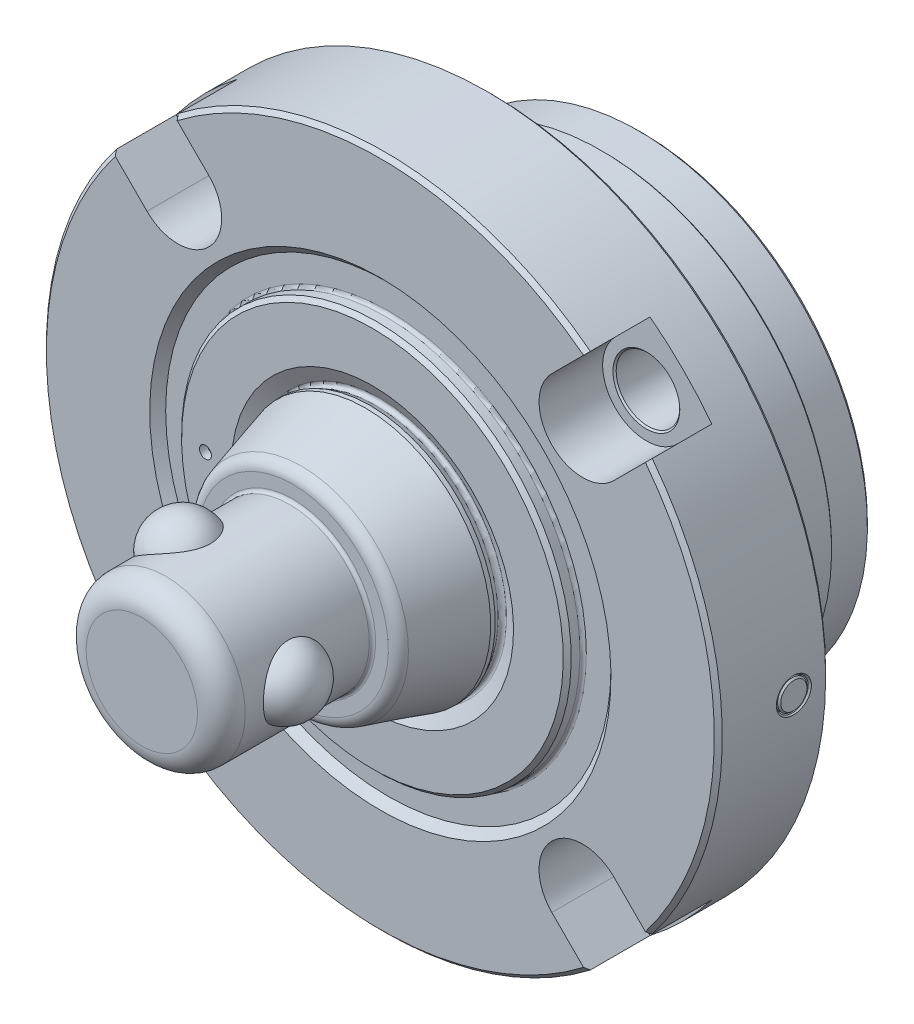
ISO-10303-21;
HEADER;
FILE_DESCRIPTION(('STEP AP214'),'2;1');
FILE_NAME('part.step','',(''),(''),'','','');
FILE_SCHEMA(('AUTOMOTIVE_DESIGN { 1 0 10303 214 1 1 1 1 }'));
ENDSEC;
DATA;
#1=APPLICATION_CONTEXT('core data for automotive mechanical design processes');
#2=APPLICATION_PROTOCOL_DEFINITION('international standard','automotive_design',2000,#1);
#3=PRODUCT_CONTEXT('',#1,'mechanical');
#4=PRODUCT('Part','Part','',(#3));
#5=PRODUCT_RELATED_PRODUCT_CATEGORY('part','',(#4));
#6=PRODUCT_DEFINITION_FORMATION('','',#4);
#7=PRODUCT_DEFINITION_CONTEXT('part definition',#1,'design');
#8=PRODUCT_DEFINITION('design','',#6,#7);
#9=PRODUCT_DEFINITION_SHAPE('','',#8);
#10=(LENGTH_UNIT() NAMED_UNIT(*) SI_UNIT(.MILLI.,.METRE.));
#11=(NAMED_UNIT(*) PLANE_ANGLE_UNIT() SI_UNIT($,.RADIAN.));
#12=(NAMED_UNIT(*) SI_UNIT($,.STERADIAN.) SOLID_ANGLE_UNIT());
#13=UNCERTAINTY_MEASURE_WITH_UNIT(LENGTH_MEASURE(1.E-05),#10,'distance_accuracy_value','');
#14=(GEOMETRIC_REPRESENTATION_CONTEXT(3) GLOBAL_UNCERTAINTY_ASSIGNED_CONTEXT((#13)) GLOBAL_UNIT_ASSIGNED_CONTEXT((#10,
#11,#12)) REPRESENTATION_CONTEXT('',''));
#15=CARTESIAN_POINT('',(0.,0.,0.));
#16=DIRECTION('',(0.,0.,1.));
#17=DIRECTION('',(1.,0.,0.));
#18=AXIS2_PLACEMENT_3D('',#15,#16,#17);
#19=CARTESIAN_POINT('',(0.,0.,46.7820366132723));
#20=DIRECTION('',(0.,0.,1.));
#21=DIRECTION('',(0.,-1.,0.));
#22=AXIS2_PLACEMENT_3D('',#19,#20,#21);
#23=CYLINDRICAL_SURFACE('',#22,28.2889257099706);
#24=CARTESIAN_POINT('',(0.,0.,-6.50181947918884));
#25=DIRECTION('',(0.,0.,-1.));
#26=DIRECTION('',(0.,1.,0.));
#27=AXIS2_PLACEMENT_3D('',#24,#25,#26);
#28=CIRCLE('',#27,28.2889257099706);
#29=CARTESIAN_POINT('',(0.,28.2889257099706,-6.50181947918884));
#30=VERTEX_POINT('',#29);
#31=EDGE_CURVE('E9',#30,#30,#28,.T.);
#32=ORIENTED_EDGE('',*,*,#31,.F.);
#33=EDGE_LOOP('',(#32));
#34=FACE_BOUND('',#33,.T.);
#35=CARTESIAN_POINT('',(0.,0.,-6.5));
#36=DIRECTION('',(0.,0.,-1.));
#37=DIRECTION('',(0.,1.,0.));
#38=AXIS2_PLACEMENT_3D('',#35,#36,#37);
#39=CIRCLE('',#38,28.2889257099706);
#40=CARTESIAN_POINT('',(0.,28.2889257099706,-6.5));
#41=VERTEX_POINT('',#40);
#42=EDGE_CURVE('E791',#41,#41,#39,.T.);
#43=ORIENTED_EDGE('',*,*,#42,.T.);
#44=EDGE_LOOP('',(#43));
#45=FACE_BOUND('',#44,.T.);
#46=ADVANCED_FACE('F15',(#34,#45),#23,.T.);
#47=CARTESIAN_POINT('',(29.,0.,-6.5));
#48=DIRECTION('',(0.,0.,-1.));
#49=DIRECTION('',(0.,1.,0.));
#50=AXIS2_PLACEMENT_3D('',#47,#48,#49);
#51=PLANE('',#50);
#52=ORIENTED_EDGE('',*,*,#42,.F.);
#53=EDGE_LOOP('',(#52));
#54=FACE_BOUND('',#53,.T.);
#55=CARTESIAN_POINT('',(0.,0.,-6.5));
#56=DIRECTION('',(0.,0.,1.));
#57=DIRECTION('',(0.,-1.,0.));
#58=AXIS2_PLACEMENT_3D('',#55,#56,#57);
#59=CIRCLE('',#58,29.);
#60=CARTESIAN_POINT('',(0.,-29.,-6.5));
#61=VERTEX_POINT('',#60);
#62=EDGE_CURVE('E665',#61,#61,#59,.T.);
#63=ORIENTED_EDGE('',*,*,#62,.F.);
#64=EDGE_LOOP('',(#63));
#65=FACE_BOUND('',#64,.T.);
#66=ADVANCED_FACE('F819',(#54,#65),#51,.T.);
#67=CARTESIAN_POINT('',(39.15,0.,0.7));
#68=DIRECTION('',(0.,-1.,0.));
#69=DIRECTION('',(-1.,0.,0.));
#70=AXIS2_PLACEMENT_3D('',#67,#68,#69);
#71=ELLIPSE('',#70,0.95,0.7);
#72=CARTESIAN_POINT('',(36.,0.,0.7));
#73=DIRECTION('',(0.,0.,-1.));
#74=AXIS1_PLACEMENT('',#72,#73);
#75=SURFACE_OF_REVOLUTION('',#71,#74);
#76=CARTESIAN_POINT('',(36.,0.,0.499999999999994));
#77=DIRECTION('',(0.,0.,-1.));
#78=DIRECTION('',(0.,1.,0.));
#79=AXIS2_PLACEMENT_3D('',#76,#77,#78);
#80=CIRCLE('',#79,4.06039910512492);
#81=CARTESIAN_POINT('',(36.,4.06039910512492,0.499999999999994));
#82=VERTEX_POINT('',#81);
#83=EDGE_CURVE('E784',#82,#82,#80,.F.);
#84=ORIENTED_EDGE('',*,*,#83,.F.);
#85=EDGE_LOOP('',(#84));
#86=FACE_BOUND('',#85,.T.);
#87=CARTESIAN_POINT('',(36.,0.,1.20054357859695));
#88=DIRECTION('',(0.,0.,-1.));
#89=DIRECTION('',(0.,1.,0.));
#90=AXIS2_PLACEMENT_3D('',#87,#88,#89);
#91=CIRCLE('',#90,2.48589226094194);
#92=CARTESIAN_POINT('',(36.,2.48589226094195,1.20054357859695));
#93=VERTEX_POINT('',#92);
#94=EDGE_CURVE('E600',#93,#93,#91,.T.);
#95=ORIENTED_EDGE('',*,*,#94,.F.);
#96=EDGE_LOOP('',(#95));
#97=FACE_BOUND('',#96,.T.);
#98=ADVANCED_FACE('F814',(#86,#97),#75,.F.);
#99=CARTESIAN_POINT('',(36.,0.,4.4));
#100=DIRECTION('',(0.,0.,1.));
#101=DIRECTION('',(0.,-1.,0.));
#102=AXIS2_PLACEMENT_3D('',#99,#100,#101);
#103=PLANE('',#102);
#104=CARTESIAN_POINT('',(36.,0.,4.4));
#105=DIRECTION('',(0.,0.,1.));
#106=DIRECTION('',(0.,-1.,0.));
#107=AXIS2_PLACEMENT_3D('',#104,#105,#106);
#108=CIRCLE('',#107,1.5);
#109=CARTESIAN_POINT('',(36.,-1.5,4.4));
#110=VERTEX_POINT('',#109);
#111=EDGE_CURVE('E362',#110,#110,#108,.T.);
#112=ORIENTED_EDGE('',*,*,#111,.F.);
#113=EDGE_LOOP('',(#112));
#114=FACE_BOUND('',#113,.T.);
#115=ADVANCED_FACE('F818',(#114),#103,.F.);
#116=CARTESIAN_POINT('',(36.,0.,1.4));
#117=DIRECTION('',(0.,0.,-1.));
#118=DIRECTION('',(0.,1.,0.));
#119=AXIS2_PLACEMENT_3D('',#116,#117,#118);
#120=CYLINDRICAL_SURFACE('',#119,1.5);
#121=CARTESIAN_POINT('',(36.,0.,1.4));
#122=DIRECTION('',(0.,0.,-1.));
#123=DIRECTION('',(0.,1.,0.));
#124=AXIS2_PLACEMENT_3D('',#121,#122,#123);
#125=CIRCLE('',#124,1.5);
#126=CARTESIAN_POINT('',(36.,1.5,1.4));
#127=VERTEX_POINT('',#126);
#128=EDGE_CURVE('E359',#127,#127,#125,.T.);
#129=ORIENTED_EDGE('',*,*,#128,.T.);
#130=EDGE_LOOP('',(#129));
#131=FACE_BOUND('',#130,.T.);
#132=ORIENTED_EDGE('',*,*,#111,.T.);
#133=EDGE_LOOP('',(#132));
#134=FACE_BOUND('',#133,.T.);
#135=ADVANCED_FACE('F1585',(#131,#134),#120,.F.);
#136=CARTESIAN_POINT('',(36.,0.,1.4));
#137=DIRECTION('',(0.,0.,-1.));
#138=DIRECTION('',(0.,1.,0.));
#139=AXIS2_PLACEMENT_3D('',#136,#137,#138);
#140=PLANE('',#139);
#141=CARTESIAN_POINT('',(36.,0.,1.4));
#142=DIRECTION('',(0.,0.,-1.));
#143=DIRECTION('',(0.,1.,0.));
#144=AXIS2_PLACEMENT_3D('',#141,#142,#143);
#145=CIRCLE('',#144,2.48589226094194);
#146=CARTESIAN_POINT('',(36.,2.48589226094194,1.4));
#147=VERTEX_POINT('',#146);
#148=EDGE_CURVE('E596',#147,#147,#145,.F.);
#149=ORIENTED_EDGE('',*,*,#148,.F.);
#150=EDGE_LOOP('',(#149));
#151=FACE_BOUND('',#150,.T.);
#152=ORIENTED_EDGE('',*,*,#128,.F.);
#153=EDGE_LOOP('',(#152));
#154=FACE_BOUND('',#153,.T.);
#155=ADVANCED_FACE('F1581',(#151,#154),#140,.T.);
#156=CARTESIAN_POINT('',(36.,0.,5.73475939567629));
#157=DIRECTION('',(0.,0.,1.));
#158=DIRECTION('',(0.,-1.,0.));
#159=AXIS2_PLACEMENT_3D('',#156,#157,#158);
#160=CYLINDRICAL_SURFACE('',#159,2.48589226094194);
#161=ORIENTED_EDGE('',*,*,#94,.T.);
#162=EDGE_LOOP('',(#161));
#163=FACE_BOUND('',#162,.T.);
#164=ORIENTED_EDGE('',*,*,#148,.T.);
#165=EDGE_LOOP('',(#164));
#166=FACE_BOUND('',#165,.T.);
#167=ADVANCED_FACE('F559',(#163,#166),#160,.F.);
#168=CARTESIAN_POINT('',(-4.26492254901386,7.38706254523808,34.6));
#169=DIRECTION('',(0.,0.,-1.));
#170=DIRECTION('',(0.5,-0.866025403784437,0.));
#171=AXIS2_PLACEMENT_3D('',#168,#169,#170);
#172=SPHERICAL_SURFACE('',#171,4.3656);
#173=CARTESIAN_POINT('',(-8.26259348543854,5.6328988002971,34.6));
#174=CARTESIAN_POINT('',(-8.26259026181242,5.63291456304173,34.8156143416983));
#175=CARTESIAN_POINT('',(-8.25195859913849,5.64859698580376,35.0315595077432));
#176=CARTESIAN_POINT('',(-8.20939840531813,5.71026410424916,35.4572169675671));
#177=CARTESIAN_POINT('',(-8.17742064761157,5.7563188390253,35.6669136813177));
#178=CARTESIAN_POINT('',(-8.09233510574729,5.87532111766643,36.0732485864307));
#179=CARTESIAN_POINT('',(-8.03929448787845,5.94818312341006,36.269925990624));
#180=CARTESIAN_POINT('',(-7.91226659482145,6.11613198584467,36.6461088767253));
#181=CARTESIAN_POINT('',(-7.83828530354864,6.21121249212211,36.8256192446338));
#182=CARTESIAN_POINT('',(-7.66639534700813,6.42227082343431,37.17055048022));
#183=CARTESIAN_POINT('',(-7.56766948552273,6.53891646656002,37.3351541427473));
#184=CARTESIAN_POINT('',(-7.34858700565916,6.78419474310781,37.6391130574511));
#185=CARTESIAN_POINT('',(-7.22822294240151,6.9128314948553,37.7784595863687));
#186=CARTESIAN_POINT('',(-6.95813849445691,7.18494485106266,38.038220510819));
#187=CARTESIAN_POINT('',(-6.80698098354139,7.32883626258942,38.156710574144));
#188=CARTESIAN_POINT('',(-6.48354992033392,7.6164569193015,38.3604217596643));
#189=CARTESIAN_POINT('',(-6.31127303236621,7.76018613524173,38.4456376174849));
#190=CARTESIAN_POINT('',(-5.94421522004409,8.0449724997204,38.5831836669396));
#191=CARTESIAN_POINT('',(-5.74897202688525,8.1858677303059,38.6346186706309));
#192=CARTESIAN_POINT('',(-5.34438586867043,8.45556882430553,38.7002079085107));
#193=CARTESIAN_POINT('',(-5.13504303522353,8.5843748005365,38.7143624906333));
#194=CARTESIAN_POINT('',(-4.70871673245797,8.82540389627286,38.7051759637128));
#195=CARTESIAN_POINT('',(-4.49176055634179,8.93767998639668,38.6819576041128));
#196=CARTESIAN_POINT('',(-4.05611211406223,9.14363282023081,38.5986387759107));
#197=CARTESIAN_POINT('',(-3.83741981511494,9.23730921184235,38.5385376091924));
#198=CARTESIAN_POINT('',(-3.40534546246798,9.40517858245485,38.3824111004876));
#199=CARTESIAN_POINT('',(-3.19196550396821,9.47936398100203,38.2863718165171));
#200=CARTESIAN_POINT('',(-2.77803928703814,9.60882720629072,38.059949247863));
#201=CARTESIAN_POINT('',(-2.57749431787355,9.66410313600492,37.9295625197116));
#202=CARTESIAN_POINT('',(-2.19631817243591,9.75781012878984,37.6362946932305));
#203=CARTESIAN_POINT('',(-2.01574537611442,9.79619273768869,37.4733220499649));
#204=CARTESIAN_POINT('',(-1.68285404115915,9.85884128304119,37.1183054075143));
#205=CARTESIAN_POINT('',(-1.5305324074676,9.8831087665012,36.9262645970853));
#206=CARTESIAN_POINT('',(-1.26571763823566,9.92045148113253,36.5239801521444));
#207=CARTESIAN_POINT('',(-1.15213561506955,9.93385053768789,36.3144859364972));
#208=CARTESIAN_POINT('',(-0.964496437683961,9.95383079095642,35.878187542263));
#209=CARTESIAN_POINT('',(-0.890415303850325,9.96041612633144,35.6513939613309));
#210=CARTESIAN_POINT('',(-0.789980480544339,9.96886593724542,35.2049743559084));
#211=CARTESIAN_POINT('',(-0.760508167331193,9.97104292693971,34.9860544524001));
#212=CARTESIAN_POINT('',(-0.740815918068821,9.97252811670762,34.5464728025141));
#213=CARTESIAN_POINT('',(-0.750583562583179,9.97183722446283,34.325811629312));
#214=CARTESIAN_POINT('',(-0.807311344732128,9.96739475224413,33.9007641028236));
#215=CARTESIAN_POINT('',(-0.852371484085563,9.96379924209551,33.6961181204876));
#216=CARTESIAN_POINT('',(-0.975136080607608,9.95253114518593,33.2970176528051));
#217=CARTESIAN_POINT('',(-1.05284331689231,9.94485821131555,33.1025640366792));
#218=CARTESIAN_POINT('',(-1.23980861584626,9.92330099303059,32.7236962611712));
#219=CARTESIAN_POINT('',(-1.34981968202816,9.90926352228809,32.5396638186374));
#220=CARTESIAN_POINT('',(-1.59599788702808,9.87260087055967,32.1909920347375));
#221=CARTESIAN_POINT('',(-1.73217274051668,9.84997315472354,32.0263584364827));
#222=CARTESIAN_POINT('',(-2.0363150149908,9.79178357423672,31.7083212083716));
#223=CARTESIAN_POINT('',(-2.2058655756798,9.75540774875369,31.5565796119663));
#224=CARTESIAN_POINT('',(-2.56306016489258,9.6677059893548,31.2813261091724));
#225=CARTESIAN_POINT('',(-2.75070938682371,9.61637575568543,31.1578223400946));
#226=CARTESIAN_POINT('',(-3.14852341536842,9.49380924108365,30.9349647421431));
#227=CARTESIAN_POINT('',(-3.35935943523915,9.42162953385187,30.8373230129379));
#228=CARTESIAN_POINT('',(-3.78688310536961,9.25807114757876,30.6772377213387));
#229=CARTESIAN_POINT('',(-4.00357120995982,9.16669097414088,30.6147969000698));
#230=CARTESIAN_POINT('',(-4.4383803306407,8.96431734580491,30.5255832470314));
#231=CARTESIAN_POINT('',(-4.65648747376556,8.85310231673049,30.4992460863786));
#232=CARTESIAN_POINT('',(-5.08495028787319,8.6141353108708,30.4841219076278));
#233=CARTESIAN_POINT('',(-5.29530605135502,8.48638353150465,30.4953344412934));
#234=CARTESIAN_POINT('',(-5.59990886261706,8.28588331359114,30.5400267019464));
#235=CARTESIAN_POINT('',(-5.69944945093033,8.2177037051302,30.5595088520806));
#236=CARTESIAN_POINT('',(-5.89452823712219,8.0789119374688,30.6076232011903));
#237=CARTESIAN_POINT('',(-5.99006788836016,8.00830067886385,30.636252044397));
#238=CARTESIAN_POINT('',(-6.17662941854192,7.86530876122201,30.7025588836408));
#239=CARTESIAN_POINT('',(-6.26764940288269,7.79292737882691,30.7402406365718));
#240=CARTESIAN_POINT('',(-6.44462676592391,7.64721622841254,30.8244765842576));
#241=CARTESIAN_POINT('',(-6.5305859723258,7.57388681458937,30.8710275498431));
#242=CARTESIAN_POINT('',(-6.69740711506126,7.42678647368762,30.9730268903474));
#243=CARTESIAN_POINT('',(-6.77824678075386,7.35301496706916,31.0285108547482));
#244=CARTESIAN_POINT('',(-6.93407208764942,7.20625394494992,31.1479817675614));
#245=CARTESIAN_POINT('',(-7.00905991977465,7.13326414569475,31.211965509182));
#246=CARTESIAN_POINT('',(-7.15296867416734,6.98895048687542,31.3482020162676));
#247=CARTESIAN_POINT('',(-7.22188703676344,6.91762733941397,31.420458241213));
#248=CARTESIAN_POINT('',(-7.35337724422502,6.7776883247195,31.5728574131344));
#249=CARTESIAN_POINT('',(-7.41595164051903,6.70907137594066,31.6529971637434));
#250=CARTESIAN_POINT('',(-7.53439750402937,6.5757718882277,31.8204837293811));
#251=CARTESIAN_POINT('',(-7.59029317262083,6.51107559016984,31.9078024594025));
#252=CARTESIAN_POINT('',(-7.69550798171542,6.38637699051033,32.0894087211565));
#253=CARTESIAN_POINT('',(-7.74482998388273,6.32637265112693,32.1836931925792));
#254=CARTESIAN_POINT('',(-7.83687293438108,6.21198984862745,32.3787945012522));
#255=CARTESIAN_POINT('',(-7.87958899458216,6.15761556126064,32.4796160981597));
#256=CARTESIAN_POINT('',(-7.95829668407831,6.05554853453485,32.687038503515));
#257=CARTESIAN_POINT('',(-7.99429162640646,6.00785250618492,32.7936364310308));
#258=CARTESIAN_POINT('',(-8.05800064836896,5.92210638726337,33.0067468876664));
#259=CARTESIAN_POINT('',(-8.08602527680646,5.88370739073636,33.1130262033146));
#260=CARTESIAN_POINT('',(-8.13591978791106,5.81451889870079,33.3293846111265));
#261=CARTESIAN_POINT('',(-8.15779274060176,5.78372560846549,33.4394617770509));
#262=CARTESIAN_POINT('',(-8.19534218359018,5.73039520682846,33.6623576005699));
#263=CARTESIAN_POINT('',(-8.21103278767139,5.70783929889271,33.7751693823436));
#264=CARTESIAN_POINT('',(-8.23627173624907,5.67135987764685,34.002801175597));
#265=CARTESIAN_POINT('',(-8.24582405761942,5.65743077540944,34.1176198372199));
#266=CARTESIAN_POINT('',(-8.25573687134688,5.64294627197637,34.2939288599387));
#267=CARTESIAN_POINT('',(-8.25830766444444,5.63918184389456,34.3550522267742));
#268=CARTESIAN_POINT('',(-8.26173644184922,5.63415584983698,34.4774414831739));
#269=CARTESIAN_POINT('',(-8.26259440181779,5.63289431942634,34.5387073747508));
#270=CARTESIAN_POINT('',(-8.26259348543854,5.6328988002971,34.6));
#271=B_SPLINE_CURVE_WITH_KNOTS('',3,(#173,#174,#175,#176,#177,#178,#179,#180,#181,#182,#183,
#184,#185,#186,#187,#188,#189,#190,#191,#192,#193,#194,#195,#196,#197,#198,#199,#200,#201,#202,
#203,#204,#205,#206,#207,#208,#209,#210,#211,#212,#213,#214,#215,#216,#217,#218,#219,#220,#221,
#222,#223,#224,#225,#226,#227,#228,#229,#230,#231,#232,#233,#234,#235,#236,#237,#238,#239,#240,
#241,#242,#243,#244,#245,#246,#247,#248,#249,#250,#251,#252,#253,#254,#255,#256,#257,#258,#259,
#260,#261,#262,#263,#264,#265,#266,#267,#268,#269,#270),.UNSPECIFIED.,.T.,.F.,(4,2,2,2,2,2,2,2,
2,2,2,2,2,2,2,2,2,2,2,2,2,2,2,2,2,2,2,2,2,2,2,2,2,2,2,2,2,2,2,2,2,2,2,2,2,2,2,2,4),(0.,
0.646605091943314,1.29470650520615,1.94075760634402,2.58662428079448,3.25755727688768,
3.92872155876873,4.64539397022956,5.36217972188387,6.09726645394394,6.83234632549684,
7.56501678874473,8.29770112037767,9.03066998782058,9.76371236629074,10.4988438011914,
11.2338946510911,11.9461447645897,12.6579620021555,13.3172506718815,13.9763306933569,
14.6021812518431,15.2280850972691,15.8699265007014,16.5119574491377,17.2002149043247,
17.8886704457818,18.6151779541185,19.3417420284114,20.0769987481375,20.8122466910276,
21.1785352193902,21.5446895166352,21.9109960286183,22.2771694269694,22.6448395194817,
23.0123712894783,23.3800573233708,23.7475948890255,24.1137574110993,24.4797600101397,
24.8460321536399,25.2121232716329,25.5609436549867,25.9095896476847,26.2574350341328,
26.6050548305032,26.7888624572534,26.9726726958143),.UNSPECIFIED.);
#272=CARTESIAN_POINT('',(-8.26259348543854,5.6328988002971,34.6));
#273=VERTEX_POINT('',#272);
#274=EDGE_CURVE('E544',#273,#273,#271,.T.);
#275=ORIENTED_EDGE('',*,*,#274,.T.);
#276=EDGE_LOOP('',(#275));
#277=FACE_BOUND('',#276,.T.);
#278=ADVANCED_FACE('F554',(#277),#172,.T.);
#279=CARTESIAN_POINT('',(-4.26492254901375,-7.38706254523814,34.6));
#280=DIRECTION('',(0.,0.,-1.));
#281=DIRECTION('',(0.499999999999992,0.866025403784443,0.));
#282=AXIS2_PLACEMENT_3D('',#279,#280,#281);
#283=SPHERICAL_SURFACE('',#282,4.3656);
#284=CARTESIAN_POINT('',(-8.26259348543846,-5.63289880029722,34.6));
#285=CARTESIAN_POINT('',(-8.26259026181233,-5.63291456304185,34.3843856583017));
#286=CARTESIAN_POINT('',(-8.25195859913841,-5.64859698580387,34.1684404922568));
#287=CARTESIAN_POINT('',(-8.20939840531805,-5.71026410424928,33.7427830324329));
#288=CARTESIAN_POINT('',(-8.17742064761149,-5.75631883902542,33.5330863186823));
#289=CARTESIAN_POINT('',(-8.09233510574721,-5.87532111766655,33.1267514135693));
#290=CARTESIAN_POINT('',(-8.03929448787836,-5.94818312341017,32.930074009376));
#291=CARTESIAN_POINT('',(-7.91226659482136,-6.11613198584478,32.5538911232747));
#292=CARTESIAN_POINT('',(-7.83828530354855,-6.21121249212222,32.3743807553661));
#293=CARTESIAN_POINT('',(-7.66639534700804,-6.42227082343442,32.02944951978));
#294=CARTESIAN_POINT('',(-7.56766948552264,-6.53891646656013,31.8648458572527));
#295=CARTESIAN_POINT('',(-7.34858700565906,-6.78419474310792,31.5608869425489));
#296=CARTESIAN_POINT('',(-7.22822294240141,-6.9128314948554,31.4215404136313));
#297=CARTESIAN_POINT('',(-6.95813849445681,-7.18494485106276,31.161779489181));
#298=CARTESIAN_POINT('',(-6.80698098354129,-7.32883626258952,31.043289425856));
#299=CARTESIAN_POINT('',(-6.48354992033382,-7.61645691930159,30.8395782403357));
#300=CARTESIAN_POINT('',(-6.3112730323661,-7.76018613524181,30.7543623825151));
#301=CARTESIAN_POINT('',(-5.94421522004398,-8.04497249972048,30.6168163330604));
#302=CARTESIAN_POINT('',(-5.74897202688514,-8.18586773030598,30.5653813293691));
#303=CARTESIAN_POINT('',(-5.34438586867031,-8.45556882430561,30.4997920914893));
#304=CARTESIAN_POINT('',(-5.13504303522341,-8.58437480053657,30.4856375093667));
#305=CARTESIAN_POINT('',(-4.70871673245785,-8.82540389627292,30.4948240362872));
#306=CARTESIAN_POINT('',(-4.49176055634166,-8.93767998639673,30.5180423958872));
#307=CARTESIAN_POINT('',(-4.0561121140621,-9.14363282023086,30.6013612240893));
#308=CARTESIAN_POINT('',(-3.83741981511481,-9.23730921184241,30.6614623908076));
#309=CARTESIAN_POINT('',(-3.40534546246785,-9.40517858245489,30.8175888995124));
#310=CARTESIAN_POINT('',(-3.19196550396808,-9.47936398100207,30.9136281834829));
#311=CARTESIAN_POINT('',(-2.778039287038,-9.60882720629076,31.140050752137));
#312=CARTESIAN_POINT('',(-2.57749431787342,-9.66410313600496,31.2704374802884));
#313=CARTESIAN_POINT('',(-2.19631817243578,-9.75781012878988,31.5637053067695));
#314=CARTESIAN_POINT('',(-2.01574537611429,-9.79619273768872,31.726677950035));
#315=CARTESIAN_POINT('',(-1.68285404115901,-9.85884128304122,32.0816945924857));
#316=CARTESIAN_POINT('',(-1.53053240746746,-9.88310876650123,32.2737354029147));
#317=CARTESIAN_POINT('',(-1.26571763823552,-9.92045148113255,32.6760198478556));
#318=CARTESIAN_POINT('',(-1.15213561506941,-9.9338505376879,32.8855140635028));
#319=CARTESIAN_POINT('',(-0.964496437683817,-9.95383079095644,33.321812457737));
#320=CARTESIAN_POINT('',(-0.890415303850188,-9.96041612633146,33.5486060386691));
#321=CARTESIAN_POINT('',(-0.789980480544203,-9.96886593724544,33.9950256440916));
#322=CARTESIAN_POINT('',(-0.760508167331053,-9.97104292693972,34.2139455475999));
#323=CARTESIAN_POINT('',(-0.740815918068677,-9.97252811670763,34.6535271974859));
#324=CARTESIAN_POINT('',(-0.750583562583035,-9.97183722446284,34.8741883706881));
#325=CARTESIAN_POINT('',(-0.807311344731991,-9.96739475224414,35.2992358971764));
#326=CARTESIAN_POINT('',(-0.852371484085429,-9.96379924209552,35.5038818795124));
#327=CARTESIAN_POINT('',(-0.975136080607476,-9.95253114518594,35.9029823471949));
#328=CARTESIAN_POINT('',(-1.05284331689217,-9.94485821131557,36.0974359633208));
#329=CARTESIAN_POINT('',(-1.23980861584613,-9.92330099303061,36.4763037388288));
#330=CARTESIAN_POINT('',(-1.34981968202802,-9.9092635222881,36.6603361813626));
#331=CARTESIAN_POINT('',(-1.59599788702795,-9.87260087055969,37.0090079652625));
#332=CARTESIAN_POINT('',(-1.73217274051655,-9.84997315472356,37.1736415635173));
#333=CARTESIAN_POINT('',(-2.03631501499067,-9.79178357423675,37.4916787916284));
#334=CARTESIAN_POINT('',(-2.20586557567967,-9.75540774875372,37.6434203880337));
#335=CARTESIAN_POINT('',(-2.56306016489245,-9.66770598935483,37.9186738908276));
#336=CARTESIAN_POINT('',(-2.75070938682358,-9.61637575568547,38.0421776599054));
#337=CARTESIAN_POINT('',(-3.14852341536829,-9.49380924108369,38.2650352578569));
#338=CARTESIAN_POINT('',(-3.35935943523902,-9.42162953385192,38.3626769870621));
#339=CARTESIAN_POINT('',(-3.78688310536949,-9.25807114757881,38.5227622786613));
#340=CARTESIAN_POINT('',(-4.0035712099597,-9.16669097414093,38.5852030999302));
#341=CARTESIAN_POINT('',(-4.43838033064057,-8.96431734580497,38.6744167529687));
#342=CARTESIAN_POINT('',(-4.65648747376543,-8.85310231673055,38.7007539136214));
#343=CARTESIAN_POINT('',(-5.08495028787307,-8.61413531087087,38.7158780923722));
#344=CARTESIAN_POINT('',(-5.29530605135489,-8.48638353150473,38.7046655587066));
#345=CARTESIAN_POINT('',(-5.59990886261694,-8.28588331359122,38.6599732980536));
#346=CARTESIAN_POINT('',(-5.69944945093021,-8.21770370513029,38.6404911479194));
#347=CARTESIAN_POINT('',(-5.89452823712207,-8.07891193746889,38.5923767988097));
#348=CARTESIAN_POINT('',(-5.99006788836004,-8.00830067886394,38.5637479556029));
#349=CARTESIAN_POINT('',(-6.1766294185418,-7.8653087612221,38.4974411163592));
#350=CARTESIAN_POINT('',(-6.26764940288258,-7.792927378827,38.4597593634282));
#351=CARTESIAN_POINT('',(-6.44462676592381,-7.64721622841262,38.3755234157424));
#352=CARTESIAN_POINT('',(-6.5305859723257,-7.57388681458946,38.3289724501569));
#353=CARTESIAN_POINT('',(-6.69740711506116,-7.42678647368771,38.2269731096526));
#354=CARTESIAN_POINT('',(-6.77824678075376,-7.35301496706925,38.1714891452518));
#355=CARTESIAN_POINT('',(-6.93407208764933,-7.20625394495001,38.0520182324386));
#356=CARTESIAN_POINT('',(-7.00905991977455,-7.13326414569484,37.988034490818));
#357=CARTESIAN_POINT('',(-7.15296867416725,-6.98895048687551,37.8517979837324));
#358=CARTESIAN_POINT('',(-7.22188703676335,-6.91762733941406,37.779541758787));
#359=CARTESIAN_POINT('',(-7.35337724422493,-6.77768832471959,37.6271425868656));
#360=CARTESIAN_POINT('',(-7.41595164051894,-6.70907137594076,37.5470028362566));
#361=CARTESIAN_POINT('',(-7.53439750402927,-6.57577188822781,37.3795162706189));
#362=CARTESIAN_POINT('',(-7.59029317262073,-6.51107559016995,37.2921975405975));
#363=CARTESIAN_POINT('',(-7.69550798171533,-6.38637699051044,37.1105912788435));
#364=CARTESIAN_POINT('',(-7.74482998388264,-6.32637265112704,37.0163068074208));
#365=CARTESIAN_POINT('',(-7.83687293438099,-6.21198984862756,36.8212054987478));
#366=CARTESIAN_POINT('',(-7.87958899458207,-6.15761556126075,36.7203839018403));
#367=CARTESIAN_POINT('',(-7.95829668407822,-6.05554853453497,36.512961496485));
#368=CARTESIAN_POINT('',(-7.99429162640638,-6.00785250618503,36.4063635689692));
#369=CARTESIAN_POINT('',(-8.05800064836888,-5.92210638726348,36.1932531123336));
#370=CARTESIAN_POINT('',(-8.08602527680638,-5.88370739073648,36.0869737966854));
#371=CARTESIAN_POINT('',(-8.13591978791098,-5.8145188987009,35.8706153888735));
#372=CARTESIAN_POINT('',(-8.15779274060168,-5.7837256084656,35.7605382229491));
#373=CARTESIAN_POINT('',(-8.1953421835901,-5.73039520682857,35.53764239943));
#374=CARTESIAN_POINT('',(-8.21103278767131,-5.70783929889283,35.4248306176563));
#375=CARTESIAN_POINT('',(-8.23627173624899,-5.67135987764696,35.197198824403));
#376=CARTESIAN_POINT('',(-8.24582405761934,-5.65743077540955,35.0823801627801));
#377=CARTESIAN_POINT('',(-8.2557368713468,-5.64294627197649,34.9060711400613));
#378=CARTESIAN_POINT('',(-8.25830766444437,-5.63918184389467,34.8449477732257));
#379=CARTESIAN_POINT('',(-8.26173644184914,-5.6341558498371,34.7225585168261));
#380=CARTESIAN_POINT('',(-8.26259440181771,-5.63289431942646,34.6612926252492));
#381=CARTESIAN_POINT('',(-8.26259348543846,-5.63289880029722,34.6));
#382=B_SPLINE_CURVE_WITH_KNOTS('',3,(#284,#285,#286,#287,#288,#289,#290,#291,#292,#293,#294,
#295,#296,#297,#298,#299,#300,#301,#302,#303,#304,#305,#306,#307,#308,#309,#310,#311,#312,#313,
#314,#315,#316,#317,#318,#319,#320,#321,#322,#323,#324,#325,#326,#327,#328,#329,#330,#331,#332,
#333,#334,#335,#336,#337,#338,#339,#340,#341,#342,#343,#344,#345,#346,#347,#348,#349,#350,#351,
#352,#353,#354,#355,#356,#357,#358,#359,#360,#361,#362,#363,#364,#365,#366,#367,#368,#369,#370,
#371,#372,#373,#374,#375,#376,#377,#378,#379,#380,#381),.UNSPECIFIED.,.T.,.F.,(4,2,2,2,2,2,2,2,
2,2,2,2,2,2,2,2,2,2,2,2,2,2,2,2,2,2,2,2,2,2,2,2,2,2,2,2,2,2,2,2,2,2,2,2,2,2,2,2,4),(0.,
0.646605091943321,1.29470650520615,1.94075760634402,2.58662428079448,3.25755727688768,
3.92872155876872,4.64539397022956,5.36217972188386,6.09726645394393,6.83234632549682,
7.56501678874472,8.29770112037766,9.03066998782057,9.76371236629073,10.4988438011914,
11.2338946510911,11.9461447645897,12.6579620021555,13.3172506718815,13.9763306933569,
14.6021812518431,15.2280850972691,15.8699265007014,16.5119574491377,17.2002149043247,
17.8886704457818,18.6151779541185,19.3417420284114,20.0769987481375,20.8122466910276,
21.1785352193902,21.5446895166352,21.9109960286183,22.2771694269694,22.6448395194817,
23.0123712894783,23.3800573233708,23.7475948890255,24.1137574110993,24.4797600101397,
24.8460321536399,25.2121232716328,25.5609436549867,25.9095896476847,26.2574350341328,
26.6050548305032,26.7888624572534,26.9726726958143),.UNSPECIFIED.);
#383=CARTESIAN_POINT('',(-8.26259348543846,-5.63289880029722,34.6));
#384=VERTEX_POINT('',#383);
#385=EDGE_CURVE('E536',#384,#384,#382,.T.);
#386=ORIENTED_EDGE('',*,*,#385,.T.);
#387=EDGE_LOOP('',(#386));
#388=FACE_BOUND('',#387,.T.);
#389=ADVANCED_FACE('F558',(#388),#283,.T.);
#390=CARTESIAN_POINT('',(33.514107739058,0.,0.499999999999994));
#391=DIRECTION('',(0.,0.,-1.));
#392=DIRECTION('',(0.,1.,0.));
#393=AXIS2_PLACEMENT_3D('',#390,#391,#392);
#394=PLANE('',#393);
#395=ORIENTED_EDGE('',*,*,#83,.T.);
#396=EDGE_LOOP('',(#395));
#397=FACE_BOUND('',#396,.T.);
#398=CARTESIAN_POINT('',(36.,0.,0.499999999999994));
#399=DIRECTION('',(0.,0.,1.));
#400=DIRECTION('',(0.,-1.,0.));
#401=AXIS2_PLACEMENT_3D('',#398,#399,#400);
#402=CIRCLE('',#401,4.1);
#403=CARTESIAN_POINT('',(36.,-4.1,0.499999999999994));
#404=VERTEX_POINT('',#403);
#405=EDGE_CURVE('E358',#404,#404,#402,.T.);
#406=ORIENTED_EDGE('',*,*,#405,.F.);
#407=EDGE_LOOP('',(#406));
#408=FACE_BOUND('',#407,.T.);
#409=ADVANCED_FACE('F566',(#397,#408),#394,.T.);
#410=CARTESIAN_POINT('',(41.5,0.,4.5));
#411=DIRECTION('',(1.,0.,0.));
#412=DIRECTION('',(0.,1.,0.));
#413=AXIS2_PLACEMENT_3D('',#410,#411,#412);
#414=PLANE('',#413);
#415=CARTESIAN_POINT('',(41.5,0.,4.5));
#416=DIRECTION('',(1.,0.,0.));
#417=DIRECTION('',(0.,1.,0.));
#418=AXIS2_PLACEMENT_3D('',#415,#416,#417);
#419=CIRCLE('',#418,1.85);
#420=CARTESIAN_POINT('',(41.5,1.85,4.5));
#421=VERTEX_POINT('',#420);
#422=EDGE_CURVE('E344',#421,#421,#419,.F.);
#423=ORIENTED_EDGE('',*,*,#422,.T.);
#424=EDGE_LOOP('',(#423));
#425=FACE_BOUND('',#424,.T.);
#426=CARTESIAN_POINT('',(41.5,0.,4.5));
#427=DIRECTION('',(1.,0.,0.));
#428=DIRECTION('',(0.,1.,0.));
#429=AXIS2_PLACEMENT_3D('',#426,#427,#428);
#430=CIRCLE('',#429,2.);
#431=CARTESIAN_POINT('',(41.5,2.,4.5));
#432=VERTEX_POINT('',#431);
#433=EDGE_CURVE('E340',#432,#432,#430,.T.);
#434=ORIENTED_EDGE('',*,*,#433,.T.);
#435=EDGE_LOOP('',(#434));
#436=FACE_BOUND('',#435,.T.);
#437=ADVANCED_FACE('F1577',(#425,#436),#414,.T.);
#438=CARTESIAN_POINT('',(-21.,0.,14.));
#439=DIRECTION('',(0.,0.,-1.));
#440=DIRECTION('',(0.,1.,0.));
#441=AXIS2_PLACEMENT_3D('',#438,#439,#440);
#442=PLANE('',#441);
#443=CARTESIAN_POINT('',(-21.,0.,14.));
#444=DIRECTION('',(0.,0.,-1.));
#445=DIRECTION('',(0.,1.,0.));
#446=AXIS2_PLACEMENT_3D('',#443,#444,#445);
#447=CIRCLE('',#446,0.75);
#448=CARTESIAN_POINT('',(-21.,0.749999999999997,14.));
#449=VERTEX_POINT('',#448);
#450=EDGE_CURVE('E343',#449,#449,#447,.F.);
#451=ORIENTED_EDGE('',*,*,#450,.T.);
#452=EDGE_LOOP('',(#451));
#453=FACE_BOUND('',#452,.T.);
#454=ADVANCED_FACE('F1589',(#453),#442,.F.);
#455=CARTESIAN_POINT('',(-40.1,0.,0.499999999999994));
#456=DIRECTION('',(0.,0.,-1.));
#457=DIRECTION('',(0.,1.,0.));
#458=AXIS2_PLACEMENT_3D('',#455,#456,#457);
#459=PLANE('',#458);
#460=CARTESIAN_POINT('',(-36.,-2.52458911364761E-13,0.499999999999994));
#461=DIRECTION('',(0.,0.,-1.));
#462=DIRECTION('',(0.,1.,0.));
#463=AXIS2_PLACEMENT_3D('',#460,#461,#462);
#464=CIRCLE('',#463,4.06039910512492);
#465=CARTESIAN_POINT('',(-36.,4.06039910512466,0.499999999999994));
#466=VERTEX_POINT('',#465);
#467=EDGE_CURVE('E583',#466,#466,#464,.F.);
#468=ORIENTED_EDGE('',*,*,#467,.T.);
#469=EDGE_LOOP('',(#468));
#470=FACE_BOUND('',#469,.T.);
#471=CARTESIAN_POINT('',(-36.,0.,0.499999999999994));
#472=DIRECTION('',(0.,0.,1.));
#473=DIRECTION('',(0.,-1.,0.));
#474=AXIS2_PLACEMENT_3D('',#471,#472,#473);
#475=CIRCLE('',#474,4.1);
#476=CARTESIAN_POINT('',(-36.,-4.1,0.499999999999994));
#477=VERTEX_POINT('',#476);
#478=EDGE_CURVE('E367',#477,#477,#475,.T.);
#479=ORIENTED_EDGE('',*,*,#478,.F.);
#480=EDGE_LOOP('',(#479));
#481=FACE_BOUND('',#480,.T.);
#482=ADVANCED_FACE('F1592',(#470,#481),#459,.T.);
#483=CARTESIAN_POINT('',(-41.5,0.,9.5));
#484=DIRECTION('',(-1.,0.,0.));
#485=DIRECTION('',(0.,-1.,0.));
#486=AXIS2_PLACEMENT_3D('',#483,#484,#485);
#487=PLANE('',#486);
#488=CARTESIAN_POINT('',(-41.5,0.,9.5));
#489=DIRECTION('',(-1.,0.,0.));
#490=DIRECTION('',(0.,-1.,0.));
#491=AXIS2_PLACEMENT_3D('',#488,#489,#490);
#492=CIRCLE('',#491,1.85);
#493=CARTESIAN_POINT('',(-41.5,-1.85,9.5));
#494=VERTEX_POINT('',#493);
#495=EDGE_CURVE('E352',#494,#494,#492,.F.);
#496=ORIENTED_EDGE('',*,*,#495,.T.);
#497=EDGE_LOOP('',(#496));
#498=FACE_BOUND('',#497,.T.);
#499=CARTESIAN_POINT('',(-41.5,0.,9.5));
#500=DIRECTION('',(-1.,0.,0.));
#501=DIRECTION('',(0.,-1.,0.));
#502=AXIS2_PLACEMENT_3D('',#499,#500,#501);
#503=CIRCLE('',#502,2.);
#504=CARTESIAN_POINT('',(-41.5,-2.,9.5));
#505=VERTEX_POINT('',#504);
#506=EDGE_CURVE('E348',#505,#505,#503,.T.);
#507=ORIENTED_EDGE('',*,*,#506,.T.);
#508=EDGE_LOOP('',(#507));
#509=FACE_BOUND('',#508,.T.);
#510=ADVANCED_FACE('F1597',(#498,#509),#487,.T.);
#511=CARTESIAN_POINT('',(-25.4558441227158,25.4558441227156,-4.));
#512=DIRECTION('',(0.,0.,1.));
#513=DIRECTION('',(0.,-1.,0.));
#514=AXIS2_PLACEMENT_3D('',#511,#512,#513);
#515=CYLINDRICAL_SURFACE('',#514,4.);
#516=CARTESIAN_POINT('',(-25.4558441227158,25.4558441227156,5.8));
#517=DIRECTION('',(0.,0.,1.));
#518=DIRECTION('',(0.,-1.,0.));
#519=AXIS2_PLACEMENT_3D('',#516,#517,#518);
#520=CIRCLE('',#519,4.);
#521=CARTESIAN_POINT('',(-25.4558441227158,21.4558441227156,5.8));
#522=VERTEX_POINT('',#521);
#523=EDGE_CURVE('E351',#522,#522,#520,.T.);
#524=ORIENTED_EDGE('',*,*,#523,.T.);
#525=EDGE_LOOP('',(#524));
#526=FACE_BOUND('',#525,.T.);
#527=CARTESIAN_POINT('',(-25.4558441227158,25.4558441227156,0.2));
#528=DIRECTION('',(0.,0.,-1.));
#529=DIRECTION('',(0.,1.,0.));
#530=AXIS2_PLACEMENT_3D('',#527,#528,#529);
#531=CIRCLE('',#530,4.);
#532=CARTESIAN_POINT('',(-25.4558441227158,29.4558441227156,0.2));
#533=VERTEX_POINT('',#532);
#534=EDGE_CURVE('E289',#533,#533,#531,.F.);
#535=ORIENTED_EDGE('',*,*,#534,.F.);
#536=EDGE_LOOP('',(#535));
#537=FACE_BOUND('',#536,.T.);
#538=ADVANCED_FACE('F1601',(#526,#537),#515,.F.);
#539=CARTESIAN_POINT('',(25.4558441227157,25.4558441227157,-4.));
#540=DIRECTION('',(0.,0.,1.));
#541=DIRECTION('',(0.,-1.,0.));
#542=AXIS2_PLACEMENT_3D('',#539,#540,#541);
#543=CYLINDRICAL_SURFACE('',#542,4.);
#544=CARTESIAN_POINT('',(25.4558441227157,25.4558441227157,5.8));
#545=DIRECTION('',(0.,0.,1.));
#546=DIRECTION('',(0.,-1.,0.));
#547=AXIS2_PLACEMENT_3D('',#544,#545,#546);
#548=CIRCLE('',#547,4.);
#549=CARTESIAN_POINT('',(25.4558441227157,21.4558441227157,5.8));
#550=VERTEX_POINT('',#549);
#551=EDGE_CURVE('E608',#550,#550,#548,.T.);
#552=ORIENTED_EDGE('',*,*,#551,.T.);
#553=EDGE_LOOP('',(#552));
#554=FACE_BOUND('',#553,.T.);
#555=CARTESIAN_POINT('',(25.4558441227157,25.4558441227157,0.2));
#556=DIRECTION('',(0.,0.,-1.));
#557=DIRECTION('',(0.,1.,0.));
#558=AXIS2_PLACEMENT_3D('',#555,#556,#557);
#559=CIRCLE('',#558,4.);
#560=CARTESIAN_POINT('',(25.4558441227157,29.4558441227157,0.2));
#561=VERTEX_POINT('',#560);
#562=EDGE_CURVE('E238',#561,#561,#559,.F.);
#563=ORIENTED_EDGE('',*,*,#562,.F.);
#564=EDGE_LOOP('',(#563));
#565=FACE_BOUND('',#564,.T.);
#566=ADVANCED_FACE('F1605',(#554,#565),#543,.F.);
#567=CARTESIAN_POINT('',(25.4558441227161,-25.4558441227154,-4.));
#568=DIRECTION('',(0.,0.,1.));
#569=DIRECTION('',(0.,-1.,0.));
#570=AXIS2_PLACEMENT_3D('',#567,#568,#569);
#571=CYLINDRICAL_SURFACE('',#570,4.);
#572=CARTESIAN_POINT('',(25.4558441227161,-25.4558441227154,5.8));
#573=DIRECTION('',(0.,0.,1.));
#574=DIRECTION('',(0.,-1.,0.));
#575=AXIS2_PLACEMENT_3D('',#572,#573,#574);
#576=CIRCLE('',#575,4.);
#577=CARTESIAN_POINT('',(25.4558441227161,-29.4558441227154,5.8));
#578=VERTEX_POINT('',#577);
#579=EDGE_CURVE('E611',#578,#578,#576,.T.);
#580=ORIENTED_EDGE('',*,*,#579,.T.);
#581=EDGE_LOOP('',(#580));
#582=FACE_BOUND('',#581,.T.);
#583=CARTESIAN_POINT('',(25.4558441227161,-25.4558441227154,0.199999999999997));
#584=DIRECTION('',(0.,0.,-1.));
#585=DIRECTION('',(0.,1.,0.));
#586=AXIS2_PLACEMENT_3D('',#583,#584,#585);
#587=CIRCLE('',#586,4.);
#588=CARTESIAN_POINT('',(25.4558441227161,-21.4558441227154,0.199999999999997));
#589=VERTEX_POINT('',#588);
#590=EDGE_CURVE('E334',#589,#589,#587,.F.);
#591=ORIENTED_EDGE('',*,*,#590,.F.);
#592=EDGE_LOOP('',(#591));
#593=FACE_BOUND('',#592,.T.);
#594=ADVANCED_FACE('F1609',(#582,#593),#571,.F.);
#595=CARTESIAN_POINT('',(-25.4558441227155,-25.455844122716,-4.));
#596=DIRECTION('',(0.,0.,1.));
#597=DIRECTION('',(0.,-1.,0.));
#598=AXIS2_PLACEMENT_3D('',#595,#596,#597);
#599=CYLINDRICAL_SURFACE('',#598,4.);
#600=CARTESIAN_POINT('',(-25.4558441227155,-25.455844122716,5.8));
#601=DIRECTION('',(0.,0.,1.));
#602=DIRECTION('',(0.,-1.,0.));
#603=AXIS2_PLACEMENT_3D('',#600,#601,#602);
#604=CIRCLE('',#603,4.);
#605=CARTESIAN_POINT('',(-25.4558441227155,-29.455844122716,5.8));
#606=VERTEX_POINT('',#605);
#607=EDGE_CURVE('E614',#606,#606,#604,.T.);
#608=ORIENTED_EDGE('',*,*,#607,.T.);
#609=EDGE_LOOP('',(#608));
#610=FACE_BOUND('',#609,.T.);
#611=CARTESIAN_POINT('',(-25.4558441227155,-25.455844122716,0.199999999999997));
#612=DIRECTION('',(0.,0.,-1.));
#613=DIRECTION('',(0.,1.,0.));
#614=AXIS2_PLACEMENT_3D('',#611,#612,#613);
#615=CIRCLE('',#614,4.);
#616=CARTESIAN_POINT('',(-25.4558441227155,-21.455844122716,0.199999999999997));
#617=VERTEX_POINT('',#616);
#618=EDGE_CURVE('E312',#617,#617,#615,.F.);
#619=ORIENTED_EDGE('',*,*,#618,.F.);
#620=EDGE_LOOP('',(#619));
#621=FACE_BOUND('',#620,.T.);
#622=ADVANCED_FACE('F1613',(#610,#621),#599,.F.);
#623=CARTESIAN_POINT('',(0.,0.,0.));
#624=DIRECTION('',(0.,0.,-1.));
#625=DIRECTION('',(0.,1.,0.));
#626=AXIS2_PLACEMENT_3D('',#623,#624,#625);
#627=CONICAL_SURFACE('',#626,30.,1.09083078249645);
#628=CARTESIAN_POINT('',(0.,0.,0.454804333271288));
#629=DIRECTION('',(0.,0.,-1.));
#630=DIRECTION('',(0.,1.,0.));
#631=AXIS2_PLACEMENT_3D('',#628,#629,#630);
#632=CIRCLE('',#631,29.1263290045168);
#633=CARTESIAN_POINT('',(0.,29.1263290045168,0.454804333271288));
#634=VERTEX_POINT('',#633);
#635=EDGE_CURVE('E737',#634,#634,#632,.T.);
#636=ORIENTED_EDGE('',*,*,#635,.F.);
#637=EDGE_LOOP('',(#636));
#638=FACE_BOUND('',#637,.T.);
#639=CARTESIAN_POINT('',(0.,0.,0.));
#640=DIRECTION('',(0.,0.,-1.));
#641=DIRECTION('',(0.,1.,0.));
#642=AXIS2_PLACEMENT_3D('',#639,#640,#641);
#643=CIRCLE('',#642,30.);
#644=CARTESIAN_POINT('',(0.,30.,0.));
#645=VERTEX_POINT('',#644);
#646=EDGE_CURVE('E617',#645,#645,#643,.T.);
#647=ORIENTED_EDGE('',*,*,#646,.T.);
#648=EDGE_LOOP('',(#647));
#649=FACE_BOUND('',#648,.T.);
#650=ADVANCED_FACE('F1617',(#638,#649),#627,.F.);
#651=CARTESIAN_POINT('',(0.,0.,-0.0846994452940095));
#652=DIRECTION('',(0.,0.,-1.));
#653=DIRECTION('',(0.,1.,0.));
#654=AXIS2_PLACEMENT_3D('',#651,#652,#653);
#655=CONICAL_SURFACE('',#654,28.5868252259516,0.47996554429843);
#656=CARTESIAN_POINT('',(0.,0.,-0.878400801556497));
#657=DIRECTION('',(0.,0.,-1.));
#658=DIRECTION('',(0.,1.,0.));
#659=AXIS2_PLACEMENT_3D('',#656,#657,#658);
#660=CIRCLE('',#659,29.);
#661=CARTESIAN_POINT('',(0.,29.,-0.878400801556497));
#662=VERTEX_POINT('',#661);
#663=EDGE_CURVE('E669',#662,#662,#660,.T.);
#664=ORIENTED_EDGE('',*,*,#663,.F.);
#665=EDGE_LOOP('',(#664));
#666=FACE_BOUND('',#665,.T.);
#667=CARTESIAN_POINT('',(0.,0.,-0.0846994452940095));
#668=DIRECTION('',(0.,0.,-1.));
#669=DIRECTION('',(0.,1.,0.));
#670=AXIS2_PLACEMENT_3D('',#667,#668,#669);
#671=CIRCLE('',#670,28.5868252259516);
#672=CARTESIAN_POINT('',(0.,28.5868252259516,-0.0846994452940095));
#673=VERTEX_POINT('',#672);
#674=EDGE_CURVE('E738',#673,#673,#671,.T.);
#675=ORIENTED_EDGE('',*,*,#674,.T.);
#676=EDGE_LOOP('',(#675));
#677=FACE_BOUND('',#676,.T.);
#678=ADVANCED_FACE('F1621',(#666,#677),#655,.T.);
#679=CARTESIAN_POINT('',(0.,0.,0.1));
#680=DIRECTION('',(0.,0.,-1.));
#681=DIRECTION('',(0.,1.,0.));
#682=AXIS2_PLACEMENT_3D('',#679,#680,#681);
#683=TOROIDAL_SURFACE('',#682,28.9416295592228,0.4);
#684=ORIENTED_EDGE('',*,*,#674,.F.);
#685=EDGE_LOOP('',(#684));
#686=FACE_BOUND('',#685,.T.);
#687=ORIENTED_EDGE('',*,*,#635,.T.);
#688=EDGE_LOOP('',(#687));
#689=FACE_BOUND('',#688,.T.);
#690=ADVANCED_FACE('F1625',(#686,#689),#683,.F.);
#691=CARTESIAN_POINT('',(0.,0.,15.3025048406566));
#692=DIRECTION('',(0.,0.,1.));
#693=DIRECTION('',(0.,-1.,0.));
#694=AXIS2_PLACEMENT_3D('',#691,#692,#693);
#695=CONICAL_SURFACE('',#694,15.75,0.479965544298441);
#696=CARTESIAN_POINT('',(0.,0.,14.584699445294));
#697=DIRECTION('',(0.,0.,-1.));
#698=DIRECTION('',(0.,1.,0.));
#699=AXIS2_PLACEMENT_3D('',#696,#697,#698);
#700=CIRCLE('',#699,15.3763341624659);
#701=CARTESIAN_POINT('',(0.,15.3763341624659,14.584699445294));
#702=VERTEX_POINT('',#701);
#703=EDGE_CURVE('E731',#702,#702,#700,.T.);
#704=ORIENTED_EDGE('',*,*,#703,.F.);
#705=EDGE_LOOP('',(#704));
#706=FACE_BOUND('',#705,.T.);
#707=CARTESIAN_POINT('',(0.,0.,15.3025048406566));
#708=DIRECTION('',(0.,0.,-1.));
#709=DIRECTION('',(0.,1.,0.));
#710=AXIS2_PLACEMENT_3D('',#707,#708,#709);
#711=CIRCLE('',#710,15.75);
#712=CARTESIAN_POINT('',(0.,15.75,15.3025048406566));
#713=VERTEX_POINT('',#712);
#714=EDGE_CURVE('E734',#713,#713,#711,.T.);
#715=ORIENTED_EDGE('',*,*,#714,.T.);
#716=EDGE_LOOP('',(#715));
#717=FACE_BOUND('',#716,.T.);
#718=ADVANCED_FACE('F1629',(#706,#717),#695,.T.);
#719=CARTESIAN_POINT('',(0.,0.,14.4));
#720=DIRECTION('',(0.,0.,-1.));
#721=DIRECTION('',(0.,1.,0.));
#722=AXIS2_PLACEMENT_3D('',#719,#720,#721);
#723=TOROIDAL_SURFACE('',#722,15.7311384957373,0.4);
#724=CARTESIAN_POINT('',(0.,0.,14.0451956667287));
#725=DIRECTION('',(0.,0.,-1.));
#726=DIRECTION('',(0.,1.,0.));
#727=AXIS2_PLACEMENT_3D('',#724,#725,#726);
#728=CIRCLE('',#727,15.9158379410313);
#729=CARTESIAN_POINT('',(0.,15.9158379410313,14.0451956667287));
#730=VERTEX_POINT('',#729);
#731=EDGE_CURVE('E728',#730,#730,#728,.T.);
#732=ORIENTED_EDGE('',*,*,#731,.F.);
#733=EDGE_LOOP('',(#732));
#734=FACE_BOUND('',#733,.T.);
#735=ORIENTED_EDGE('',*,*,#703,.T.);
#736=EDGE_LOOP('',(#735));
#737=FACE_BOUND('',#736,.T.);
#738=ADVANCED_FACE('F1633',(#734,#737),#723,.F.);
#739=CARTESIAN_POINT('',(0.,0.,14.0451956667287));
#740=DIRECTION('',(0.,0.,1.));
#741=DIRECTION('',(0.,-1.,0.));
#742=AXIS2_PLACEMENT_3D('',#739,#740,#741);
#743=CONICAL_SURFACE('',#742,15.9158379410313,1.09083078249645);
#744=CARTESIAN_POINT('',(0.,0.,15.));
#745=DIRECTION('',(0.,0.,-1.));
#746=DIRECTION('',(0.,1.,0.));
#747=AXIS2_PLACEMENT_3D('',#744,#745,#746);
#748=CIRCLE('',#747,17.75);
#749=CARTESIAN_POINT('',(0.,17.75,15.));
#750=VERTEX_POINT('',#749);
#751=EDGE_CURVE('E630',#750,#750,#748,.T.);
#752=ORIENTED_EDGE('',*,*,#751,.F.);
#753=EDGE_LOOP('',(#752));
#754=FACE_BOUND('',#753,.T.);
#755=ORIENTED_EDGE('',*,*,#731,.T.);
#756=EDGE_LOOP('',(#755));
#757=FACE_BOUND('',#756,.T.);
#758=ADVANCED_FACE('F1637',(#754,#757),#743,.F.);
#759=CARTESIAN_POINT('',(0.,0.,13.4));
#760=DIRECTION('',(0.,0.,-1.));
#761=DIRECTION('',(0.,1.,0.));
#762=AXIS2_PLACEMENT_3D('',#759,#760,#761);
#763=TOROIDAL_SURFACE('',#762,24.9,0.4);
#764=CARTESIAN_POINT('',(0.,0.,13.4));
#765=DIRECTION('',(0.,0.,-1.));
#766=DIRECTION('',(0.,1.,0.));
#767=AXIS2_PLACEMENT_3D('',#764,#765,#766);
#768=CIRCLE('',#767,24.5);
#769=CARTESIAN_POINT('',(0.,24.5,13.4));
#770=VERTEX_POINT('',#769);
#771=EDGE_CURVE('E618',#770,#770,#768,.F.);
#772=ORIENTED_EDGE('',*,*,#771,.F.);
#773=EDGE_LOOP('',(#772));
#774=FACE_BOUND('',#773,.T.);
#775=CARTESIAN_POINT('',(0.,0.,13.));
#776=DIRECTION('',(0.,0.,-1.));
#777=DIRECTION('',(0.,1.,0.));
#778=AXIS2_PLACEMENT_3D('',#775,#776,#777);
#779=CIRCLE('',#778,24.9);
#780=CARTESIAN_POINT('',(0.,24.9,13.));
#781=VERTEX_POINT('',#780);
#782=EDGE_CURVE('E623',#781,#781,#779,.T.);
#783=ORIENTED_EDGE('',*,*,#782,.F.);
#784=EDGE_LOOP('',(#783));
#785=FACE_BOUND('',#784,.T.);
#786=ADVANCED_FACE('F1640',(#774,#785),#763,.F.);
#787=CARTESIAN_POINT('',(0.,0.,14.5));
#788=DIRECTION('',(0.,0.,-1.));
#789=DIRECTION('',(0.,1.,0.));
#790=AXIS2_PLACEMENT_3D('',#787,#788,#789);
#791=CONICAL_SURFACE('',#790,24.5,0.785398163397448);
#792=CARTESIAN_POINT('',(0.,0.,15.));
#793=DIRECTION('',(0.,0.,-1.));
#794=DIRECTION('',(0.,1.,0.));
#795=AXIS2_PLACEMENT_3D('',#792,#793,#794);
#796=CIRCLE('',#795,24.);
#797=CARTESIAN_POINT('',(0.,24.,15.));
#798=VERTEX_POINT('',#797);
#799=EDGE_CURVE('E627',#798,#798,#796,.F.);
#800=ORIENTED_EDGE('',*,*,#799,.F.);
#801=EDGE_LOOP('',(#800));
#802=FACE_BOUND('',#801,.T.);
#803=CARTESIAN_POINT('',(0.,0.,14.5));
#804=DIRECTION('',(0.,0.,-1.));
#805=DIRECTION('',(0.,1.,0.));
#806=AXIS2_PLACEMENT_3D('',#803,#804,#805);
#807=CIRCLE('',#806,24.5);
#808=CARTESIAN_POINT('',(0.,24.5,14.5));
#809=VERTEX_POINT('',#808);
#810=EDGE_CURVE('E621',#809,#809,#807,.T.);
#811=ORIENTED_EDGE('',*,*,#810,.F.);
#812=EDGE_LOOP('',(#811));
#813=FACE_BOUND('',#812,.T.);
#814=ADVANCED_FACE('F1644',(#802,#813),#791,.T.);
#815=CARTESIAN_POINT('',(0.,0.,13.));
#816=DIRECTION('',(0.,0.,1.));
#817=DIRECTION('',(0.,-1.,0.));
#818=AXIS2_PLACEMENT_3D('',#815,#816,#817);
#819=CONICAL_SURFACE('',#818,28.,0.785398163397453);
#820=CARTESIAN_POINT('',(0.,0.,14.));
#821=DIRECTION('',(0.,0.,-1.));
#822=DIRECTION('',(0.,1.,0.));
#823=AXIS2_PLACEMENT_3D('',#820,#821,#822);
#824=CIRCLE('',#823,29.);
#825=CARTESIAN_POINT('',(0.,29.,14.));
#826=VERTEX_POINT('',#825);
#827=EDGE_CURVE('E668',#826,#826,#824,.T.);
#828=ORIENTED_EDGE('',*,*,#827,.F.);
#829=EDGE_LOOP('',(#828));
#830=FACE_BOUND('',#829,.T.);
#831=CARTESIAN_POINT('',(0.,0.,13.));
#832=DIRECTION('',(0.,0.,-1.));
#833=DIRECTION('',(0.,1.,0.));
#834=AXIS2_PLACEMENT_3D('',#831,#832,#833);
#835=CIRCLE('',#834,28.);
#836=CARTESIAN_POINT('',(0.,28.,13.));
#837=VERTEX_POINT('',#836);
#838=EDGE_CURVE('E626',#837,#837,#835,.T.);
#839=ORIENTED_EDGE('',*,*,#838,.T.);
#840=EDGE_LOOP('',(#839));
#841=FACE_BOUND('',#840,.T.);
#842=ADVANCED_FACE('F1642',(#830,#841),#819,.F.);
#843=CARTESIAN_POINT('',(24.5,0.,13.));
#844=DIRECTION('',(0.,0.,-1.));
#845=DIRECTION('',(0.,1.,0.));
#846=AXIS2_PLACEMENT_3D('',#843,#844,#845);
#847=PLANE('',#846);
#848=ORIENTED_EDGE('',*,*,#782,.T.);
#849=EDGE_LOOP('',(#848));
#850=FACE_BOUND('',#849,.T.);
#851=ORIENTED_EDGE('',*,*,#838,.F.);
#852=EDGE_LOOP('',(#851));
#853=FACE_BOUND('',#852,.T.);
#854=ADVANCED_FACE('F402',(#850,#853),#847,.F.);
#855=CARTESIAN_POINT('',(0.,0.,14.));
#856=DIRECTION('',(0.,0.,-1.));
#857=DIRECTION('',(0.,1.,0.));
#858=AXIS2_PLACEMENT_3D('',#855,#856,#857);
#859=CONICAL_SURFACE('',#858,42.,0.785398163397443);
#860=CARTESIAN_POINT('',(25.5535110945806,33.3316856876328,14.0002));
#861=CARTESIAN_POINT('',(25.6129929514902,33.3911675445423,13.916804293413));
#862=CARTESIAN_POINT('',(25.6724733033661,33.4506478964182,13.8334064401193));
#863=CARTESIAN_POINT('',(25.7914309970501,33.5696055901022,13.6666064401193));
#864=CARTESIAN_POINT('',(25.8509083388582,33.6290829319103,13.583204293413));
#865=CARTESIAN_POINT('',(25.9103841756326,33.6885587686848,13.4998));
#866=B_SPLINE_CURVE_WITH_KNOTS('',3,(#860,#861,#862,#863,#864,#865),.UNSPECIFIED.,.F.,.F.,(4,2,
4),(0.,0.355357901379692,0.710715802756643),.UNSPECIFIED.);
#867=CARTESIAN_POINT('',(25.5536537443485,33.3318283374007,14.));
#868=VERTEX_POINT('',#867);
#869=CARTESIAN_POINT('',(25.9102415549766,33.6884161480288,13.5));
#870=VERTEX_POINT('',#869);
#871=EDGE_CURVE('E384',#868,#870,#866,.T.);
#872=ORIENTED_EDGE('',*,*,#871,.T.);
#873=CARTESIAN_POINT('',(0.,0.,13.5));
#874=DIRECTION('',(0.,0.,-1.));
#875=DIRECTION('',(0.,1.,0.));
#876=AXIS2_PLACEMENT_3D('',#873,#874,#875);
#877=CIRCLE('',#876,42.5);
#878=CARTESIAN_POINT('',(-25.9102415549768,33.6884161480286,13.5));
#879=VERTEX_POINT('',#878);
#880=EDGE_CURVE('E206',#879,#870,#877,.T.);
#881=ORIENTED_EDGE('',*,*,#880,.F.);
#882=CARTESIAN_POINT('',(-25.9103841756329,33.6885587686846,13.4998));
#883=CARTESIAN_POINT('',(-25.8509083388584,33.6290829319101,13.583204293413));
#884=CARTESIAN_POINT('',(-25.7914309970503,33.569605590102,13.6666064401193));
#885=CARTESIAN_POINT('',(-25.6724733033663,33.450647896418,13.8334064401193));
#886=CARTESIAN_POINT('',(-25.6129929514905,33.3911675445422,13.916804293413));
#887=CARTESIAN_POINT('',(-25.5535110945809,33.3316856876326,14.0002));
#888=B_SPLINE_CURVE_WITH_KNOTS('',3,(#882,#883,#884,#885,#886,#887),.UNSPECIFIED.,.F.,.F.,(4,2,
4),(0.,0.35535790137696,0.710715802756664),.UNSPECIFIED.);
#889=CARTESIAN_POINT('',(-25.5536537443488,33.3318283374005,14.));
#890=VERTEX_POINT('',#889);
#891=EDGE_CURVE('E448',#879,#890,#888,.T.);
#892=ORIENTED_EDGE('',*,*,#891,.T.);
#893=CARTESIAN_POINT('',(0.,0.,14.));
#894=DIRECTION('',(0.,0.,-1.));
#895=DIRECTION('',(0.,1.,0.));
#896=AXIS2_PLACEMENT_3D('',#893,#894,#895);
#897=CIRCLE('',#896,42.);
#898=EDGE_CURVE('E454',#890,#868,#897,.T.);
#899=ORIENTED_EDGE('',*,*,#898,.T.);
#900=EDGE_LOOP('',(#872,#881,#892,#899));
#901=FACE_BOUND('',#900,.T.);
#902=ADVANCED_FACE('F947',(#901),#859,.T.);
#903=CARTESIAN_POINT('',(-33.3316856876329,25.5535110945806,14.0002));
#904=CARTESIAN_POINT('',(-33.3911675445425,25.6129929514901,13.916804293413));
#905=CARTESIAN_POINT('',(-33.4506478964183,25.672473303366,13.8334064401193));
#906=CARTESIAN_POINT('',(-33.5696055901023,25.79143099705,13.6666064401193));
#907=CARTESIAN_POINT('',(-33.6290829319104,25.8509083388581,13.583204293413));
#908=CARTESIAN_POINT('',(-33.6885587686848,25.9103841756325,13.4998));
#909=B_SPLINE_CURVE_WITH_KNOTS('',3,(#903,#904,#905,#906,#907,#908),.UNSPECIFIED.,.F.,.F.,(4,2,
4),(0.,0.355357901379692,0.710715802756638),.UNSPECIFIED.);
#910=CARTESIAN_POINT('',(-33.3318283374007,25.5536537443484,14.));
#911=VERTEX_POINT('',#910);
#912=CARTESIAN_POINT('',(-33.6884161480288,25.9102415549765,13.5));
#913=VERTEX_POINT('',#912);
#914=EDGE_CURVE('E442',#911,#913,#909,.T.);
#915=ORIENTED_EDGE('',*,*,#914,.T.);
#916=CARTESIAN_POINT('',(-33.6884161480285,-25.9102415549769,13.5));
#917=VERTEX_POINT('',#916);
#918=EDGE_CURVE('E931',#917,#913,#877,.T.);
#919=ORIENTED_EDGE('',*,*,#918,.F.);
#920=CARTESIAN_POINT('',(-33.6885587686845,-25.910384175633,13.4998));
#921=CARTESIAN_POINT('',(-33.62908293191,-25.8509083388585,13.583204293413));
#922=CARTESIAN_POINT('',(-33.569605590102,-25.7914309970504,13.6666064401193));
#923=CARTESIAN_POINT('',(-33.450647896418,-25.6724733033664,13.8334064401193));
#924=CARTESIAN_POINT('',(-33.3911675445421,-25.6129929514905,13.916804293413));
#925=CARTESIAN_POINT('',(-33.3316856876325,-25.553511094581,14.0002));
#926=B_SPLINE_CURVE_WITH_KNOTS('',3,(#920,#921,#922,#923,#924,#925),.UNSPECIFIED.,.F.,.F.,(4,2,
4),(0.,0.355357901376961,0.710715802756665),.UNSPECIFIED.);
#927=CARTESIAN_POINT('',(-33.3318283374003,-25.5536537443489,14.));
#928=VERTEX_POINT('',#927);
#929=EDGE_CURVE('E434',#917,#928,#926,.T.);
#930=ORIENTED_EDGE('',*,*,#929,.T.);
#931=EDGE_CURVE('E923',#928,#911,#897,.T.);
#932=ORIENTED_EDGE('',*,*,#931,.T.);
#933=EDGE_LOOP('',(#915,#919,#930,#932));
#934=FACE_BOUND('',#933,.T.);
#935=ADVANCED_FACE('F398',(#934),#859,.T.);
#936=CARTESIAN_POINT('',(-25.5535110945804,-33.3316856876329,14.0002));
#937=CARTESIAN_POINT('',(-25.61299295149,-33.3911675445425,13.916804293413));
#938=CARTESIAN_POINT('',(-25.6724733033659,-33.4506478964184,13.8334064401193));
#939=CARTESIAN_POINT('',(-25.7914309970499,-33.5696055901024,13.6666064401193));
#940=CARTESIAN_POINT('',(-25.850908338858,-33.6290829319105,13.583204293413));
#941=CARTESIAN_POINT('',(-25.9103841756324,-33.6885587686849,13.4998));
#942=B_SPLINE_CURVE_WITH_KNOTS('',3,(#936,#937,#938,#939,#940,#941),.UNSPECIFIED.,.F.,.F.,(4,2,
4),(0.,0.355357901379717,0.710715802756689),.UNSPECIFIED.);
#943=CARTESIAN_POINT('',(-25.5536537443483,-33.3318283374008,14.));
#944=VERTEX_POINT('',#943);
#945=CARTESIAN_POINT('',(-25.9102415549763,-33.6884161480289,13.5));
#946=VERTEX_POINT('',#945);
#947=EDGE_CURVE('E426',#944,#946,#942,.T.);
#948=ORIENTED_EDGE('',*,*,#947,.T.);
#949=CARTESIAN_POINT('',(25.9102415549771,-33.6884161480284,13.5));
#950=VERTEX_POINT('',#949);
#951=EDGE_CURVE('E203',#950,#946,#877,.T.);
#952=ORIENTED_EDGE('',*,*,#951,.F.);
#953=CARTESIAN_POINT('',(25.9103841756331,-33.6885587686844,13.4998));
#954=CARTESIAN_POINT('',(25.8509083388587,-33.62908293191,13.583204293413));
#955=CARTESIAN_POINT('',(25.7914309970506,-33.5696055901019,13.6666064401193));
#956=CARTESIAN_POINT('',(25.6724733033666,-33.4506478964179,13.8334064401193));
#957=CARTESIAN_POINT('',(25.6129929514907,-33.391167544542,13.916804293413));
#958=CARTESIAN_POINT('',(25.5535110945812,-33.3316856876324,14.0002));
#959=B_SPLINE_CURVE_WITH_KNOTS('',3,(#953,#954,#955,#956,#957,#958),.UNSPECIFIED.,.F.,.F.,(4,2,
4),(0.,0.355357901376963,0.710715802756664),.UNSPECIFIED.);
#960=CARTESIAN_POINT('',(25.553653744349,-33.3318283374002,14.));
#961=VERTEX_POINT('',#960);
#962=EDGE_CURVE('E417',#950,#961,#959,.T.);
#963=ORIENTED_EDGE('',*,*,#962,.T.);
#964=EDGE_CURVE('E215',#961,#944,#897,.T.);
#965=ORIENTED_EDGE('',*,*,#964,.T.);
#966=EDGE_LOOP('',(#948,#952,#963,#965));
#967=FACE_BOUND('',#966,.T.);
#968=ADVANCED_FACE('F393',(#967),#859,.T.);
#969=CARTESIAN_POINT('',(33.6885587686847,25.9103841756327,13.4998));
#970=CARTESIAN_POINT('',(33.6290829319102,25.8509083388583,13.583204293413));
#971=CARTESIAN_POINT('',(33.5696055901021,25.7914309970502,13.6666064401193));
#972=CARTESIAN_POINT('',(33.4506478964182,25.6724733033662,13.8334064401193));
#973=CARTESIAN_POINT('',(33.3911675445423,25.6129929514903,13.916804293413));
#974=CARTESIAN_POINT('',(33.3316856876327,25.5535110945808,14.0002));
#975=B_SPLINE_CURVE_WITH_KNOTS('',3,(#969,#970,#971,#972,#973,#974),.UNSPECIFIED.,.F.,.F.,(4,2,
4),(0.,0.355357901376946,0.710715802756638),.UNSPECIFIED.);
#976=CARTESIAN_POINT('',(33.6884161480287,25.9102415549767,13.5));
#977=VERTEX_POINT('',#976);
#978=CARTESIAN_POINT('',(33.3318283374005,25.5536537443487,14.));
#979=VERTEX_POINT('',#978);
#980=EDGE_CURVE('E195',#977,#979,#975,.T.);
#981=ORIENTED_EDGE('',*,*,#980,.T.);
#982=CARTESIAN_POINT('',(33.3318283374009,-25.5536537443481,14.));
#983=VERTEX_POINT('',#982);
#984=EDGE_CURVE('E214',#979,#983,#897,.T.);
#985=ORIENTED_EDGE('',*,*,#984,.T.);
#986=CARTESIAN_POINT('',(33.331685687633,-25.5535110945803,14.0002));
#987=CARTESIAN_POINT('',(33.3911675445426,-25.6129929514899,13.916804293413));
#988=CARTESIAN_POINT('',(33.4506478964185,-25.6724733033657,13.8334064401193));
#989=CARTESIAN_POINT('',(33.5696055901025,-25.7914309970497,13.6666064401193));
#990=CARTESIAN_POINT('',(33.6290829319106,-25.8509083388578,13.583204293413));
#991=CARTESIAN_POINT('',(33.6885587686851,-25.9103841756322,13.4998));
#992=B_SPLINE_CURVE_WITH_KNOTS('',3,(#986,#987,#988,#989,#990,#991),.UNSPECIFIED.,.F.,.F.,(4,2,
4),(0.,0.355357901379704,0.710715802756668),.UNSPECIFIED.);
#993=CARTESIAN_POINT('',(33.688416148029,-25.9102415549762,13.5));
#994=VERTEX_POINT('',#993);
#995=EDGE_CURVE('E198',#983,#994,#992,.T.);
#996=ORIENTED_EDGE('',*,*,#995,.T.);
#997=EDGE_CURVE('E192',#977,#994,#877,.T.);
#998=ORIENTED_EDGE('',*,*,#997,.F.);
#999=EDGE_LOOP('',(#981,#985,#996,#998));
#1000=FACE_BOUND('',#999,.T.);
#1001=ADVANCED_FACE('F194',(#1000),#859,.T.);
#1002=CARTESIAN_POINT('',(-25.4558441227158,25.4558441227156,5.2));
#1003=DIRECTION('',(0.,0.,1.));
#1004=DIRECTION('',(0.,-1.,0.));
#1005=AXIS2_PLACEMENT_3D('',#1002,#1003,#1004);
#1006=CONICAL_SURFACE('',#1005,3.4,0.785398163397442);
#1007=ORIENTED_EDGE('',*,*,#523,.F.);
#1008=EDGE_LOOP('',(#1007));
#1009=FACE_BOUND('',#1008,.T.);
#1010=CARTESIAN_POINT('',(-25.4558441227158,25.4558441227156,6.));
#1011=DIRECTION('',(0.,0.,-1.));
#1012=DIRECTION('',(0.,1.,0.));
#1013=AXIS2_PLACEMENT_3D('',#1010,#1011,#1012);
#1014=CIRCLE('',#1013,4.2);
#1015=CARTESIAN_POINT('',(-25.4558441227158,29.6558441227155,6.));
#1016=VERTEX_POINT('',#1015);
#1017=EDGE_CURVE('E255',#1016,#1016,#1014,.T.);
#1018=ORIENTED_EDGE('',*,*,#1017,.F.);
#1019=EDGE_LOOP('',(#1018));
#1020=FACE_BOUND('',#1019,.T.);
#1021=ADVANCED_FACE('F1665',(#1009,#1020),#1006,.F.);
#1022=CARTESIAN_POINT('',(-25.4558441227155,-25.455844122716,5.2));
#1023=DIRECTION('',(0.,0.,1.));
#1024=DIRECTION('',(0.,-1.,0.));
#1025=AXIS2_PLACEMENT_3D('',#1022,#1023,#1024);
#1026=CONICAL_SURFACE('',#1025,3.4,0.785398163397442);
#1027=ORIENTED_EDGE('',*,*,#607,.F.);
#1028=EDGE_LOOP('',(#1027));
#1029=FACE_BOUND('',#1028,.T.);
#1030=CARTESIAN_POINT('',(-25.4558441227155,-25.455844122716,6.));
#1031=DIRECTION('',(0.,0.,-1.));
#1032=DIRECTION('',(0.,1.,0.));
#1033=AXIS2_PLACEMENT_3D('',#1030,#1031,#1032);
#1034=CIRCLE('',#1033,4.2);
#1035=CARTESIAN_POINT('',(-25.4558441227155,-21.255844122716,6.));
#1036=VERTEX_POINT('',#1035);
#1037=EDGE_CURVE('E263',#1036,#1036,#1034,.T.);
#1038=ORIENTED_EDGE('',*,*,#1037,.F.);
#1039=EDGE_LOOP('',(#1038));
#1040=FACE_BOUND('',#1039,.T.);
#1041=ADVANCED_FACE('F1668',(#1029,#1040),#1026,.F.);
#1042=CARTESIAN_POINT('',(25.4558441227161,-25.4558441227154,5.2));
#1043=DIRECTION('',(0.,0.,1.));
#1044=DIRECTION('',(0.,-1.,0.));
#1045=AXIS2_PLACEMENT_3D('',#1042,#1043,#1044);
#1046=CONICAL_SURFACE('',#1045,3.4,0.785398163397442);
#1047=ORIENTED_EDGE('',*,*,#579,.F.);
#1048=EDGE_LOOP('',(#1047));
#1049=FACE_BOUND('',#1048,.T.);
#1050=CARTESIAN_POINT('',(25.4558441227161,-25.4558441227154,6.));
#1051=DIRECTION('',(0.,0.,-1.));
#1052=DIRECTION('',(0.,1.,0.));
#1053=AXIS2_PLACEMENT_3D('',#1050,#1051,#1052);
#1054=CIRCLE('',#1053,4.2);
#1055=CARTESIAN_POINT('',(25.4558441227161,-21.2558441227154,6.));
#1056=VERTEX_POINT('',#1055);
#1057=EDGE_CURVE('E271',#1056,#1056,#1054,.T.);
#1058=ORIENTED_EDGE('',*,*,#1057,.F.);
#1059=EDGE_LOOP('',(#1058));
#1060=FACE_BOUND('',#1059,.T.);
#1061=ADVANCED_FACE('F1672',(#1049,#1060),#1046,.F.);
#1062=CARTESIAN_POINT('',(25.4558441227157,25.4558441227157,5.2));
#1063=DIRECTION('',(0.,0.,1.));
#1064=DIRECTION('',(0.,-1.,0.));
#1065=AXIS2_PLACEMENT_3D('',#1062,#1063,#1064);
#1066=CONICAL_SURFACE('',#1065,3.4,0.785398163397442);
#1067=ORIENTED_EDGE('',*,*,#551,.F.);
#1068=EDGE_LOOP('',(#1067));
#1069=FACE_BOUND('',#1068,.T.);
#1070=CARTESIAN_POINT('',(25.4558441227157,25.4558441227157,6.));
#1071=DIRECTION('',(0.,0.,-1.));
#1072=DIRECTION('',(0.,1.,0.));
#1073=AXIS2_PLACEMENT_3D('',#1070,#1071,#1072);
#1074=CIRCLE('',#1073,4.2);
#1075=CARTESIAN_POINT('',(25.4558441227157,29.6558441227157,6.));
#1076=VERTEX_POINT('',#1075);
#1077=EDGE_CURVE('E223',#1076,#1076,#1074,.T.);
#1078=ORIENTED_EDGE('',*,*,#1077,.F.);
#1079=EDGE_LOOP('',(#1078));
#1080=FACE_BOUND('',#1079,.T.);
#1081=ADVANCED_FACE('F1676',(#1069,#1080),#1066,.F.);
#1082=CARTESIAN_POINT('',(-36.,-2.52458911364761E-13,1.4));
#1083=DIRECTION('',(0.,0.,-1.));
#1084=DIRECTION('',(0.,1.,0.));
#1085=AXIS2_PLACEMENT_3D('',#1082,#1083,#1084);
#1086=CYLINDRICAL_SURFACE('',#1085,4.1);
#1087=ORIENTED_EDGE('',*,*,#478,.T.);
#1088=EDGE_LOOP('',(#1087));
#1089=FACE_BOUND('',#1088,.T.);
#1090=CARTESIAN_POINT('',(-36.,-2.52458911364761E-13,0.));
#1091=DIRECTION('',(0.,0.,-1.));
#1092=DIRECTION('',(0.,-1.,0.));
#1093=AXIS2_PLACEMENT_3D('',#1090,#1091,#1092);
#1094=CIRCLE('',#1093,4.1);
#1095=CARTESIAN_POINT('',(-36.,-4.10000000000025,0.));
#1096=VERTEX_POINT('',#1095);
#1097=EDGE_CURVE('E364',#1096,#1096,#1094,.T.);
#1098=ORIENTED_EDGE('',*,*,#1097,.T.);
#1099=EDGE_LOOP('',(#1098));
#1100=FACE_BOUND('',#1099,.T.);
#1101=ADVANCED_FACE('F1679',(#1089,#1100),#1086,.F.);
#1102=CARTESIAN_POINT('',(36.,0.,1.4));
#1103=DIRECTION('',(0.,0.,-1.));
#1104=DIRECTION('',(0.,1.,0.));
#1105=AXIS2_PLACEMENT_3D('',#1102,#1103,#1104);
#1106=CYLINDRICAL_SURFACE('',#1105,4.1);
#1107=ORIENTED_EDGE('',*,*,#405,.T.);
#1108=EDGE_LOOP('',(#1107));
#1109=FACE_BOUND('',#1108,.T.);
#1110=CARTESIAN_POINT('',(36.,0.,0.));
#1111=DIRECTION('',(0.,0.,-1.));
#1112=DIRECTION('',(0.,1.,0.));
#1113=AXIS2_PLACEMENT_3D('',#1110,#1111,#1112);
#1114=CIRCLE('',#1113,4.1);
#1115=CARTESIAN_POINT('',(36.,4.1,0.));
#1116=VERTEX_POINT('',#1115);
#1117=EDGE_CURVE('E355',#1116,#1116,#1114,.T.);
#1118=ORIENTED_EDGE('',*,*,#1117,.T.);
#1119=EDGE_LOOP('',(#1118));
#1120=FACE_BOUND('',#1119,.T.);
#1121=ADVANCED_FACE('F1684',(#1109,#1120),#1106,.F.);
#1122=CARTESIAN_POINT('',(-42.5,0.,9.5));
#1123=DIRECTION('',(-1.,0.,0.));
#1124=DIRECTION('',(0.,-1.,0.));
#1125=AXIS2_PLACEMENT_3D('',#1122,#1123,#1124);
#1126=CYLINDRICAL_SURFACE('',#1125,2.);
#1127=ORIENTED_EDGE('',*,*,#506,.F.);
#1128=EDGE_LOOP('',(#1127));
#1129=FACE_BOUND('',#1128,.T.);
#1130=CARTESIAN_POINT('',(-42.3,0.,9.5));
#1131=DIRECTION('',(-1.,0.,0.));
#1132=DIRECTION('',(0.,-1.,0.));
#1133=AXIS2_PLACEMENT_3D('',#1130,#1131,#1132);
#1134=CIRCLE('',#1133,2.);
#1135=CARTESIAN_POINT('',(-42.3,-2.,9.5));
#1136=VERTEX_POINT('',#1135);
#1137=EDGE_CURVE('E347',#1136,#1136,#1134,.T.);
#1138=ORIENTED_EDGE('',*,*,#1137,.T.);
#1139=EDGE_LOOP('',(#1138));
#1140=FACE_BOUND('',#1139,.T.);
#1141=ADVANCED_FACE('F494',(#1129,#1140),#1126,.F.);
#1142=CARTESIAN_POINT('',(-42.5,0.,9.5));
#1143=DIRECTION('',(-1.,0.,0.));
#1144=DIRECTION('',(0.,-1.,0.));
#1145=AXIS2_PLACEMENT_3D('',#1142,#1143,#1144);
#1146=CONICAL_SURFACE('',#1145,2.2,0.785398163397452);
#1147=ORIENTED_EDGE('',*,*,#1137,.F.);
#1148=EDGE_LOOP('',(#1147));
#1149=FACE_BOUND('',#1148,.T.);
#1150=CARTESIAN_POINT('',(-42.4722937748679,1.53436029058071,7.96227481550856));
#1151=CARTESIAN_POINT('',(-42.4696142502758,1.60853395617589,8.04007443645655));
#1152=CARTESIAN_POINT('',(-42.4669479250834,1.67695306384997,8.12339805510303));
#1153=CARTESIAN_POINT('',(-42.4618714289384,1.80092605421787,8.29919358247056));
#1154=CARTESIAN_POINT('',(-42.4594614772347,1.85646897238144,8.39167319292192));
#1155=CARTESIAN_POINT('',(-42.4547806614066,1.96079956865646,8.5980042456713));
#1156=CARTESIAN_POINT('',(-42.452583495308,2.00736200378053,8.71299074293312));
#1157=CARTESIAN_POINT('',(-42.4490422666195,2.08090694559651,8.94908504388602));
#1158=CARTESIAN_POINT('',(-42.4476984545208,2.10788370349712,9.07019463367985));
#1159=CARTESIAN_POINT('',(-42.4459960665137,2.14189639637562,9.31728115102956));
#1160=CARTESIAN_POINT('',(-42.4456544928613,2.14858827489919,9.44330572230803));
#1161=CARTESIAN_POINT('',(-42.446043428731,2.14089001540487,9.69470531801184));
#1162=CARTESIAN_POINT('',(-42.4467739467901,2.12649970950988,9.82008033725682));
#1163=CARTESIAN_POINT('',(-42.4492330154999,2.07683251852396,10.0674299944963));
#1164=CARTESIAN_POINT('',(-42.450967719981,2.04142681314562,10.1893787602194));
#1165=CARTESIAN_POINT('',(-42.4552421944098,1.95050479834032,10.4255286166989));
#1166=CARTESIAN_POINT('',(-42.4577819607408,1.89498857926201,10.5397297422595));
#1167=CARTESIAN_POINT('',(-42.4633506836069,1.76578059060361,10.756126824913));
#1168=CARTESIAN_POINT('',(-42.4663756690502,1.69223399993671,10.8584094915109));
#1169=CARTESIAN_POINT('',(-42.4725768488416,1.52868903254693,11.0488510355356));
#1170=CARTESIAN_POINT('',(-42.4757530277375,1.43869233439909,11.1370113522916));
#1171=CARTESIAN_POINT('',(-42.4818173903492,1.24668158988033,11.2947801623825));
#1172=CARTESIAN_POINT('',(-42.4847100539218,1.14494296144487,11.3647235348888));
#1173=CARTESIAN_POINT('',(-42.4899378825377,0.93092025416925,11.4860343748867));
#1174=CARTESIAN_POINT('',(-42.4922731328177,0.818637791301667,11.5374046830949));
#1175=CARTESIAN_POINT('',(-42.4960588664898,0.589706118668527,11.618799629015));
#1176=CARTESIAN_POINT('',(-42.497529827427,0.473233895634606,11.649321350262));
#1177=CARTESIAN_POINT('',(-42.4995046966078,0.236781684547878,11.6900092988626));
#1178=CARTESIAN_POINT('',(-42.5000087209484,0.116802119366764,11.7001779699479));
#1179=CARTESIAN_POINT('',(-42.4999911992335,-0.121016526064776,11.6998204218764));
#1180=CARTESIAN_POINT('',(-42.4994874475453,-0.238856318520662,11.6896532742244));
#1181=CARTESIAN_POINT('',(-42.4975472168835,-0.471142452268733,11.6496802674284));
#1182=CARTESIAN_POINT('',(-42.4961107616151,-0.585588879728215,11.6198749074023));
#1183=CARTESIAN_POINT('',(-42.4924675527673,-0.80780843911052,11.5416228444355));
#1184=CARTESIAN_POINT('',(-42.490261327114,-0.915586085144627,11.493188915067));
#1185=CARTESIAN_POINT('',(-42.4853214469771,-1.12165032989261,11.3791995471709));
#1186=CARTESIAN_POINT('',(-42.4825877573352,-1.21993629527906,11.3136429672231));
#1187=CARTESIAN_POINT('',(-42.476841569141,-1.40596759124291,11.1661927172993));
#1188=CARTESIAN_POINT('',(-42.4738252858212,-1.49351741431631,11.0840526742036));
#1189=CARTESIAN_POINT('',(-42.4678798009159,-1.65397952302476,10.9065436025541));
#1190=CARTESIAN_POINT('',(-42.4649506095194,-1.72689010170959,10.8111730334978));
#1191=CARTESIAN_POINT('',(-42.4594245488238,-1.85787029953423,10.6074467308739));
#1192=CARTESIAN_POINT('',(-42.4568374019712,-1.91553943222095,10.4988332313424));
#1193=CARTESIAN_POINT('',(-42.4523630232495,-2.01226951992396,10.2736015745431));
#1194=CARTESIAN_POINT('',(-42.4504758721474,-2.05132832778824,10.1569824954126));
#1195=CARTESIAN_POINT('',(-42.4475744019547,-2.11052948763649,9.91641501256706));
#1196=CARTESIAN_POINT('',(-42.4465792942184,-2.13025629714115,9.79236399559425));
#1197=CARTESIAN_POINT('',(-42.4456412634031,-2.14886613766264,9.54270092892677));
#1198=CARTESIAN_POINT('',(-42.4456984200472,-2.14774758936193,9.41708876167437));
#1199=CARTESIAN_POINT('',(-42.4468648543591,-2.12457036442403,9.16649749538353));
#1200=CARTESIAN_POINT('',(-42.4479850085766,-2.10229521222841,9.04153838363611));
#1201=CARTESIAN_POINT('',(-42.451166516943,-2.03703689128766,8.7971547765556));
#1202=CARTESIAN_POINT('',(-42.4532278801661,-1.99405352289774,8.67773033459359));
#1203=CARTESIAN_POINT('',(-42.4580474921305,-1.88864074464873,8.44829508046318));
#1204=CARTESIAN_POINT('',(-42.4608033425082,-1.82627809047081,8.33825358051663));
#1205=CARTESIAN_POINT('',(-42.4666966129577,-1.68367224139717,8.13044151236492));
#1206=CARTESIAN_POINT('',(-42.4698340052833,-1.60343034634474,8.03267005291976));
#1207=CARTESIAN_POINT('',(-42.4760673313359,-1.42870567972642,7.85396940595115));
#1208=CARTESIAN_POINT('',(-42.4791630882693,-1.33448154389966,7.77278747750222));
#1209=CARTESIAN_POINT('',(-42.4850019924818,-1.13344312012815,7.62786748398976));
#1210=CARTESIAN_POINT('',(-42.4877451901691,-1.02663063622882,7.56412692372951));
#1211=CARTESIAN_POINT('',(-42.4924912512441,-0.80624206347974,7.45754956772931));
#1212=CARTESIAN_POINT('',(-42.494510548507,-0.692894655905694,7.41424058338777));
#1213=CARTESIAN_POINT('',(-42.4976644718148,-0.460441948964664,7.34771551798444));
#1214=CARTESIAN_POINT('',(-42.4987992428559,-0.341337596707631,7.32449614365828));
#1215=CARTESIAN_POINT('',(-42.5000369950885,-0.103459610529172,7.29921294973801));
#1216=CARTESIAN_POINT('',(-42.5001613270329,0.0152675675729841,7.29671133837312));
#1217=CARTESIAN_POINT('',(-42.4994202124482,0.251449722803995,7.31179920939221));
#1218=CARTESIAN_POINT('',(-42.4985546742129,0.368904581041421,7.32939055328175));
#1219=CARTESIAN_POINT('',(-42.495940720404,0.598438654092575,7.38390473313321));
#1220=CARTESIAN_POINT('',(-42.4941978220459,0.710546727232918,7.42070681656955));
#1221=CARTESIAN_POINT('',(-42.4900262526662,0.927030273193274,7.51238252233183));
#1222=CARTESIAN_POINT('',(-42.4875980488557,1.03141095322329,7.56724383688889));
#1223=CARTESIAN_POINT('',(-42.4829987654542,1.20427758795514,7.67713272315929));
#1224=CARTESIAN_POINT('',(-42.4809210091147,1.27511168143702,7.72852198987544));
#1225=CARTESIAN_POINT('',(-42.4766571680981,1.41001592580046,7.83948481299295));
#1226=CARTESIAN_POINT('',(-42.4744711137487,1.47408795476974,7.89905608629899));
#1227=CARTESIAN_POINT('',(-42.4722937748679,1.53436029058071,7.96227481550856));
#1228=B_SPLINE_CURVE_WITH_KNOTS('',3,(#1150,#1151,#1152,#1153,#1154,#1155,#1156,#1157,#1158,
#1159,#1160,#1161,#1162,#1163,#1164,#1165,#1166,#1167,#1168,#1169,#1170,#1171,#1172,#1173,#1174,
#1175,#1176,#1177,#1178,#1179,#1180,#1181,#1182,#1183,#1184,#1185,#1186,#1187,#1188,#1189,#1190,
#1191,#1192,#1193,#1194,#1195,#1196,#1197,#1198,#1199,#1200,#1201,#1202,#1203,#1204,#1205,#1206,
#1207,#1208,#1209,#1210,#1211,#1212,#1213,#1214,#1215,#1216,#1217,#1218,#1219,#1220,#1221,#1222,
#1223,#1224,#1225,#1226,#1227),.UNSPECIFIED.,.T.,.F.,(4,2,2,2,2,2,2,2,2,2,2,2,2,2,2,2,2,2,2,2,2,
2,2,2,2,2,2,2,2,2,2,2,2,2,2,2,2,2,4),(0.,0.322330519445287,0.64493451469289,1.01540694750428,
1.38598807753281,1.76282050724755,2.13965593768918,2.51882550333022,2.89799336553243,
3.27420308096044,3.65037442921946,4.01904470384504,4.38765856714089,4.74714442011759,
5.10658710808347,5.4597391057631,5.81288212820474,6.16578343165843,6.51870826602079,
6.87732359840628,7.2359807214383,7.6032907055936,7.97064305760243,8.34572896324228,
8.72084328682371,9.0998376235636,9.47883561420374,9.85654228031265,10.2342214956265,
10.6056284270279,10.9769821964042,11.3392731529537,11.7015047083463,12.0560618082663,
12.4106517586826,12.763039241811,13.1151870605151,13.3771806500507,13.6391012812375),.UNSPECIFIED.);
#1229=CARTESIAN_POINT('',(-42.4722937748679,1.53436029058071,7.96227481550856));
#1230=VERTEX_POINT('',#1229);
#1231=EDGE_CURVE('E505',#1230,#1230,#1228,.T.);
#1232=ORIENTED_EDGE('',*,*,#1231,.F.);
#1233=EDGE_LOOP('',(#1232));
#1234=FACE_BOUND('',#1233,.T.);
#1235=ADVANCED_FACE('F488',(#1149,#1234),#1146,.F.);
#1236=CARTESIAN_POINT('',(42.5,0.,4.5));
#1237=DIRECTION('',(1.,0.,0.));
#1238=DIRECTION('',(0.,1.,0.));
#1239=AXIS2_PLACEMENT_3D('',#1236,#1237,#1238);
#1240=CYLINDRICAL_SURFACE('',#1239,2.);
#1241=ORIENTED_EDGE('',*,*,#433,.F.);
#1242=EDGE_LOOP('',(#1241));
#1243=FACE_BOUND('',#1242,.T.);
#1244=CARTESIAN_POINT('',(42.3,0.,4.5));
#1245=DIRECTION('',(1.,0.,0.));
#1246=DIRECTION('',(0.,1.,0.));
#1247=AXIS2_PLACEMENT_3D('',#1244,#1245,#1246);
#1248=CIRCLE('',#1247,2.);
#1249=CARTESIAN_POINT('',(42.3,2.,4.5));
#1250=VERTEX_POINT('',#1249);
#1251=EDGE_CURVE('E330',#1250,#1250,#1248,.T.);
#1252=ORIENTED_EDGE('',*,*,#1251,.T.);
#1253=EDGE_LOOP('',(#1252));
#1254=FACE_BOUND('',#1253,.T.);
#1255=ADVANCED_FACE('F485',(#1243,#1254),#1240,.F.);
#1256=CARTESIAN_POINT('',(42.5,0.,4.5));
#1257=DIRECTION('',(1.,0.,0.));
#1258=DIRECTION('',(0.,1.,0.));
#1259=AXIS2_PLACEMENT_3D('',#1256,#1257,#1258);
#1260=CONICAL_SURFACE('',#1259,2.2,0.78539816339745);
#1261=ORIENTED_EDGE('',*,*,#1251,.F.);
#1262=EDGE_LOOP('',(#1261));
#1263=FACE_BOUND('',#1262,.T.);
#1264=CARTESIAN_POINT('',(42.4722937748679,1.53436029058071,2.96227481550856));
#1265=CARTESIAN_POINT('',(42.4749750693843,1.4601357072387,2.88442666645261));
#1266=CARTESIAN_POINT('',(42.4776707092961,1.3801160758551,2.81207586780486));
#1267=CARTESIAN_POINT('',(42.482853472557,1.21012150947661,2.68009853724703));
#1268=CARTESIAN_POINT('',(42.4853404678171,1.12014053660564,2.62047978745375));
#1269=CARTESIAN_POINT('',(42.4901646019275,0.920366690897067,2.50891900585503));
#1270=CARTESIAN_POINT('',(42.492443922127,0.809504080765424,2.45887475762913));
#1271=CARTESIAN_POINT('',(42.496184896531,0.580809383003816,2.37854294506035));
#1272=CARTESIAN_POINT('',(42.497646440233,0.462976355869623,2.34825805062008));
#1273=CARTESIAN_POINT('',(42.4995584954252,0.226341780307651,2.30890207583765));
#1274=CARTESIAN_POINT('',(42.5000294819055,0.107611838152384,2.29940121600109));
#1275=CARTESIAN_POINT('',(42.4999676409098,-0.129727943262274,2.30065724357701));
#1276=CARTESIAN_POINT('',(42.499434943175,-0.248337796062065,2.31141151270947));
#1277=CARTESIAN_POINT('',(42.4974368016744,-0.480904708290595,2.35261250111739));
#1278=CARTESIAN_POINT('',(42.4959802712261,-0.59489527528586,2.3828710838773));
#1279=CARTESIAN_POINT('',(42.4923053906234,-0.816239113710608,2.46192124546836));
#1280=CARTESIAN_POINT('',(42.4900870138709,-0.923592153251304,2.51071347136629));
#1281=CARTESIAN_POINT('',(42.4851103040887,-1.12965936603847,2.62580224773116));
#1282=CARTESIAN_POINT('',(42.4823474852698,-1.22829117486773,2.6922459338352));
#1283=CARTESIAN_POINT('',(42.4765956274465,-1.41329645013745,2.84042081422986));
#1284=CARTESIAN_POINT('',(42.4736065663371,-1.49966871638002,2.9221535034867));
#1285=CARTESIAN_POINT('',(42.4676570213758,-1.65972105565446,3.10045967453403));
#1286=CARTESIAN_POINT('',(42.4646985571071,-1.7330858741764,3.19731613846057));
#1287=CARTESIAN_POINT('',(42.4591992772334,-1.86296426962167,3.40174324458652));
#1288=CARTESIAN_POINT('',(42.4566585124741,-1.91947579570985,3.50931518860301));
#1289=CARTESIAN_POINT('',(42.4522132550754,-2.01543171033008,3.73486962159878));
#1290=CARTESIAN_POINT('',(42.4503253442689,-2.05443790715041,3.85303894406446));
#1291=CARTESIAN_POINT('',(42.4474789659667,-2.11243421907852,4.09420345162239));
#1292=CARTESIAN_POINT('',(42.4465205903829,-2.13142235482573,4.21719911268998));
#1293=CARTESIAN_POINT('',(42.4456308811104,-2.14907045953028,4.4666530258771));
#1294=CARTESIAN_POINT('',(42.4457164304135,-2.14739625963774,4.59313509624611));
#1295=CARTESIAN_POINT('',(42.4469462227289,-2.12294654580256,4.84404333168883));
#1296=CARTESIAN_POINT('',(42.4480905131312,-2.10017008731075,4.96846940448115));
#1297=CARTESIAN_POINT('',(42.4513145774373,-2.0339580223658,5.21215292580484));
#1298=CARTESIAN_POINT('',(42.4533975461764,-1.99045183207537,5.33139118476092));
#1299=CARTESIAN_POINT('',(42.4582613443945,-1.88384610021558,5.56075519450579));
#1300=CARTESIAN_POINT('',(42.4610421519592,-1.82074717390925,5.67088123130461));
#1301=CARTESIAN_POINT('',(42.4669464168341,-1.67736068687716,5.87759442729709));
#1302=CARTESIAN_POINT('',(42.470065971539,-1.59726048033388,5.97431155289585));
#1303=CARTESIAN_POINT('',(42.4763071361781,-1.42162935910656,6.15255002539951));
#1304=CARTESIAN_POINT('',(42.4794287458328,-1.32610023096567,6.2340731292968));
#1305=CARTESIAN_POINT('',(42.4852374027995,-1.12451435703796,6.37768627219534));
#1306=CARTESIAN_POINT('',(42.487932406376,-1.01873085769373,6.44015941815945));
#1307=CARTESIAN_POINT('',(42.492651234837,-0.79797055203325,6.54595510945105));
#1308=CARTESIAN_POINT('',(42.494675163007,-0.682995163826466,6.58928060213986));
#1309=CARTESIAN_POINT('',(42.4977718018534,-0.450127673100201,6.65449503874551));
#1310=CARTESIAN_POINT('',(42.4988664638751,-0.332374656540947,6.67688002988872));
#1311=CARTESIAN_POINT('',(42.5000602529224,-0.0947751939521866,6.70125876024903));
#1312=CARTESIAN_POINT('',(42.5001594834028,0.0250710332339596,6.70325461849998));
#1313=CARTESIAN_POINT('',(42.4993571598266,0.261587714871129,6.68691353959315));
#1314=CARTESIAN_POINT('',(42.4984702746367,0.37827896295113,6.66887463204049));
#1315=CARTESIAN_POINT('',(42.4958192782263,0.606984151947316,6.61353558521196));
#1316=CARTESIAN_POINT('',(42.494055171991,0.71899811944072,6.57623555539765));
#1317=CARTESIAN_POINT('',(42.4898394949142,0.93558564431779,6.48343008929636));
#1318=CARTESIAN_POINT('',(42.487385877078,1.04013586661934,6.42787035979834));
#1319=CARTESIAN_POINT('',(42.4820625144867,1.23864451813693,6.30029798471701));
#1320=CARTESIAN_POINT('',(42.4791927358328,1.33260208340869,6.2282839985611));
#1321=CARTESIAN_POINT('',(42.4732903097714,1.50916279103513,6.0684546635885));
#1322=CARTESIAN_POINT('',(42.4702556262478,1.59152234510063,5.98037042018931));
#1323=CARTESIAN_POINT('',(42.4644030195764,1.74070824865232,5.79190388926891));
#1324=CARTESIAN_POINT('',(42.4615851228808,1.80753270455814,5.69152010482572));
#1325=CARTESIAN_POINT('',(42.4564032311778,1.92546295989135,5.47868154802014));
#1326=CARTESIAN_POINT('',(42.4540519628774,1.97614627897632,5.36599232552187));
#1327=CARTESIAN_POINT('',(42.4501484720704,2.05829897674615,5.13380528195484));
#1328=CARTESIAN_POINT('',(42.4485963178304,2.08976671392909,5.01430688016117));
#1329=CARTESIAN_POINT('',(42.4464382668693,2.13315921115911,4.76941773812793));
#1330=CARTESIAN_POINT('',(42.445851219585,2.14469489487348,4.64395777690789));
#1331=CARTESIAN_POINT('',(42.4457475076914,2.14674606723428,4.39284039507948));
#1332=CARTESIAN_POINT('',(42.4462310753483,2.13725699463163,4.26718293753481));
#1333=CARTESIAN_POINT('',(42.4482229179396,2.09732458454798,4.0182157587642));
#1334=CARTESIAN_POINT('',(42.4497393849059,2.06671370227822,3.89493297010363));
#1335=CARTESIAN_POINT('',(42.4536327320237,1.98512578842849,3.65537452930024));
#1336=CARTESIAN_POINT('',(42.4560089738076,1.93416386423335,3.53909375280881));
#1337=CARTESIAN_POINT('',(42.4607093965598,1.82763901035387,3.34341016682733));
#1338=CARTESIAN_POINT('',(42.4629115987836,1.77605163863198,3.26181306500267));
#1339=CARTESIAN_POINT('',(42.467503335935,1.66264273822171,3.10610135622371));
#1340=CARTESIAN_POINT('',(42.4698928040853,1.60082484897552,3.03198410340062));
#1341=CARTESIAN_POINT('',(42.4722937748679,1.53436029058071,2.96227481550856));
#1342=B_SPLINE_CURVE_WITH_KNOTS('',3,(#1264,#1265,#1266,#1267,#1268,#1269,#1270,#1271,#1272,
#1273,#1274,#1275,#1276,#1277,#1278,#1279,#1280,#1281,#1282,#1283,#1284,#1285,#1286,#1287,#1288,
#1289,#1290,#1291,#1292,#1293,#1294,#1295,#1296,#1297,#1298,#1299,#1300,#1301,#1302,#1303,#1304,
#1305,#1306,#1307,#1308,#1309,#1310,#1311,#1312,#1313,#1314,#1315,#1316,#1317,#1318,#1319,#1320,
#1321,#1322,#1323,#1324,#1325,#1326,#1327,#1328,#1329,#1330,#1331,#1332,#1333,#1334,#1335,#1336,
#1337,#1338,#1339,#1340,#1341),.UNSPECIFIED.,.T.,.F.,(4,2,2,2,2,2,2,2,2,2,2,2,2,2,2,2,2,2,2,2,2,
2,2,2,2,2,2,2,2,2,2,2,2,2,2,2,2,2,4),(0.,0.322515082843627,0.645226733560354,1.00837231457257,
1.37156695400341,1.72717738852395,2.08274185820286,2.43492689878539,2.78712423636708,
3.14235484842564,3.49762021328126,3.86057672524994,4.22357738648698,4.59521715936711,
4.96689367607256,5.34458903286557,5.72230129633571,6.10130894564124,6.48030469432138,
6.85532268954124,7.23029729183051,7.59713971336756,7.96392564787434,8.32178497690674,
8.67960711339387,9.03217687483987,9.38474463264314,9.73837034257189,10.0920248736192,
10.4522547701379,10.8125285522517,11.1815770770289,11.5506571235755,11.926863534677,
12.3031515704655,12.6824592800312,13.0614859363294,13.3503852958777,13.6391821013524),.UNSPECIFIED.);
#1343=CARTESIAN_POINT('',(42.4722937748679,1.53436029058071,2.96227481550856));
#1344=VERTEX_POINT('',#1343);
#1345=EDGE_CURVE('E497',#1344,#1344,#1342,.T.);
#1346=ORIENTED_EDGE('',*,*,#1345,.F.);
#1347=EDGE_LOOP('',(#1346));
#1348=FACE_BOUND('',#1347,.T.);
#1349=ADVANCED_FACE('F483',(#1263,#1348),#1260,.F.);
#1350=CARTESIAN_POINT('',(29.344931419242,-21.5667568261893,16.));
#1351=DIRECTION('',(-0.707106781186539,-0.707106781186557,0.));
#1352=DIRECTION('',(0.707106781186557,-0.707106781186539,0.));
#1353=AXIS2_PLACEMENT_3D('',#1350,#1351,#1352);
#1354=PLANE('',#1353);
#1355=ORIENTED_EDGE('',*,*,#995,.F.);
#1356=DIRECTION('',(-0.707106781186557,0.707106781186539,0.));
#1357=VECTOR('',#1356,1.);
#1358=CARTESIAN_POINT('',(16.1390872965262,-8.36091270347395,14.));
#1359=LINE('',#1358,#1357);
#1360=CARTESIAN_POINT('',(29.344931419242,-21.5667568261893,14.));
#1361=VERTEX_POINT('',#1360);
#1362=EDGE_CURVE('E328',#983,#1361,#1359,.T.);
#1363=ORIENTED_EDGE('',*,*,#1362,.T.);
#1364=DIRECTION('',(0.,0.,-1.));
#1365=VECTOR('',#1364,1.);
#1366=CARTESIAN_POINT('',(29.344931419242,-21.5667568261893,16.));
#1367=LINE('',#1366,#1365);
#1368=CARTESIAN_POINT('',(29.344931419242,-21.5667568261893,6.));
#1369=VERTEX_POINT('',#1368);
#1370=EDGE_CURVE('E327',#1361,#1369,#1367,.T.);
#1371=ORIENTED_EDGE('',*,*,#1370,.T.);
#1372=DIRECTION('',(-0.707106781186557,0.707106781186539,0.));
#1373=VECTOR('',#1372,1.);
#1374=CARTESIAN_POINT('',(29.344931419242,-21.5667568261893,6.));
#1375=LINE('',#1374,#1373);
#1376=CARTESIAN_POINT('',(33.688416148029,-25.9102415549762,6.));
#1377=VERTEX_POINT('',#1376);
#1378=EDGE_CURVE('E320',#1377,#1369,#1375,.T.);
#1379=ORIENTED_EDGE('',*,*,#1378,.F.);
#1380=DIRECTION('',(0.,0.,1.));
#1381=VECTOR('',#1380,1.);
#1382=CARTESIAN_POINT('',(33.688416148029,-25.9102415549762,0.));
#1383=LINE('',#1382,#1381);
#1384=EDGE_CURVE('E323',#1377,#994,#1383,.T.);
#1385=ORIENTED_EDGE('',*,*,#1384,.T.);
#1386=EDGE_LOOP('',(#1355,#1363,#1371,#1379,#1385));
#1387=FACE_BOUND('',#1386,.T.);
#1388=ADVANCED_FACE('F478',(#1387),#1354,.T.);
#1389=CARTESIAN_POINT('',(21.5667568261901,-29.3449314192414,16.));
#1390=DIRECTION('',(0.707106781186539,0.707106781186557,0.));
#1391=DIRECTION('',(-0.707106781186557,0.707106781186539,0.));
#1392=AXIS2_PLACEMENT_3D('',#1389,#1390,#1391);
#1393=PLANE('',#1392);
#1394=ORIENTED_EDGE('',*,*,#962,.F.);
#1395=DIRECTION('',(0.,0.,1.));
#1396=VECTOR('',#1395,1.);
#1397=CARTESIAN_POINT('',(25.9102415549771,-33.6884161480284,0.));
#1398=LINE('',#1397,#1396);
#1399=CARTESIAN_POINT('',(25.9102415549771,-33.6884161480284,6.));
#1400=VERTEX_POINT('',#1399);
#1401=EDGE_CURVE('E321',#950,#1400,#1398,.F.);
#1402=ORIENTED_EDGE('',*,*,#1401,.T.);
#1403=DIRECTION('',(0.707106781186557,-0.707106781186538,0.));
#1404=VECTOR('',#1403,1.);
#1405=CARTESIAN_POINT('',(21.5667568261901,-29.3449314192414,6.));
#1406=LINE('',#1405,#1404);
#1407=CARTESIAN_POINT('',(21.5667568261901,-29.3449314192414,6.));
#1408=VERTEX_POINT('',#1407);
#1409=EDGE_CURVE('E270',#1408,#1400,#1406,.T.);
#1410=ORIENTED_EDGE('',*,*,#1409,.F.);
#1411=DIRECTION('',(0.,0.,-1.));
#1412=VECTOR('',#1411,1.);
#1413=CARTESIAN_POINT('',(21.5667568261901,-29.3449314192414,16.));
#1414=LINE('',#1413,#1412);
#1415=CARTESIAN_POINT('',(21.5667568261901,-29.3449314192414,14.));
#1416=VERTEX_POINT('',#1415);
#1417=EDGE_CURVE('E331',#1416,#1408,#1414,.T.);
#1418=ORIENTED_EDGE('',*,*,#1417,.F.);
#1419=DIRECTION('',(0.707106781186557,-0.707106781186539,0.));
#1420=VECTOR('',#1419,1.);
#1421=CARTESIAN_POINT('',(8.36091270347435,-16.139087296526,14.));
#1422=LINE('',#1421,#1420);
#1423=EDGE_CURVE('E308',#1416,#961,#1422,.T.);
#1424=ORIENTED_EDGE('',*,*,#1423,.T.);
#1425=EDGE_LOOP('',(#1394,#1402,#1410,#1418,#1424));
#1426=FACE_BOUND('',#1425,.T.);
#1427=ADVANCED_FACE('F474',(#1426),#1393,.T.);
#1428=CARTESIAN_POINT('',(-21.5667568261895,-29.3449314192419,16.));
#1429=DIRECTION('',(-0.707106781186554,0.707106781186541,0.));
#1430=DIRECTION('',(-0.707106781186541,-0.707106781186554,0.));
#1431=AXIS2_PLACEMENT_3D('',#1428,#1429,#1430);
#1432=PLANE('',#1431);
#1433=ORIENTED_EDGE('',*,*,#947,.F.);
#1434=DIRECTION('',(0.707106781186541,0.707106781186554,0.));
#1435=VECTOR('',#1434,1.);
#1436=CARTESIAN_POINT('',(16.1390872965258,8.36091270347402,14.));
#1437=LINE('',#1436,#1435);
#1438=CARTESIAN_POINT('',(-21.5667568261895,-29.3449314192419,14.));
#1439=VERTEX_POINT('',#1438);
#1440=EDGE_CURVE('E306',#944,#1439,#1437,.T.);
#1441=ORIENTED_EDGE('',*,*,#1440,.T.);
#1442=DIRECTION('',(0.,0.,-1.));
#1443=VECTOR('',#1442,1.);
#1444=CARTESIAN_POINT('',(-21.5667568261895,-29.3449314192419,16.));
#1445=LINE('',#1444,#1443);
#1446=CARTESIAN_POINT('',(-21.5667568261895,-29.3449314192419,6.));
#1447=VERTEX_POINT('',#1446);
#1448=EDGE_CURVE('E305',#1439,#1447,#1445,.T.);
#1449=ORIENTED_EDGE('',*,*,#1448,.T.);
#1450=DIRECTION('',(0.707106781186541,0.707106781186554,0.));
#1451=VECTOR('',#1450,1.);
#1452=CARTESIAN_POINT('',(-21.5667568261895,-29.3449314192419,6.));
#1453=LINE('',#1452,#1451);
#1454=CARTESIAN_POINT('',(-25.9102415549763,-33.6884161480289,6.));
#1455=VERTEX_POINT('',#1454);
#1456=EDGE_CURVE('E297',#1455,#1447,#1453,.T.);
#1457=ORIENTED_EDGE('',*,*,#1456,.F.);
#1458=DIRECTION('',(0.,0.,1.));
#1459=VECTOR('',#1458,1.);
#1460=CARTESIAN_POINT('',(-25.9102415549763,-33.6884161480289,0.));
#1461=LINE('',#1460,#1459);
#1462=EDGE_CURVE('E300',#1455,#946,#1461,.T.);
#1463=ORIENTED_EDGE('',*,*,#1462,.T.);
#1464=EDGE_LOOP('',(#1433,#1441,#1449,#1457,#1463));
#1465=FACE_BOUND('',#1464,.T.);
#1466=ADVANCED_FACE('F470',(#1465),#1432,.T.);
#1467=CARTESIAN_POINT('',(-29.3449314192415,-21.5667568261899,16.));
#1468=DIRECTION('',(0.707106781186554,-0.707106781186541,0.));
#1469=DIRECTION('',(0.707106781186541,0.707106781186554,0.));
#1470=AXIS2_PLACEMENT_3D('',#1467,#1468,#1469);
#1471=PLANE('',#1470);
#1472=ORIENTED_EDGE('',*,*,#929,.F.);
#1473=DIRECTION('',(0.,0.,1.));
#1474=VECTOR('',#1473,1.);
#1475=CARTESIAN_POINT('',(-33.6884161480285,-25.9102415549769,0.));
#1476=LINE('',#1475,#1474);
#1477=CARTESIAN_POINT('',(-33.6884161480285,-25.9102415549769,6.));
#1478=VERTEX_POINT('',#1477);
#1479=EDGE_CURVE('E298',#917,#1478,#1476,.F.);
#1480=ORIENTED_EDGE('',*,*,#1479,.T.);
#1481=DIRECTION('',(-0.707106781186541,-0.707106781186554,0.));
#1482=VECTOR('',#1481,1.);
#1483=CARTESIAN_POINT('',(-29.3449314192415,-21.5667568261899,6.));
#1484=LINE('',#1483,#1482);
#1485=CARTESIAN_POINT('',(-29.3449314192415,-21.5667568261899,6.));
#1486=VERTEX_POINT('',#1485);
#1487=EDGE_CURVE('E262',#1486,#1478,#1484,.T.);
#1488=ORIENTED_EDGE('',*,*,#1487,.F.);
#1489=DIRECTION('',(0.,0.,-1.));
#1490=VECTOR('',#1489,1.);
#1491=CARTESIAN_POINT('',(-29.3449314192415,-21.5667568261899,16.));
#1492=LINE('',#1491,#1490);
#1493=CARTESIAN_POINT('',(-29.3449314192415,-21.5667568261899,14.));
#1494=VERTEX_POINT('',#1493);
#1495=EDGE_CURVE('E309',#1494,#1486,#1492,.T.);
#1496=ORIENTED_EDGE('',*,*,#1495,.F.);
#1497=DIRECTION('',(-0.707106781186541,-0.707106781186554,0.));
#1498=VECTOR('',#1497,1.);
#1499=CARTESIAN_POINT('',(8.36091270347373,16.139087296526,14.));
#1500=LINE('',#1499,#1498);
#1501=EDGE_CURVE('E286',#1494,#928,#1500,.T.);
#1502=ORIENTED_EDGE('',*,*,#1501,.T.);
#1503=EDGE_LOOP('',(#1472,#1480,#1488,#1496,#1502));
#1504=FACE_BOUND('',#1503,.T.);
#1505=ADVANCED_FACE('F466',(#1504),#1471,.T.);
#1506=CARTESIAN_POINT('',(-29.3449314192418,21.5667568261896,16.));
#1507=DIRECTION('',(0.707106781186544,0.707106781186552,0.));
#1508=DIRECTION('',(-0.707106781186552,0.707106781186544,0.));
#1509=AXIS2_PLACEMENT_3D('',#1506,#1507,#1508);
#1510=PLANE('',#1509);
#1511=ORIENTED_EDGE('',*,*,#914,.F.);
#1512=DIRECTION('',(0.707106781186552,-0.707106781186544,0.));
#1513=VECTOR('',#1512,1.);
#1514=CARTESIAN_POINT('',(8.36091270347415,-16.139087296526,14.));
#1515=LINE('',#1514,#1513);
#1516=CARTESIAN_POINT('',(-29.3449314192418,21.5667568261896,14.));
#1517=VERTEX_POINT('',#1516);
#1518=EDGE_CURVE('E284',#911,#1517,#1515,.T.);
#1519=ORIENTED_EDGE('',*,*,#1518,.T.);
#1520=DIRECTION('',(0.,0.,-1.));
#1521=VECTOR('',#1520,1.);
#1522=CARTESIAN_POINT('',(-29.3449314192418,21.5667568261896,16.));
#1523=LINE('',#1522,#1521);
#1524=CARTESIAN_POINT('',(-29.3449314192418,21.5667568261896,6.));
#1525=VERTEX_POINT('',#1524);
#1526=EDGE_CURVE('E283',#1517,#1525,#1523,.T.);
#1527=ORIENTED_EDGE('',*,*,#1526,.T.);
#1528=DIRECTION('',(0.707106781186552,-0.707106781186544,0.));
#1529=VECTOR('',#1528,1.);
#1530=CARTESIAN_POINT('',(-29.3449314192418,21.5667568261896,6.));
#1531=LINE('',#1530,#1529);
#1532=CARTESIAN_POINT('',(-33.6884161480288,25.9102415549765,6.));
#1533=VERTEX_POINT('',#1532);
#1534=EDGE_CURVE('E274',#1533,#1525,#1531,.T.);
#1535=ORIENTED_EDGE('',*,*,#1534,.F.);
#1536=DIRECTION('',(0.,0.,1.));
#1537=VECTOR('',#1536,1.);
#1538=CARTESIAN_POINT('',(-33.6884161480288,25.9102415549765,0.));
#1539=LINE('',#1538,#1537);
#1540=EDGE_CURVE('E278',#1533,#913,#1539,.T.);
#1541=ORIENTED_EDGE('',*,*,#1540,.T.);
#1542=EDGE_LOOP('',(#1511,#1519,#1527,#1535,#1541));
#1543=FACE_BOUND('',#1542,.T.);
#1544=ADVANCED_FACE('F460',(#1543),#1510,.T.);
#1545=CARTESIAN_POINT('',(-21.5667568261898,29.3449314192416,16.));
#1546=DIRECTION('',(-0.707106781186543,-0.707106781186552,0.));
#1547=DIRECTION('',(0.707106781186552,-0.707106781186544,0.));
#1548=AXIS2_PLACEMENT_3D('',#1545,#1546,#1547);
#1549=PLANE('',#1548);
#1550=ORIENTED_EDGE('',*,*,#891,.F.);
#1551=DIRECTION('',(0.,0.,1.));
#1552=VECTOR('',#1551,1.);
#1553=CARTESIAN_POINT('',(-25.9102415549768,33.6884161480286,0.));
#1554=LINE('',#1553,#1552);
#1555=CARTESIAN_POINT('',(-25.9102415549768,33.6884161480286,6.));
#1556=VERTEX_POINT('',#1555);
#1557=EDGE_CURVE('E275',#879,#1556,#1554,.F.);
#1558=ORIENTED_EDGE('',*,*,#1557,.T.);
#1559=DIRECTION('',(-0.707106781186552,0.707106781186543,0.));
#1560=VECTOR('',#1559,1.);
#1561=CARTESIAN_POINT('',(-21.5667568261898,29.3449314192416,6.));
#1562=LINE('',#1561,#1560);
#1563=CARTESIAN_POINT('',(-21.5667568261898,29.3449314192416,6.));
#1564=VERTEX_POINT('',#1563);
#1565=EDGE_CURVE('E254',#1564,#1556,#1562,.T.);
#1566=ORIENTED_EDGE('',*,*,#1565,.F.);
#1567=DIRECTION('',(0.,0.,-1.));
#1568=VECTOR('',#1567,1.);
#1569=CARTESIAN_POINT('',(-21.5667568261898,29.3449314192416,16.));
#1570=LINE('',#1569,#1568);
#1571=CARTESIAN_POINT('',(-21.5667568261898,29.3449314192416,14.));
#1572=VERTEX_POINT('',#1571);
#1573=EDGE_CURVE('E233',#1572,#1564,#1570,.T.);
#1574=ORIENTED_EDGE('',*,*,#1573,.F.);
#1575=DIRECTION('',(-0.707106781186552,0.707106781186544,0.));
#1576=VECTOR('',#1575,1.);
#1577=CARTESIAN_POINT('',(16.1390872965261,-8.36091270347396,14.));
#1578=LINE('',#1577,#1576);
#1579=EDGE_CURVE('E277',#1572,#890,#1578,.T.);
#1580=ORIENTED_EDGE('',*,*,#1579,.T.);
#1581=EDGE_LOOP('',(#1550,#1558,#1566,#1574,#1580));
#1582=FACE_BOUND('',#1581,.T.);
#1583=ADVANCED_FACE('F455',(#1582),#1549,.T.);
#1584=CARTESIAN_POINT('',(28.8558441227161,-25.4558441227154,6.));
#1585=DIRECTION('',(0.,0.,-1.));
#1586=DIRECTION('',(0.,1.,0.));
#1587=AXIS2_PLACEMENT_3D('',#1584,#1585,#1586);
#1588=PLANE('',#1587);
#1589=ORIENTED_EDGE('',*,*,#1057,.T.);
#1590=EDGE_LOOP('',(#1589));
#1591=FACE_BOUND('',#1590,.T.);
#1592=CARTESIAN_POINT('',(25.4558441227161,-25.4558441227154,6.));
#1593=DIRECTION('',(0.,0.,1.));
#1594=DIRECTION('',(0.,-1.,0.));
#1595=AXIS2_PLACEMENT_3D('',#1592,#1593,#1594);
#1596=CIRCLE('',#1595,5.5);
#1597=EDGE_CURVE('E267',#1369,#1408,#1596,.T.);
#1598=ORIENTED_EDGE('',*,*,#1597,.T.);
#1599=ORIENTED_EDGE('',*,*,#1409,.T.);
#1600=CARTESIAN_POINT('',(0.,0.,6.));
#1601=DIRECTION('',(0.,0.,1.));
#1602=DIRECTION('',(0.,-1.,0.));
#1603=AXIS2_PLACEMENT_3D('',#1600,#1601,#1602);
#1604=CIRCLE('',#1603,42.5);
#1605=EDGE_CURVE('E318',#1400,#1377,#1604,.T.);
#1606=ORIENTED_EDGE('',*,*,#1605,.T.);
#1607=ORIENTED_EDGE('',*,*,#1378,.T.);
#1608=EDGE_LOOP('',(#1598,#1599,#1606,#1607));
#1609=FACE_BOUND('',#1608,.T.);
#1610=ADVANCED_FACE('F459',(#1591,#1609),#1588,.F.);
#1611=CARTESIAN_POINT('',(25.4558441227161,-25.4558441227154,0.8));
#1612=DIRECTION('',(0.,0.,-1.));
#1613=DIRECTION('',(0.,1.,0.));
#1614=AXIS2_PLACEMENT_3D('',#1611,#1612,#1613);
#1615=CONICAL_SURFACE('',#1614,3.4,0.785398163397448);
#1616=ORIENTED_EDGE('',*,*,#590,.T.);
#1617=EDGE_LOOP('',(#1616));
#1618=FACE_BOUND('',#1617,.T.);
#1619=CARTESIAN_POINT('',(25.4558441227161,-25.4558441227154,0.));
#1620=DIRECTION('',(0.,0.,1.));
#1621=DIRECTION('',(0.,-1.,0.));
#1622=AXIS2_PLACEMENT_3D('',#1619,#1620,#1621);
#1623=CIRCLE('',#1622,4.2);
#1624=CARTESIAN_POINT('',(25.4558441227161,-29.6558441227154,0.));
#1625=VERTEX_POINT('',#1624);
#1626=EDGE_CURVE('E258',#1625,#1625,#1623,.T.);
#1627=ORIENTED_EDGE('',*,*,#1626,.F.);
#1628=EDGE_LOOP('',(#1627));
#1629=FACE_BOUND('',#1628,.T.);
#1630=ADVANCED_FACE('F977',(#1618,#1629),#1615,.F.);
#1631=CARTESIAN_POINT('',(25.4558441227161,-25.4558441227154,15.));
#1632=DIRECTION('',(0.,0.,1.));
#1633=DIRECTION('',(0.,-1.,0.));
#1634=AXIS2_PLACEMENT_3D('',#1631,#1632,#1633);
#1635=CYLINDRICAL_SURFACE('',#1634,5.5);
#1636=CARTESIAN_POINT('',(25.4558441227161,-25.4558441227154,14.));
#1637=DIRECTION('',(0.,0.,-1.));
#1638=DIRECTION('',(0.,1.,0.));
#1639=AXIS2_PLACEMENT_3D('',#1636,#1637,#1638);
#1640=CIRCLE('',#1639,5.5);
#1641=EDGE_CURVE('E510',#1416,#1361,#1640,.T.);
#1642=ORIENTED_EDGE('',*,*,#1641,.F.);
#1643=ORIENTED_EDGE('',*,*,#1417,.T.);
#1644=ORIENTED_EDGE('',*,*,#1597,.F.);
#1645=ORIENTED_EDGE('',*,*,#1370,.F.);
#1646=EDGE_LOOP('',(#1642,#1643,#1644,#1645));
#1647=FACE_BOUND('',#1646,.T.);
#1648=ADVANCED_FACE('F462',(#1647),#1635,.F.);
#1649=CARTESIAN_POINT('',(-22.0558441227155,-25.455844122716,6.));
#1650=DIRECTION('',(0.,0.,-1.));
#1651=DIRECTION('',(0.,1.,0.));
#1652=AXIS2_PLACEMENT_3D('',#1649,#1650,#1651);
#1653=PLANE('',#1652);
#1654=ORIENTED_EDGE('',*,*,#1037,.T.);
#1655=EDGE_LOOP('',(#1654));
#1656=FACE_BOUND('',#1655,.T.);
#1657=CARTESIAN_POINT('',(-25.4558441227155,-25.455844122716,6.));
#1658=DIRECTION('',(0.,0.,1.));
#1659=DIRECTION('',(0.,-1.,0.));
#1660=AXIS2_PLACEMENT_3D('',#1657,#1658,#1659);
#1661=CIRCLE('',#1660,5.5);
#1662=EDGE_CURVE('E259',#1447,#1486,#1661,.T.);
#1663=ORIENTED_EDGE('',*,*,#1662,.T.);
#1664=ORIENTED_EDGE('',*,*,#1487,.T.);
#1665=CARTESIAN_POINT('',(0.,0.,6.));
#1666=DIRECTION('',(0.,0.,1.));
#1667=DIRECTION('',(0.,-1.,0.));
#1668=AXIS2_PLACEMENT_3D('',#1665,#1666,#1667);
#1669=CIRCLE('',#1668,42.5);
#1670=EDGE_CURVE('E295',#1478,#1455,#1669,.T.);
#1671=ORIENTED_EDGE('',*,*,#1670,.T.);
#1672=ORIENTED_EDGE('',*,*,#1456,.T.);
#1673=EDGE_LOOP('',(#1663,#1664,#1671,#1672));
#1674=FACE_BOUND('',#1673,.T.);
#1675=ADVANCED_FACE('F969',(#1656,#1674),#1653,.F.);
#1676=CARTESIAN_POINT('',(-25.4558441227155,-25.455844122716,0.8));
#1677=DIRECTION('',(0.,0.,-1.));
#1678=DIRECTION('',(0.,1.,0.));
#1679=AXIS2_PLACEMENT_3D('',#1676,#1677,#1678);
#1680=CONICAL_SURFACE('',#1679,3.4,0.785398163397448);
#1681=ORIENTED_EDGE('',*,*,#618,.T.);
#1682=EDGE_LOOP('',(#1681));
#1683=FACE_BOUND('',#1682,.T.);
#1684=CARTESIAN_POINT('',(-25.4558441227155,-25.455844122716,0.));
#1685=DIRECTION('',(0.,0.,1.));
#1686=DIRECTION('',(0.,-1.,0.));
#1687=AXIS2_PLACEMENT_3D('',#1684,#1685,#1686);
#1688=CIRCLE('',#1687,4.2);
#1689=CARTESIAN_POINT('',(-25.4558441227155,-29.6558441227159,0.));
#1690=VERTEX_POINT('',#1689);
#1691=EDGE_CURVE('E250',#1690,#1690,#1688,.T.);
#1692=ORIENTED_EDGE('',*,*,#1691,.F.);
#1693=EDGE_LOOP('',(#1692));
#1694=FACE_BOUND('',#1693,.T.);
#1695=ADVANCED_FACE('F965',(#1683,#1694),#1680,.F.);
#1696=CARTESIAN_POINT('',(-25.4558441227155,-25.455844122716,15.));
#1697=DIRECTION('',(0.,0.,1.));
#1698=DIRECTION('',(0.,-1.,0.));
#1699=AXIS2_PLACEMENT_3D('',#1696,#1697,#1698);
#1700=CYLINDRICAL_SURFACE('',#1699,5.5);
#1701=CARTESIAN_POINT('',(-25.4558441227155,-25.455844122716,14.));
#1702=DIRECTION('',(0.,0.,-1.));
#1703=DIRECTION('',(0.,1.,0.));
#1704=AXIS2_PLACEMENT_3D('',#1701,#1702,#1703);
#1705=CIRCLE('',#1704,5.5);
#1706=EDGE_CURVE('E713',#1494,#1439,#1705,.T.);
#1707=ORIENTED_EDGE('',*,*,#1706,.F.);
#1708=ORIENTED_EDGE('',*,*,#1495,.T.);
#1709=ORIENTED_EDGE('',*,*,#1662,.F.);
#1710=ORIENTED_EDGE('',*,*,#1448,.F.);
#1711=EDGE_LOOP('',(#1707,#1708,#1709,#1710));
#1712=FACE_BOUND('',#1711,.T.);
#1713=ADVANCED_FACE('F968',(#1712),#1700,.F.);
#1714=CARTESIAN_POINT('',(-22.0558441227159,25.4558441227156,6.));
#1715=DIRECTION('',(0.,0.,-1.));
#1716=DIRECTION('',(0.,1.,0.));
#1717=AXIS2_PLACEMENT_3D('',#1714,#1715,#1716);
#1718=PLANE('',#1717);
#1719=ORIENTED_EDGE('',*,*,#1017,.T.);
#1720=EDGE_LOOP('',(#1719));
#1721=FACE_BOUND('',#1720,.T.);
#1722=CARTESIAN_POINT('',(-25.4558441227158,25.4558441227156,6.));
#1723=DIRECTION('',(0.,0.,1.));
#1724=DIRECTION('',(0.,-1.,0.));
#1725=AXIS2_PLACEMENT_3D('',#1722,#1723,#1724);
#1726=CIRCLE('',#1725,5.5);
#1727=EDGE_CURVE('E251',#1525,#1564,#1726,.T.);
#1728=ORIENTED_EDGE('',*,*,#1727,.T.);
#1729=ORIENTED_EDGE('',*,*,#1565,.T.);
#1730=CARTESIAN_POINT('',(0.,0.,6.));
#1731=DIRECTION('',(0.,0.,1.));
#1732=DIRECTION('',(0.,-1.,0.));
#1733=AXIS2_PLACEMENT_3D('',#1730,#1731,#1732);
#1734=CIRCLE('',#1733,42.5);
#1735=EDGE_CURVE('E272',#1556,#1533,#1734,.T.);
#1736=ORIENTED_EDGE('',*,*,#1735,.T.);
#1737=ORIENTED_EDGE('',*,*,#1534,.T.);
#1738=EDGE_LOOP('',(#1728,#1729,#1736,#1737));
#1739=FACE_BOUND('',#1738,.T.);
#1740=ADVANCED_FACE('F940',(#1721,#1739),#1718,.F.);
#1741=CARTESIAN_POINT('',(-25.4558441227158,25.4558441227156,0.8));
#1742=DIRECTION('',(0.,0.,-1.));
#1743=DIRECTION('',(0.,1.,0.));
#1744=AXIS2_PLACEMENT_3D('',#1741,#1742,#1743);
#1745=CONICAL_SURFACE('',#1744,3.4,0.785398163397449);
#1746=ORIENTED_EDGE('',*,*,#534,.T.);
#1747=EDGE_LOOP('',(#1746));
#1748=FACE_BOUND('',#1747,.T.);
#1749=CARTESIAN_POINT('',(-25.4558441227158,25.4558441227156,0.));
#1750=DIRECTION('',(0.,0.,1.));
#1751=DIRECTION('',(0.,-1.,0.));
#1752=AXIS2_PLACEMENT_3D('',#1749,#1750,#1751);
#1753=CIRCLE('',#1752,4.2);
#1754=CARTESIAN_POINT('',(-25.4558441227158,21.2558441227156,0.));
#1755=VERTEX_POINT('',#1754);
#1756=EDGE_CURVE('E246',#1755,#1755,#1753,.T.);
#1757=ORIENTED_EDGE('',*,*,#1756,.F.);
#1758=EDGE_LOOP('',(#1757));
#1759=FACE_BOUND('',#1758,.T.);
#1760=ADVANCED_FACE('F954',(#1748,#1759),#1745,.F.);
#1761=CARTESIAN_POINT('',(-25.4558441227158,25.4558441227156,15.));
#1762=DIRECTION('',(0.,0.,1.));
#1763=DIRECTION('',(0.,-1.,0.));
#1764=AXIS2_PLACEMENT_3D('',#1761,#1762,#1763);
#1765=CYLINDRICAL_SURFACE('',#1764,5.5);
#1766=CARTESIAN_POINT('',(-25.4558441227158,25.4558441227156,14.));
#1767=DIRECTION('',(0.,0.,-1.));
#1768=DIRECTION('',(0.,1.,0.));
#1769=AXIS2_PLACEMENT_3D('',#1766,#1767,#1768);
#1770=CIRCLE('',#1769,5.5);
#1771=EDGE_CURVE('E711',#1572,#1517,#1770,.T.);
#1772=ORIENTED_EDGE('',*,*,#1771,.F.);
#1773=ORIENTED_EDGE('',*,*,#1573,.T.);
#1774=ORIENTED_EDGE('',*,*,#1727,.F.);
#1775=ORIENTED_EDGE('',*,*,#1526,.F.);
#1776=EDGE_LOOP('',(#1772,#1773,#1774,#1775));
#1777=FACE_BOUND('',#1776,.T.);
#1778=ADVANCED_FACE('F951',(#1777),#1765,.F.);
#1779=CARTESIAN_POINT('',(21.5667568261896,29.3449314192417,16.));
#1780=DIRECTION('',(0.707106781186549,-0.707106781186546,0.));
#1781=DIRECTION('',(0.707106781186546,0.707106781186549,0.));
#1782=AXIS2_PLACEMENT_3D('',#1779,#1780,#1781);
#1783=PLANE('',#1782);
#1784=ORIENTED_EDGE('',*,*,#871,.F.);
#1785=DIRECTION('',(-0.707106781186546,-0.707106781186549,0.));
#1786=VECTOR('',#1785,1.);
#1787=CARTESIAN_POINT('',(8.36091270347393,16.139087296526,14.));
#1788=LINE('',#1787,#1786);
#1789=CARTESIAN_POINT('',(21.5667568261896,29.3449314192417,14.));
#1790=VERTEX_POINT('',#1789);
#1791=EDGE_CURVE('E231',#868,#1790,#1788,.T.);
#1792=ORIENTED_EDGE('',*,*,#1791,.T.);
#1793=DIRECTION('',(0.,0.,-1.));
#1794=VECTOR('',#1793,1.);
#1795=CARTESIAN_POINT('',(21.5667568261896,29.3449314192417,16.));
#1796=LINE('',#1795,#1794);
#1797=CARTESIAN_POINT('',(21.5667568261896,29.3449314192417,6.));
#1798=VERTEX_POINT('',#1797);
#1799=EDGE_CURVE('E226',#1790,#1798,#1796,.T.);
#1800=ORIENTED_EDGE('',*,*,#1799,.T.);
#1801=DIRECTION('',(-0.707106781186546,-0.707106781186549,0.));
#1802=VECTOR('',#1801,1.);
#1803=CARTESIAN_POINT('',(21.5667568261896,29.3449314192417,6.));
#1804=LINE('',#1803,#1802);
#1805=CARTESIAN_POINT('',(25.9102415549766,33.6884161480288,6.));
#1806=VERTEX_POINT('',#1805);
#1807=EDGE_CURVE('E241',#1806,#1798,#1804,.T.);
#1808=ORIENTED_EDGE('',*,*,#1807,.F.);
#1809=DIRECTION('',(0.,0.,1.));
#1810=VECTOR('',#1809,1.);
#1811=CARTESIAN_POINT('',(25.9102415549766,33.6884161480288,0.));
#1812=LINE('',#1811,#1810);
#1813=EDGE_CURVE('E221',#1806,#870,#1812,.T.);
#1814=ORIENTED_EDGE('',*,*,#1813,.T.);
#1815=EDGE_LOOP('',(#1784,#1792,#1800,#1808,#1814));
#1816=FACE_BOUND('',#1815,.T.);
#1817=ADVANCED_FACE('F953',(#1816),#1783,.T.);
#1818=CARTESIAN_POINT('',(29.3449314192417,21.5667568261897,16.));
#1819=DIRECTION('',(-0.707106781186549,0.707106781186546,0.));
#1820=DIRECTION('',(-0.707106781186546,-0.707106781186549,0.));
#1821=AXIS2_PLACEMENT_3D('',#1818,#1819,#1820);
#1822=PLANE('',#1821);
#1823=ORIENTED_EDGE('',*,*,#980,.F.);
#1824=DIRECTION('',(0.,0.,1.));
#1825=VECTOR('',#1824,1.);
#1826=CARTESIAN_POINT('',(33.6884161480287,25.9102415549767,0.));
#1827=LINE('',#1826,#1825);
#1828=CARTESIAN_POINT('',(33.6884161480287,25.9102415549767,6.));
#1829=VERTEX_POINT('',#1828);
#1830=EDGE_CURVE('E210',#977,#1829,#1827,.F.);
#1831=ORIENTED_EDGE('',*,*,#1830,.T.);
#1832=DIRECTION('',(0.707106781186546,0.707106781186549,0.));
#1833=VECTOR('',#1832,1.);
#1834=CARTESIAN_POINT('',(29.3449314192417,21.5667568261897,6.));
#1835=LINE('',#1834,#1833);
#1836=CARTESIAN_POINT('',(29.3449314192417,21.5667568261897,6.));
#1837=VERTEX_POINT('',#1836);
#1838=EDGE_CURVE('E243',#1837,#1829,#1835,.T.);
#1839=ORIENTED_EDGE('',*,*,#1838,.F.);
#1840=DIRECTION('',(0.,0.,-1.));
#1841=VECTOR('',#1840,1.);
#1842=CARTESIAN_POINT('',(29.3449314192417,21.5667568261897,16.));
#1843=LINE('',#1842,#1841);
#1844=CARTESIAN_POINT('',(29.3449314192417,21.5667568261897,14.));
#1845=VERTEX_POINT('',#1844);
#1846=EDGE_CURVE('E234',#1845,#1837,#1843,.T.);
#1847=ORIENTED_EDGE('',*,*,#1846,.F.);
#1848=DIRECTION('',(0.707106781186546,0.707106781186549,0.));
#1849=VECTOR('',#1848,1.);
#1850=CARTESIAN_POINT('',(16.139087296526,8.36091270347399,14.));
#1851=LINE('',#1850,#1849);
#1852=EDGE_CURVE('E213',#1845,#979,#1851,.T.);
#1853=ORIENTED_EDGE('',*,*,#1852,.T.);
#1854=EDGE_LOOP('',(#1823,#1831,#1839,#1847,#1853));
#1855=FACE_BOUND('',#1854,.T.);
#1856=ADVANCED_FACE('F209',(#1855),#1822,.T.);
#1857=CARTESIAN_POINT('',(28.8558441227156,25.4558441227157,6.));
#1858=DIRECTION('',(0.,0.,-1.));
#1859=DIRECTION('',(0.,1.,0.));
#1860=AXIS2_PLACEMENT_3D('',#1857,#1858,#1859);
#1861=PLANE('',#1860);
#1862=ORIENTED_EDGE('',*,*,#1077,.T.);
#1863=EDGE_LOOP('',(#1862));
#1864=FACE_BOUND('',#1863,.T.);
#1865=CARTESIAN_POINT('',(25.4558441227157,25.4558441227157,6.));
#1866=DIRECTION('',(0.,0.,1.));
#1867=DIRECTION('',(0.,-1.,0.));
#1868=AXIS2_PLACEMENT_3D('',#1865,#1866,#1867);
#1869=CIRCLE('',#1868,5.5);
#1870=EDGE_CURVE('E245',#1798,#1837,#1869,.T.);
#1871=ORIENTED_EDGE('',*,*,#1870,.T.);
#1872=ORIENTED_EDGE('',*,*,#1838,.T.);
#1873=CARTESIAN_POINT('',(0.,0.,6.));
#1874=DIRECTION('',(0.,0.,1.));
#1875=DIRECTION('',(0.,-1.,0.));
#1876=AXIS2_PLACEMENT_3D('',#1873,#1874,#1875);
#1877=CIRCLE('',#1876,42.5);
#1878=EDGE_CURVE('E220',#1829,#1806,#1877,.T.);
#1879=ORIENTED_EDGE('',*,*,#1878,.T.);
#1880=ORIENTED_EDGE('',*,*,#1807,.T.);
#1881=EDGE_LOOP('',(#1871,#1872,#1879,#1880));
#1882=FACE_BOUND('',#1881,.T.);
#1883=ADVANCED_FACE('F905',(#1864,#1882),#1861,.F.);
#1884=CARTESIAN_POINT('',(25.4558441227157,25.4558441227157,0.8));
#1885=DIRECTION('',(0.,0.,-1.));
#1886=DIRECTION('',(0.,1.,0.));
#1887=AXIS2_PLACEMENT_3D('',#1884,#1885,#1886);
#1888=CONICAL_SURFACE('',#1887,3.4,0.785398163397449);
#1889=ORIENTED_EDGE('',*,*,#562,.T.);
#1890=EDGE_LOOP('',(#1889));
#1891=FACE_BOUND('',#1890,.T.);
#1892=CARTESIAN_POINT('',(25.4558441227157,25.4558441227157,0.));
#1893=DIRECTION('',(0.,0.,1.));
#1894=DIRECTION('',(0.,-1.,0.));
#1895=AXIS2_PLACEMENT_3D('',#1892,#1893,#1894);
#1896=CIRCLE('',#1895,4.2);
#1897=CARTESIAN_POINT('',(25.4558441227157,21.2558441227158,0.));
#1898=VERTEX_POINT('',#1897);
#1899=EDGE_CURVE('E249',#1898,#1898,#1896,.T.);
#1900=ORIENTED_EDGE('',*,*,#1899,.F.);
#1901=EDGE_LOOP('',(#1900));
#1902=FACE_BOUND('',#1901,.T.);
#1903=ADVANCED_FACE('F901',(#1891,#1902),#1888,.F.);
#1904=CARTESIAN_POINT('',(25.4558441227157,25.4558441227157,15.));
#1905=DIRECTION('',(0.,0.,1.));
#1906=DIRECTION('',(0.,-1.,0.));
#1907=AXIS2_PLACEMENT_3D('',#1904,#1905,#1906);
#1908=CYLINDRICAL_SURFACE('',#1907,5.5);
#1909=CARTESIAN_POINT('',(25.4558441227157,25.4558441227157,14.));
#1910=DIRECTION('',(0.,0.,-1.));
#1911=DIRECTION('',(0.,1.,0.));
#1912=AXIS2_PLACEMENT_3D('',#1909,#1910,#1911);
#1913=CIRCLE('',#1912,5.5);
#1914=EDGE_CURVE('E708',#1845,#1790,#1913,.T.);
#1915=ORIENTED_EDGE('',*,*,#1914,.F.);
#1916=ORIENTED_EDGE('',*,*,#1846,.T.);
#1917=ORIENTED_EDGE('',*,*,#1870,.F.);
#1918=ORIENTED_EDGE('',*,*,#1799,.F.);
#1919=EDGE_LOOP('',(#1915,#1916,#1917,#1918));
#1920=FACE_BOUND('',#1919,.T.);
#1921=ADVANCED_FACE('F904',(#1920),#1908,.F.);
#1922=CARTESIAN_POINT('',(0.,0.,41.));
#1923=DIRECTION('',(0.,0.,-1.));
#1924=DIRECTION('',(0.,1.,0.));
#1925=AXIS2_PLACEMENT_3D('',#1922,#1923,#1924);
#1926=TOROIDAL_SURFACE('',#1925,7.,3.);
#1927=CARTESIAN_POINT('',(0.,0.,41.));
#1928=DIRECTION('',(0.,0.,-1.));
#1929=DIRECTION('',(0.,1.,0.));
#1930=AXIS2_PLACEMENT_3D('',#1927,#1928,#1929);
#1931=CIRCLE('',#1930,10.);
#1932=CARTESIAN_POINT('',(0.,10.,41.));
#1933=VERTEX_POINT('',#1932);
#1934=EDGE_CURVE('E376',#1933,#1933,#1931,.T.);
#1935=ORIENTED_EDGE('',*,*,#1934,.F.);
#1936=EDGE_LOOP('',(#1935));
#1937=FACE_BOUND('',#1936,.T.);
#1938=CARTESIAN_POINT('',(0.,0.,44.));
#1939=DIRECTION('',(0.,0.,-1.));
#1940=DIRECTION('',(0.,1.,0.));
#1941=AXIS2_PLACEMENT_3D('',#1938,#1939,#1940);
#1942=CIRCLE('',#1941,7.);
#1943=CARTESIAN_POINT('',(0.,7.,44.));
#1944=VERTEX_POINT('',#1943);
#1945=EDGE_CURVE('E694',#1944,#1944,#1942,.F.);
#1946=ORIENTED_EDGE('',*,*,#1945,.F.);
#1947=EDGE_LOOP('',(#1946));
#1948=FACE_BOUND('',#1947,.T.);
#1949=ADVANCED_FACE('F909',(#1937,#1948),#1926,.T.);
#1950=CARTESIAN_POINT('',(0.,0.,25.4));
#1951=DIRECTION('',(0.,0.,-1.));
#1952=DIRECTION('',(0.,1.,0.));
#1953=AXIS2_PLACEMENT_3D('',#1950,#1951,#1952);
#1954=TOROIDAL_SURFACE('',#1953,10.4,0.4);
#1955=CARTESIAN_POINT('',(0.,0.,25.4));
#1956=DIRECTION('',(0.,0.,-1.));
#1957=DIRECTION('',(0.,1.,0.));
#1958=AXIS2_PLACEMENT_3D('',#1955,#1956,#1957);
#1959=CIRCLE('',#1958,10.);
#1960=CARTESIAN_POINT('',(0.,10.,25.4));
#1961=VERTEX_POINT('',#1960);
#1962=EDGE_CURVE('E697',#1961,#1961,#1959,.F.);
#1963=ORIENTED_EDGE('',*,*,#1962,.F.);
#1964=EDGE_LOOP('',(#1963));
#1965=FACE_BOUND('',#1964,.T.);
#1966=CARTESIAN_POINT('',(0.,0.,25.));
#1967=DIRECTION('',(0.,0.,-1.));
#1968=DIRECTION('',(0.,1.,0.));
#1969=AXIS2_PLACEMENT_3D('',#1966,#1967,#1968);
#1970=CIRCLE('',#1969,10.4);
#1971=CARTESIAN_POINT('',(0.,10.4,25.));
#1972=VERTEX_POINT('',#1971);
#1973=EDGE_CURVE('E684',#1972,#1972,#1970,.T.);
#1974=ORIENTED_EDGE('',*,*,#1973,.F.);
#1975=EDGE_LOOP('',(#1974));
#1976=FACE_BOUND('',#1975,.T.);
#1977=ADVANCED_FACE('F914',(#1965,#1976),#1954,.F.);
#1978=CARTESIAN_POINT('',(0.,0.,0.499999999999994));
#1979=DIRECTION('',(0.,0.,1.));
#1980=DIRECTION('',(0.,-1.,0.));
#1981=AXIS2_PLACEMENT_3D('',#1978,#1979,#1980);
#1982=CONICAL_SURFACE('',#1981,42.5,0.785398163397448);
#1983=CARTESIAN_POINT('',(0.,0.,0.));
#1984=DIRECTION('',(0.,0.,1.));
#1985=DIRECTION('',(0.,-1.,0.));
#1986=AXIS2_PLACEMENT_3D('',#1983,#1984,#1985);
#1987=CIRCLE('',#1986,42.);
#1988=CARTESIAN_POINT('',(0.,-42.,0.));
#1989=VERTEX_POINT('',#1988);
#1990=EDGE_CURVE('E661',#1989,#1989,#1987,.F.);
#1991=ORIENTED_EDGE('',*,*,#1990,.F.);
#1992=EDGE_LOOP('',(#1991));
#1993=FACE_BOUND('',#1992,.T.);
#1994=CARTESIAN_POINT('',(0.,0.,0.499999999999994));
#1995=DIRECTION('',(0.,0.,1.));
#1996=DIRECTION('',(0.,-1.,0.));
#1997=AXIS2_PLACEMENT_3D('',#1994,#1995,#1996);
#1998=CIRCLE('',#1997,42.5);
#1999=CARTESIAN_POINT('',(0.,-42.5,0.499999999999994));
#2000=VERTEX_POINT('',#1999);
#2001=EDGE_CURVE('E204',#2000,#2000,#1998,.T.);
#2002=ORIENTED_EDGE('',*,*,#2001,.F.);
#2003=EDGE_LOOP('',(#2002));
#2004=FACE_BOUND('',#2003,.T.);
#2005=ADVANCED_FACE('F1081',(#1993,#2004),#1982,.T.);
#2006=CARTESIAN_POINT('',(0.,0.,0.));
#2007=DIRECTION('',(0.,0.,-1.));
#2008=DIRECTION('',(0.,1.,0.));
#2009=AXIS2_PLACEMENT_3D('',#2006,#2007,#2008);
#2010=CYLINDRICAL_SURFACE('',#2009,24.5);
#2011=ORIENTED_EDGE('',*,*,#771,.T.);
#2012=EDGE_LOOP('',(#2011));
#2013=FACE_BOUND('',#2012,.T.);
#2014=ORIENTED_EDGE('',*,*,#810,.T.);
#2015=EDGE_LOOP('',(#2014));
#2016=FACE_BOUND('',#2015,.T.);
#2017=ADVANCED_FACE('F1091',(#2013,#2016),#2010,.T.);
#2018=CARTESIAN_POINT('',(0.,0.,23.5));
#2019=DIRECTION('',(0.,0.,-1.));
#2020=DIRECTION('',(0.,1.,0.));
#2021=AXIS2_PLACEMENT_3D('',#2018,#2019,#2020);
#2022=TOROIDAL_SURFACE('',#2021,12.0022150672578,1.5);
#2023=CARTESIAN_POINT('',(0.,0.,23.9134560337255));
#2024=DIRECTION('',(0.,0.,1.));
#2025=DIRECTION('',(0.,-1.,0.));
#2026=AXIS2_PLACEMENT_3D('',#2023,#2024,#2025);
#2027=CIRCLE('',#2026,13.4441076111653);
#2028=CARTESIAN_POINT('',(0.,-13.4441076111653,23.9134560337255));
#2029=VERTEX_POINT('',#2028);
#2030=EDGE_CURVE('E685',#2029,#2029,#2027,.F.);
#2031=ORIENTED_EDGE('',*,*,#2030,.F.);
#2032=EDGE_LOOP('',(#2031));
#2033=FACE_BOUND('',#2032,.T.);
#2034=CARTESIAN_POINT('',(0.,0.,25.));
#2035=DIRECTION('',(0.,0.,-1.));
#2036=DIRECTION('',(0.,1.,0.));
#2037=AXIS2_PLACEMENT_3D('',#2034,#2035,#2036);
#2038=CIRCLE('',#2037,12.0022150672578);
#2039=CARTESIAN_POINT('',(0.,12.0022150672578,25.));
#2040=VERTEX_POINT('',#2039);
#2041=EDGE_CURVE('E266',#2040,#2040,#2038,.F.);
#2042=ORIENTED_EDGE('',*,*,#2041,.F.);
#2043=EDGE_LOOP('',(#2042));
#2044=FACE_BOUND('',#2043,.T.);
#2045=ADVANCED_FACE('F519',(#2033,#2044),#2022,.T.);
#2046=CARTESIAN_POINT('',(0.,0.,0.));
#2047=DIRECTION('',(0.,0.,1.));
#2048=DIRECTION('',(0.,-1.,0.));
#2049=AXIS2_PLACEMENT_3D('',#2046,#2047,#2048);
#2050=CYLINDRICAL_SURFACE('',#2049,15.75);
#2051=ORIENTED_EDGE('',*,*,#714,.F.);
#2052=EDGE_LOOP('',(#2051));
#2053=FACE_BOUND('',#2052,.T.);
#2054=CARTESIAN_POINT('',(0.,0.,15.8718536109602));
#2055=DIRECTION('',(0.,0.,1.));
#2056=DIRECTION('',(0.,-1.,0.));
#2057=AXIS2_PLACEMENT_3D('',#2054,#2055,#2056);
#2058=CIRCLE('',#2057,15.75);
#2059=CARTESIAN_POINT('',(0.,-15.75,15.8718536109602));
#2060=VERTEX_POINT('',#2059);
#2061=EDGE_CURVE('E681',#2060,#2060,#2058,.T.);
#2062=ORIENTED_EDGE('',*,*,#2061,.F.);
#2063=EDGE_LOOP('',(#2062));
#2064=FACE_BOUND('',#2063,.T.);
#2065=ADVANCED_FACE('F1109',(#2053,#2064),#2050,.T.);
#2066=CARTESIAN_POINT('',(0.,0.,15.8718536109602));
#2067=DIRECTION('',(0.,0.,-1.));
#2068=DIRECTION('',(0.,1.,0.));
#2069=AXIS2_PLACEMENT_3D('',#2066,#2067,#2068);
#2070=CONICAL_SURFACE('',#2069,15.75,0.279252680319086);
#2071=ORIENTED_EDGE('',*,*,#2030,.T.);
#2072=EDGE_LOOP('',(#2071));
#2073=FACE_BOUND('',#2072,.T.);
#2074=ORIENTED_EDGE('',*,*,#2061,.T.);
#2075=EDGE_LOOP('',(#2074));
#2076=FACE_BOUND('',#2075,.T.);
#2077=ADVANCED_FACE('F1118',(#2073,#2076),#2070,.T.);
#2078=CARTESIAN_POINT('',(13.132546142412,0.,25.));
#2079=DIRECTION('',(0.,0.,-1.));
#2080=DIRECTION('',(0.,1.,0.));
#2081=AXIS2_PLACEMENT_3D('',#2078,#2079,#2080);
#2082=PLANE('',#2081);
#2083=ORIENTED_EDGE('',*,*,#1973,.T.);
#2084=EDGE_LOOP('',(#2083));
#2085=FACE_BOUND('',#2084,.T.);
#2086=ORIENTED_EDGE('',*,*,#2041,.T.);
#2087=EDGE_LOOP('',(#2086));
#2088=FACE_BOUND('',#2087,.T.);
#2089=ADVANCED_FACE('F1128',(#2085,#2088),#2082,.F.);
#2090=CARTESIAN_POINT('',(29.,0.,0.));
#2091=DIRECTION('',(0.,0.,1.));
#2092=DIRECTION('',(0.,-1.,0.));
#2093=AXIS2_PLACEMENT_3D('',#2090,#2091,#2092);
#2094=PLANE('',#2093);
#2095=ORIENTED_EDGE('',*,*,#646,.F.);
#2096=EDGE_LOOP('',(#2095));
#2097=FACE_BOUND('',#2096,.T.);
#2098=ORIENTED_EDGE('',*,*,#1097,.F.);
#2099=EDGE_LOOP('',(#2098));
#2100=FACE_BOUND('',#2099,.T.);
#2101=ORIENTED_EDGE('',*,*,#1117,.F.);
#2102=EDGE_LOOP('',(#2101));
#2103=FACE_BOUND('',#2102,.T.);
#2104=ORIENTED_EDGE('',*,*,#1626,.T.);
#2105=EDGE_LOOP('',(#2104));
#2106=FACE_BOUND('',#2105,.T.);
#2107=ORIENTED_EDGE('',*,*,#1691,.T.);
#2108=EDGE_LOOP('',(#2107));
#2109=FACE_BOUND('',#2108,.T.);
#2110=ORIENTED_EDGE('',*,*,#1756,.T.);
#2111=EDGE_LOOP('',(#2110));
#2112=FACE_BOUND('',#2111,.T.);
#2113=ORIENTED_EDGE('',*,*,#1899,.T.);
#2114=EDGE_LOOP('',(#2113));
#2115=FACE_BOUND('',#2114,.T.);
#2116=ORIENTED_EDGE('',*,*,#1990,.T.);
#2117=EDGE_LOOP('',(#2116));
#2118=FACE_BOUND('',#2117,.T.);
#2119=ADVANCED_FACE('F1138',(#2097,#2100,#2103,#2106,#2109,#2112,#2115,#2118),#2094,.F.);
#2120=CARTESIAN_POINT('',(0.,0.,44.));
#2121=DIRECTION('',(0.,0.,-1.));
#2122=DIRECTION('',(0.,1.,0.));
#2123=AXIS2_PLACEMENT_3D('',#2120,#2121,#2122);
#2124=PLANE('',#2123);
#2125=ORIENTED_EDGE('',*,*,#1945,.T.);
#2126=EDGE_LOOP('',(#2125));
#2127=FACE_BOUND('',#2126,.T.);
#2128=ADVANCED_FACE('F526',(#2127),#2124,.F.);
#2129=CARTESIAN_POINT('',(10.,0.,15.));
#2130=DIRECTION('',(0.,0.,-1.));
#2131=DIRECTION('',(0.,1.,0.));
#2132=AXIS2_PLACEMENT_3D('',#2129,#2130,#2131);
#2133=PLANE('',#2132);
#2134=ORIENTED_EDGE('',*,*,#751,.T.);
#2135=EDGE_LOOP('',(#2134));
#2136=FACE_BOUND('',#2135,.T.);
#2137=ORIENTED_EDGE('',*,*,#799,.T.);
#2138=EDGE_LOOP('',(#2137));
#2139=FACE_BOUND('',#2138,.T.);
#2140=CARTESIAN_POINT('',(-21.,0.,15.));
#2141=DIRECTION('',(0.,0.,1.));
#2142=DIRECTION('',(0.,-1.,0.));
#2143=AXIS2_PLACEMENT_3D('',#2140,#2141,#2142);
#2144=CIRCLE('',#2143,0.74999999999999);
#2145=CARTESIAN_POINT('',(-21.,-0.749999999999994,15.));
#2146=VERTEX_POINT('',#2145);
#2147=EDGE_CURVE('E373',#2146,#2146,#2144,.T.);
#2148=ORIENTED_EDGE('',*,*,#2147,.F.);
#2149=EDGE_LOOP('',(#2148));
#2150=FACE_BOUND('',#2149,.T.);
#2151=ADVANCED_FACE('F521',(#2136,#2139,#2150),#2133,.F.);
#2152=CARTESIAN_POINT('',(0.,0.,0.));
#2153=DIRECTION('',(0.,0.,1.));
#2154=DIRECTION('',(0.,-1.,0.));
#2155=AXIS2_PLACEMENT_3D('',#2152,#2153,#2154);
#2156=CYLINDRICAL_SURFACE('',#2155,29.);
#2157=ORIENTED_EDGE('',*,*,#663,.T.);
#2158=EDGE_LOOP('',(#2157));
#2159=FACE_BOUND('',#2158,.T.);
#2160=ORIENTED_EDGE('',*,*,#62,.T.);
#2161=EDGE_LOOP('',(#2160));
#2162=FACE_BOUND('',#2161,.T.);
#2163=ADVANCED_FACE('F525',(#2159,#2162),#2156,.T.);
#2164=CARTESIAN_POINT('',(24.5,0.,14.));
#2165=DIRECTION('',(0.,0.,-1.));
#2166=DIRECTION('',(0.,1.,0.));
#2167=AXIS2_PLACEMENT_3D('',#2164,#2165,#2166);
#2168=PLANE('',#2167);
#2169=ORIENTED_EDGE('',*,*,#827,.T.);
#2170=EDGE_LOOP('',(#2169));
#2171=FACE_BOUND('',#2170,.T.);
#2172=ORIENTED_EDGE('',*,*,#1518,.F.);
#2173=ORIENTED_EDGE('',*,*,#931,.F.);
#2174=ORIENTED_EDGE('',*,*,#1501,.F.);
#2175=ORIENTED_EDGE('',*,*,#1706,.T.);
#2176=ORIENTED_EDGE('',*,*,#1440,.F.);
#2177=ORIENTED_EDGE('',*,*,#964,.F.);
#2178=ORIENTED_EDGE('',*,*,#1423,.F.);
#2179=ORIENTED_EDGE('',*,*,#1641,.T.);
#2180=ORIENTED_EDGE('',*,*,#1362,.F.);
#2181=ORIENTED_EDGE('',*,*,#984,.F.);
#2182=ORIENTED_EDGE('',*,*,#1852,.F.);
#2183=ORIENTED_EDGE('',*,*,#1914,.T.);
#2184=ORIENTED_EDGE('',*,*,#1791,.F.);
#2185=ORIENTED_EDGE('',*,*,#898,.F.);
#2186=ORIENTED_EDGE('',*,*,#1579,.F.);
#2187=ORIENTED_EDGE('',*,*,#1771,.T.);
#2188=EDGE_LOOP('',(#2172,#2173,#2174,#2175,#2176,#2177,#2178,#2179,#2180,#2181,#2182,#2183,
#2184,#2185,#2186,#2187));
#2189=FACE_BOUND('',#2188,.T.);
#2190=ADVANCED_FACE('F517',(#2171,#2189),#2168,.F.);
#2191=CARTESIAN_POINT('',(0.,0.,0.));
#2192=DIRECTION('',(0.,0.,1.));
#2193=DIRECTION('',(0.,-1.,0.));
#2194=AXIS2_PLACEMENT_3D('',#2191,#2192,#2193);
#2195=CYLINDRICAL_SURFACE('',#2194,42.5);
#2196=ORIENTED_EDGE('',*,*,#1231,.T.);
#2197=EDGE_LOOP('',(#2196));
#2198=FACE_BOUND('',#2197,.T.);
#2199=ORIENTED_EDGE('',*,*,#1345,.T.);
#2200=EDGE_LOOP('',(#2199));
#2201=FACE_BOUND('',#2200,.T.);
#2202=ORIENTED_EDGE('',*,*,#2001,.T.);
#2203=EDGE_LOOP('',(#2202));
#2204=FACE_BOUND('',#2203,.T.);
#2205=ORIENTED_EDGE('',*,*,#1830,.F.);
#2206=ORIENTED_EDGE('',*,*,#997,.T.);
#2207=ORIENTED_EDGE('',*,*,#1384,.F.);
#2208=ORIENTED_EDGE('',*,*,#1605,.F.);
#2209=ORIENTED_EDGE('',*,*,#1401,.F.);
#2210=ORIENTED_EDGE('',*,*,#951,.T.);
#2211=ORIENTED_EDGE('',*,*,#1462,.F.);
#2212=ORIENTED_EDGE('',*,*,#1670,.F.);
#2213=ORIENTED_EDGE('',*,*,#1479,.F.);
#2214=ORIENTED_EDGE('',*,*,#918,.T.);
#2215=ORIENTED_EDGE('',*,*,#1540,.F.);
#2216=ORIENTED_EDGE('',*,*,#1735,.F.);
#2217=ORIENTED_EDGE('',*,*,#1557,.F.);
#2218=ORIENTED_EDGE('',*,*,#880,.T.);
#2219=ORIENTED_EDGE('',*,*,#1813,.F.);
#2220=ORIENTED_EDGE('',*,*,#1878,.F.);
#2221=EDGE_LOOP('',(#2205,#2206,#2207,#2208,#2209,#2210,#2211,#2212,#2213,#2214,#2215,#2216,
#2217,#2218,#2219,#2220));
#2222=FACE_BOUND('',#2221,.T.);
#2223=ADVANCED_FACE('F218',(#2198,#2201,#2204,#2222),#2195,.T.);
#2224=CARTESIAN_POINT('',(0.,0.,0.));
#2225=DIRECTION('',(0.,0.,1.));
#2226=DIRECTION('',(0.,-1.,0.));
#2227=AXIS2_PLACEMENT_3D('',#2224,#2225,#2226);
#2228=CYLINDRICAL_SURFACE('',#2227,10.);
#2229=CARTESIAN_POINT('',(9.00953020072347,-4.33916645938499,34.6));
#2230=CARTESIAN_POINT('',(9.00954223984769,-4.33915578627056,34.3843856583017));
#2231=CARTESIAN_POINT('',(9.01780778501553,-4.32210728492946,34.1684404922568));
#2232=CARTESIAN_POINT('',(9.04993297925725,-4.25441551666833,33.7427830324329));
#2233=CARTESIAN_POINT('',(9.07382867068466,-4.20369459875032,33.5330863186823));
#2234=CARTESIAN_POINT('',(9.13434489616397,-4.07050721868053,33.1267514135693));
#2235=CARTESIAN_POINT('',(9.17092493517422,-3.98814169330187,32.930074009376));
#2236=CARTESIAN_POINT('',(9.2528589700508,-3.79415787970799,32.5538911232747));
#2237=CARTESIAN_POINT('',(9.29821045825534,-3.68254794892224,32.3743807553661));
#2238=CARTESIAN_POINT('',(9.39504735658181,-3.42815771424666,32.02944951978));
#2239=CARTESIAN_POINT('',(9.44670251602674,-3.28433578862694,31.8648458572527));
#2240=CARTESIAN_POINT('',(9.5495784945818,-2.9719656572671,31.5608869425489));
#2241=CARTESIAN_POINT('',(9.60079915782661,-2.80340894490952,31.4215404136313));
#2242=CARTESIAN_POINT('',(9.70141401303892,-2.43345227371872,31.161779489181));
#2243=CARTESIAN_POINT('',(9.75044887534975,-2.23060032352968,31.043289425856));
#2244=CARTESIAN_POINT('',(9.83782013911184,-1.80669047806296,30.8395782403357));
#2245=CARTESIAN_POINT('',(9.87615484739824,-1.58562970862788,30.7543623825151));
#2246=CARTESIAN_POINT('',(9.93925816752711,-1.12535513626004,30.6168163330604));
#2247=CARTESIAN_POINT('',(9.96365541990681,-0.885821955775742,30.5653813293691));
#2248=CARTESIAN_POINT('',(9.99493033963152,-0.400589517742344,30.4997920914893));
#2249=CARTESIAN_POINT('',(10.0018081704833,-0.154890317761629,30.4856375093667));
#2250=CARTESIAN_POINT('',(9.99738233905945,0.334833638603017,30.4948240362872));
#2251=CARTESIAN_POINT('',(9.98613819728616,0.578861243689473,30.5180423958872));
#2252=CARTESIAN_POINT('',(9.94667436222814,1.05912027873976,30.6013612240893));
#2253=CARTESIAN_POINT('',(9.91845434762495,1.29535156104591,30.6614623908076));
#2254=CARTESIAN_POINT('',(9.84779631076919,1.75347361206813,30.8175888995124));
#2255=CARTESIAN_POINT('',(9.80535277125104,1.97535877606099,30.9136281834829));
#2256=CARTESIAN_POINT('',(9.71050810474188,2.39856100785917,31.140050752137));
#2257=CARTESIAN_POINT('',(9.65810597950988,2.59987601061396,31.2704374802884));
#2258=CARTESIAN_POINT('',(9.54867054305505,2.97683773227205,31.5637053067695));
#2259=CARTESIAN_POINT('',(9.49162445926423,3.15240966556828,31.7266779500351));
#2260=CARTESIAN_POINT('',(9.379434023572,3.47202629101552,32.0816945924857));
#2261=CARTESIAN_POINT('',(9.32428946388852,3.61607443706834,32.2737354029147));
#2262=CARTESIAN_POINT('',(9.22422181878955,3.86408211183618,32.6760198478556));
#2263=CARTESIAN_POINT('',(9.17903473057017,3.96914655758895,32.8855140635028));
#2264=CARTESIAN_POINT('',(9.10251854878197,4.14163697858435,33.321812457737));
#2265=CARTESIAN_POINT('',(9.07118104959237,4.20908579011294,33.5486060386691));
#2266=CARTESIAN_POINT('',(9.02828138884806,4.30028980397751,33.9950256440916));
#2267=CARTESIAN_POINT('',(9.01543056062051,4.32690207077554,34.2139455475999));
#2268=CARTESIAN_POINT('',(9.00687064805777,4.34469865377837,34.6535271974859));
#2269=CARTESIAN_POINT('',(9.01115614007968,4.3358941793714,34.8741883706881));
#2270=CARTESIAN_POINT('',(9.03567273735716,4.28454524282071,35.2992358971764));
#2271=CARTESIAN_POINT('',(9.05508900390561,4.24372426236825,35.5038818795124));
#2272=CARTESIAN_POINT('',(9.10671284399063,4.13177295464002,35.9029823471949));
#2273=CARTESIAN_POINT('',(9.13892150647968,4.06064004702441,36.0974359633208));
#2274=CARTESIAN_POINT('',(9.21373505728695,3.88794473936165,36.4763037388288));
#2275=CARTESIAN_POINT('',(9.25658378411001,3.78565362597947,36.6603361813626));
#2276=CARTESIAN_POINT('',(9.34792209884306,3.55412572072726,37.0090079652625));
#2277=CARTESIAN_POINT('',(9.39641334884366,3.42488098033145,37.1736415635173));
#2278=CARTESIAN_POINT('',(9.49809083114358,3.13239125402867,37.4916787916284));
#2279=CARTESIAN_POINT('',(9.55136372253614,2.96736824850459,37.6434203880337));
#2280=CARTESIAN_POINT('',(9.6540090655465,2.61417778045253,37.9186738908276));
#2281=CARTESIAN_POINT('',(9.70338039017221,2.42600367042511,38.0421776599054));
#2282=CARTESIAN_POINT('',(9.7961416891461,2.02020335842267,38.2650352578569));
#2283=CARTESIAN_POINT('',(9.83905023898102,1.80152415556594,38.3626769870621));
#2284=CARTESIAN_POINT('',(9.91116635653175,1.34949860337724,38.5227622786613));
#2285=CARTESIAN_POINT('',(9.94037285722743,1.11615111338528,38.5852030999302));
#2286=CARTESIAN_POINT('',(9.98251671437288,0.63840855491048,38.6744167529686));
#2287=CARTESIAN_POINT('',(9.99525524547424,0.393914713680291,38.7007539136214));
#2288=CARTESIAN_POINT('',(10.0025351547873,-0.0966284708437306,38.7158780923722));
#2289=CARTESIAN_POINT('',(9.99707675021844,-0.342677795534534,38.7046655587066));
#2290=CARTESIAN_POINT('',(9.97573987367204,-0.706721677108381,38.6599732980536));
#2291=CARTESIAN_POINT('',(9.96646489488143,-0.827016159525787,38.6404911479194));
#2292=CARTESIAN_POINT('',(9.94380709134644,-1.06535522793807,38.5923767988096));
#2293=CARTESIAN_POINT('',(9.93042577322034,-1.18340062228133,38.5637479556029));
#2294=CARTESIAN_POINT('',(9.89987190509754,-1.41646360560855,38.4974411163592));
#2295=CARTESIAN_POINT('',(9.88269778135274,-1.53147991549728,38.4597593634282));
#2296=CARTESIAN_POINT('',(9.84499690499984,-1.75760238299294,38.3755234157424));
#2297=CARTESIAN_POINT('',(9.8244713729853,-1.86870994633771,38.3289724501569));
#2298=CARTESIAN_POINT('',(9.78048931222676,-2.08673146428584,38.2269731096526));
#2299=CARTESIAN_POINT('',(9.75702114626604,-2.19362642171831,38.1714891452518));
#2300=CARTESIAN_POINT('',(9.70783502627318,-2.401955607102,38.0520182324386));
#2301=CARTESIAN_POINT('',(9.68211792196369,-2.50339187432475,37.988034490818));
#2302=CARTESIAN_POINT('',(9.62909300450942,-2.70017734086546,37.8517979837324));
#2303=CARTESIAN_POINT('',(9.60178452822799,-2.79552396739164,37.779541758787));
#2304=CARTESIAN_POINT('',(9.5463388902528,-2.97936733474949,37.6271425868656));
#2305=CARTESIAN_POINT('',(9.51820206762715,-3.06786682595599,37.5470028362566));
#2306=CARTESIAN_POINT('',(9.46198425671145,-3.23709369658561,37.3795162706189));
#2307=CARTESIAN_POINT('',(9.43390345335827,-3.31784891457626,37.2921975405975));
#2308=CARTESIAN_POINT('',(9.37851870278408,-3.47131691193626,37.1105912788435));
#2309=CARTESIAN_POINT('',(9.35121442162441,-3.54403318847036,37.0163068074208));
#2310=CARTESIAN_POINT('',(9.29817748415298,-3.68093612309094,36.8212054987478));
#2311=CARTESIAN_POINT('',(9.27244600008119,-3.74511646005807,36.7203839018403));
#2312=CARTESIAN_POINT('',(9.22340720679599,-3.86431283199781,36.512961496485));
#2313=CARTESIAN_POINT('',(9.2000987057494,-3.91933338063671,36.4063635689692));
#2314=CARTESIAN_POINT('',(9.15769489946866,-4.01738007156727,36.1932531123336));
#2315=CARTESIAN_POINT('',(9.13845270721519,-4.06084960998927,36.0869737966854));
#2316=CARTESIAN_POINT('',(9.10348097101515,-4.13865377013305,35.8706153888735));
#2317=CARTESIAN_POINT('',(9.08774967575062,-4.17299294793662,35.7605382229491));
#2318=CARTESIAN_POINT('',(9.06033891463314,-4.23217692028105,35.5376423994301));
#2319=CARTESIAN_POINT('',(9.04865022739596,-4.25704333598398,35.4248306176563));
#2320=CARTESIAN_POINT('',(9.02967759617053,-4.29714061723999,35.197198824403));
#2321=CARTESIAN_POINT('',(9.0223908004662,-4.31237772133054,35.0823801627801));
#2322=CARTESIAN_POINT('',(9.0148032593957,-4.32820472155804,34.9060711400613));
#2323=CARTESIAN_POINT('',(9.01282856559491,-4.3323133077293,34.8449477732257));
#2324=CARTESIAN_POINT('',(9.01019031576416,-4.33779571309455,34.7225585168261));
#2325=CARTESIAN_POINT('',(9.00952677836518,-4.33916949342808,34.6612926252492));
#2326=CARTESIAN_POINT('',(9.00953020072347,-4.33916645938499,34.6));
#2327=B_SPLINE_CURVE_WITH_KNOTS('',3,(#2229,#2230,#2231,#2232,#2233,#2234,#2235,#2236,#2237,
#2238,#2239,#2240,#2241,#2242,#2243,#2244,#2245,#2246,#2247,#2248,#2249,#2250,#2251,#2252,#2253,
#2254,#2255,#2256,#2257,#2258,#2259,#2260,#2261,#2262,#2263,#2264,#2265,#2266,#2267,#2268,#2269,
#2270,#2271,#2272,#2273,#2274,#2275,#2276,#2277,#2278,#2279,#2280,#2281,#2282,#2283,#2284,#2285,
#2286,#2287,#2288,#2289,#2290,#2291,#2292,#2293,#2294,#2295,#2296,#2297,#2298,#2299,#2300,#2301,
#2302,#2303,#2304,#2305,#2306,#2307,#2308,#2309,#2310,#2311,#2312,#2313,#2314,#2315,#2316,#2317,
#2318,#2319,#2320,#2321,#2322,#2323,#2324,#2325,#2326),.UNSPECIFIED.,.T.,.F.,(4,2,2,2,2,2,2,2,2,
2,2,2,2,2,2,2,2,2,2,2,2,2,2,2,2,2,2,2,2,2,2,2,2,2,2,2,2,2,2,2,2,2,2,2,2,2,2,2,4),(0.,
0.646605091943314,1.29470650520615,1.94075760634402,2.58662428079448,3.25755727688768,
3.92872155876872,4.64539397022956,5.36217972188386,6.09726645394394,6.83234632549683,
7.56501678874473,8.29770112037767,9.03066998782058,9.76371236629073,10.4988438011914,
11.2338946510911,11.9461447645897,12.6579620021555,13.3172506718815,13.9763306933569,
14.6021812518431,15.2280850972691,15.8699265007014,16.5119574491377,17.2002149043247,
17.8886704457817,18.6151779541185,19.3417420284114,20.0769987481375,20.8122466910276,
21.1785352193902,21.5446895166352,21.9109960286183,22.2771694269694,22.6448395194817,
23.0123712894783,23.3800573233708,23.7475948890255,24.1137574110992,24.4797600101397,
24.8460321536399,25.2121232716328,25.5609436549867,25.9095896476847,26.2574350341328,
26.6050548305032,26.7888624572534,26.9726726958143),.UNSPECIFIED.);
#2328=CARTESIAN_POINT('',(9.00953020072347,-4.33916645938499,34.6));
#2329=VERTEX_POINT('',#2328);
#2330=EDGE_CURVE('E785',#2329,#2329,#2327,.T.);
#2331=ORIENTED_EDGE('',*,*,#2330,.F.);
#2332=EDGE_LOOP('',(#2331));
#2333=FACE_BOUND('',#2332,.T.);
#2334=ORIENTED_EDGE('',*,*,#274,.F.);
#2335=EDGE_LOOP('',(#2334));
#2336=FACE_BOUND('',#2335,.T.);
#2337=ORIENTED_EDGE('',*,*,#385,.F.);
#2338=EDGE_LOOP('',(#2337));
#2339=FACE_BOUND('',#2338,.T.);
#2340=ORIENTED_EDGE('',*,*,#1962,.T.);
#2341=EDGE_LOOP('',(#2340));
#2342=FACE_BOUND('',#2341,.T.);
#2343=ORIENTED_EDGE('',*,*,#1934,.T.);
#2344=EDGE_LOOP('',(#2343));
#2345=FACE_BOUND('',#2344,.T.);
#2346=ADVANCED_FACE('F516',(#2333,#2336,#2339,#2342,#2345),#2228,.T.);
#2347=CARTESIAN_POINT('',(-21.,0.,15.));
#2348=DIRECTION('',(0.,0.,1.));
#2349=DIRECTION('',(0.,-1.,0.));
#2350=AXIS2_PLACEMENT_3D('',#2347,#2348,#2349);
#2351=CYLINDRICAL_SURFACE('',#2350,0.75);
#2352=ORIENTED_EDGE('',*,*,#2147,.T.);
#2353=EDGE_LOOP('',(#2352));
#2354=FACE_BOUND('',#2353,.T.);
#2355=ORIENTED_EDGE('',*,*,#450,.F.);
#2356=EDGE_LOOP('',(#2355));
#2357=FACE_BOUND('',#2356,.T.);
#2358=ADVANCED_FACE('F400',(#2354,#2357),#2351,.F.);
#2359=CARTESIAN_POINT('',(-42.3,0.,9.5));
#2360=DIRECTION('',(1.,0.,0.));
#2361=DIRECTION('',(0.,1.,0.));
#2362=AXIS2_PLACEMENT_3D('',#2359,#2360,#2361);
#2363=CONICAL_SURFACE('',#2362,1.85,0.785398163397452);
#2364=CARTESIAN_POINT('',(-42.5,0.,9.5));
#2365=DIRECTION('',(-1.,0.,0.));
#2366=DIRECTION('',(0.,-1.,0.));
#2367=AXIS2_PLACEMENT_3D('',#2364,#2365,#2366);
#2368=CIRCLE('',#2367,1.65);
#2369=CARTESIAN_POINT('',(-42.5,-1.65,9.5));
#2370=VERTEX_POINT('',#2369);
#2371=EDGE_CURVE('E584',#2370,#2370,#2368,.T.);
#2372=ORIENTED_EDGE('',*,*,#2371,.F.);
#2373=EDGE_LOOP('',(#2372));
#2374=FACE_BOUND('',#2373,.T.);
#2375=CARTESIAN_POINT('',(-42.3,0.,9.5));
#2376=DIRECTION('',(-1.,0.,0.));
#2377=DIRECTION('',(0.,-1.,0.));
#2378=AXIS2_PLACEMENT_3D('',#2375,#2376,#2377);
#2379=CIRCLE('',#2378,1.85);
#2380=CARTESIAN_POINT('',(-42.3,-1.85,9.5));
#2381=VERTEX_POINT('',#2380);
#2382=EDGE_CURVE('E587',#2381,#2381,#2379,.F.);
#2383=ORIENTED_EDGE('',*,*,#2382,.F.);
#2384=EDGE_LOOP('',(#2383));
#2385=FACE_BOUND('',#2384,.T.);
#2386=ADVANCED_FACE('F575',(#2374,#2385),#2363,.T.);
#2387=CARTESIAN_POINT('',(-42.5,0.,9.5));
#2388=DIRECTION('',(-1.,0.,0.));
#2389=DIRECTION('',(0.,-1.,0.));
#2390=AXIS2_PLACEMENT_3D('',#2387,#2388,#2389);
#2391=PLANE('',#2390);
#2392=ORIENTED_EDGE('',*,*,#2371,.T.);
#2393=EDGE_LOOP('',(#2392));
#2394=FACE_BOUND('',#2393,.T.);
#2395=ADVANCED_FACE('F1207',(#2394),#2391,.T.);
#2396=CARTESIAN_POINT('',(-39.5,0.,9.5));
#2397=DIRECTION('',(1.,0.,0.));
#2398=DIRECTION('',(0.,1.,0.));
#2399=AXIS2_PLACEMENT_3D('',#2396,#2397,#2398);
#2400=CYLINDRICAL_SURFACE('',#2399,1.85);
#2401=ORIENTED_EDGE('',*,*,#495,.F.);
#2402=EDGE_LOOP('',(#2401));
#2403=FACE_BOUND('',#2402,.T.);
#2404=ORIENTED_EDGE('',*,*,#2382,.T.);
#2405=EDGE_LOOP('',(#2404));
#2406=FACE_BOUND('',#2405,.T.);
#2407=ADVANCED_FACE('F1216',(#2403,#2406),#2400,.T.);
#2408=CARTESIAN_POINT('',(-36.,0.,9.32541434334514));
#2409=DIRECTION('',(0.,0.,1.));
#2410=DIRECTION('',(0.,-1.,0.));
#2411=AXIS2_PLACEMENT_3D('',#2408,#2409,#2410);
#2412=CYLINDRICAL_SURFACE('',#2411,2.61071957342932);
#2413=CARTESIAN_POINT('',(-36.,-2.52458911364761E-13,1.27628242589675));
#2414=DIRECTION('',(0.,0.,-1.));
#2415=DIRECTION('',(0.,1.,0.));
#2416=AXIS2_PLACEMENT_3D('',#2413,#2414,#2415);
#2417=CIRCLE('',#2416,2.61071957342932);
#2418=CARTESIAN_POINT('',(-36.,2.61071957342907,1.27628242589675));
#2419=VERTEX_POINT('',#2418);
#2420=EDGE_CURVE('E580',#2419,#2419,#2417,.T.);
#2421=ORIENTED_EDGE('',*,*,#2420,.T.);
#2422=EDGE_LOOP('',(#2421));
#2423=FACE_BOUND('',#2422,.T.);
#2424=CARTESIAN_POINT('',(-36.,0.,1.4));
#2425=DIRECTION('',(0.,0.,-1.));
#2426=DIRECTION('',(0.,1.,0.));
#2427=AXIS2_PLACEMENT_3D('',#2424,#2425,#2426);
#2428=CIRCLE('',#2427,2.61071957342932);
#2429=CARTESIAN_POINT('',(-36.,2.61071957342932,1.4));
#2430=VERTEX_POINT('',#2429);
#2431=EDGE_CURVE('E603',#2430,#2430,#2428,.F.);
#2432=ORIENTED_EDGE('',*,*,#2431,.T.);
#2433=EDGE_LOOP('',(#2432));
#2434=FACE_BOUND('',#2433,.T.);
#2435=ADVANCED_FACE('F1226',(#2423,#2434),#2412,.F.);
#2436=CARTESIAN_POINT('',(-36.,-2.52458911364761E-13,1.4));
#2437=DIRECTION('',(0.,0.,-1.));
#2438=DIRECTION('',(0.,-1.,0.));
#2439=AXIS2_PLACEMENT_3D('',#2436,#2437,#2438);
#2440=PLANE('',#2439);
#2441=ORIENTED_EDGE('',*,*,#2431,.F.);
#2442=EDGE_LOOP('',(#2441));
#2443=FACE_BOUND('',#2442,.T.);
#2444=CARTESIAN_POINT('',(-36.,-2.52458911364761E-13,1.4));
#2445=DIRECTION('',(0.,0.,-1.));
#2446=DIRECTION('',(0.,1.,0.));
#2447=AXIS2_PLACEMENT_3D('',#2444,#2445,#2446);
#2448=CIRCLE('',#2447,1.5);
#2449=CARTESIAN_POINT('',(-36.,1.49999999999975,1.4));
#2450=VERTEX_POINT('',#2449);
#2451=EDGE_CURVE('E368',#2450,#2450,#2448,.T.);
#2452=ORIENTED_EDGE('',*,*,#2451,.F.);
#2453=EDGE_LOOP('',(#2452));
#2454=FACE_BOUND('',#2453,.T.);
#2455=ADVANCED_FACE('F1235',(#2443,#2454),#2440,.T.);
#2456=CARTESIAN_POINT('',(-36.,-2.52458911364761E-13,1.4));
#2457=DIRECTION('',(0.,0.,-1.));
#2458=DIRECTION('',(0.,1.,0.));
#2459=AXIS2_PLACEMENT_3D('',#2456,#2457,#2458);
#2460=CYLINDRICAL_SURFACE('',#2459,1.5);
#2461=CARTESIAN_POINT('',(-36.,0.,4.4));
#2462=DIRECTION('',(0.,0.,1.));
#2463=DIRECTION('',(0.,-1.,0.));
#2464=AXIS2_PLACEMENT_3D('',#2461,#2462,#2463);
#2465=CIRCLE('',#2464,1.5);
#2466=CARTESIAN_POINT('',(-36.,-1.5,4.4));
#2467=VERTEX_POINT('',#2466);
#2468=EDGE_CURVE('E372',#2467,#2467,#2465,.T.);
#2469=ORIENTED_EDGE('',*,*,#2468,.T.);
#2470=EDGE_LOOP('',(#2469));
#2471=FACE_BOUND('',#2470,.T.);
#2472=ORIENTED_EDGE('',*,*,#2451,.T.);
#2473=EDGE_LOOP('',(#2472));
#2474=FACE_BOUND('',#2473,.T.);
#2475=ADVANCED_FACE('F1245',(#2471,#2474),#2460,.F.);
#2476=CARTESIAN_POINT('',(-37.5,0.,4.4));
#2477=DIRECTION('',(0.,0.,-1.));
#2478=DIRECTION('',(0.,1.,0.));
#2479=AXIS2_PLACEMENT_3D('',#2476,#2477,#2478);
#2480=PLANE('',#2479);
#2481=ORIENTED_EDGE('',*,*,#2468,.F.);
#2482=EDGE_LOOP('',(#2481));
#2483=FACE_BOUND('',#2482,.T.);
#2484=ADVANCED_FACE('F573',(#2483),#2480,.T.);
#2485=CARTESIAN_POINT('',(-39.15,-2.74455243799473E-13,0.7));
#2486=DIRECTION('',(0.,1.,0.));
#2487=DIRECTION('',(1.,0.,0.));
#2488=AXIS2_PLACEMENT_3D('',#2485,#2486,#2487);
#2489=ELLIPSE('',#2488,0.95,0.7);
#2490=CARTESIAN_POINT('',(-36.,-2.52458911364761E-13,0.7));
#2491=DIRECTION('',(0.,0.,-1.));
#2492=AXIS1_PLACEMENT('',#2490,#2491);
#2493=SURFACE_OF_REVOLUTION('',#2489,#2492);
#2494=ORIENTED_EDGE('',*,*,#467,.F.);
#2495=EDGE_LOOP('',(#2494));
#2496=FACE_BOUND('',#2495,.T.);
#2497=ORIENTED_EDGE('',*,*,#2420,.F.);
#2498=EDGE_LOOP('',(#2497));
#2499=FACE_BOUND('',#2498,.T.);
#2500=ADVANCED_FACE('F568',(#2496,#2499),#2493,.F.);
#2501=CARTESIAN_POINT('',(42.5,0.,4.5));
#2502=DIRECTION('',(-1.,0.,0.));
#2503=DIRECTION('',(0.,-1.,0.));
#2504=AXIS2_PLACEMENT_3D('',#2501,#2502,#2503);
#2505=CONICAL_SURFACE('',#2504,1.65,0.785398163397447);
#2506=CARTESIAN_POINT('',(42.3,0.,4.5));
#2507=DIRECTION('',(1.,0.,0.));
#2508=DIRECTION('',(0.,1.,0.));
#2509=AXIS2_PLACEMENT_3D('',#2506,#2507,#2508);
#2510=CIRCLE('',#2509,1.85);
#2511=CARTESIAN_POINT('',(42.3,1.85,4.5));
#2512=VERTEX_POINT('',#2511);
#2513=EDGE_CURVE('E371',#2512,#2512,#2510,.F.);
#2514=ORIENTED_EDGE('',*,*,#2513,.F.);
#2515=EDGE_LOOP('',(#2514));
#2516=FACE_BOUND('',#2515,.T.);
#2517=CARTESIAN_POINT('',(42.5,0.,4.5));
#2518=DIRECTION('',(1.,0.,0.));
#2519=DIRECTION('',(0.,1.,0.));
#2520=AXIS2_PLACEMENT_3D('',#2517,#2518,#2519);
#2521=CIRCLE('',#2520,1.65);
#2522=CARTESIAN_POINT('',(42.5,1.65,4.5));
#2523=VERTEX_POINT('',#2522);
#2524=EDGE_CURVE('E552',#2523,#2523,#2521,.T.);
#2525=ORIENTED_EDGE('',*,*,#2524,.F.);
#2526=EDGE_LOOP('',(#2525));
#2527=FACE_BOUND('',#2526,.T.);
#2528=ADVANCED_FACE('F572',(#2516,#2527),#2505,.T.);
#2529=CARTESIAN_POINT('',(42.5,0.,4.5));
#2530=DIRECTION('',(1.,0.,0.));
#2531=DIRECTION('',(0.,1.,0.));
#2532=AXIS2_PLACEMENT_3D('',#2529,#2530,#2531);
#2533=CYLINDRICAL_SURFACE('',#2532,1.85);
#2534=ORIENTED_EDGE('',*,*,#422,.F.);
#2535=EDGE_LOOP('',(#2534));
#2536=FACE_BOUND('',#2535,.T.);
#2537=ORIENTED_EDGE('',*,*,#2513,.T.);
#2538=EDGE_LOOP('',(#2537));
#2539=FACE_BOUND('',#2538,.T.);
#2540=ADVANCED_FACE('F561',(#2536,#2539),#2533,.T.);
#2541=CARTESIAN_POINT('',(42.5,0.,4.5));
#2542=DIRECTION('',(1.,0.,0.));
#2543=DIRECTION('',(0.,1.,0.));
#2544=AXIS2_PLACEMENT_3D('',#2541,#2542,#2543);
#2545=PLANE('',#2544);
#2546=ORIENTED_EDGE('',*,*,#2524,.T.);
#2547=EDGE_LOOP('',(#2546));
#2548=FACE_BOUND('',#2547,.T.);
#2549=ADVANCED_FACE('F861',(#2548),#2545,.T.);
#2550=CARTESIAN_POINT('',(8.52984509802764,0.,34.6));
#2551=DIRECTION('',(0.,0.,-1.));
#2552=DIRECTION('',(-1.,0.,0.));
#2553=AXIS2_PLACEMENT_3D('',#2550,#2551,#2552);
#2554=SPHERICAL_SURFACE('',#2553,4.3656);
#2555=ORIENTED_EDGE('',*,*,#2330,.T.);
#2556=EDGE_LOOP('',(#2555));
#2557=FACE_BOUND('',#2556,.T.);
#2558=ADVANCED_FACE('F17',(#2557),#2554,.T.);
#2559=CARTESIAN_POINT('',(28.25,0.,-7.85));
#2560=DIRECTION('',(0.,-1.,0.));
#2561=DIRECTION('',(0.,0.,1.));
#2562=AXIS2_PLACEMENT_3D('',#2559,#2560,#2561);
#2563=ELLIPSE('',#2562,1.35,0.75);
#2564=CARTESIAN_POINT('',(0.,0.,-7.85));
#2565=DIRECTION('',(0.,0.,-1.));
#2566=AXIS1_PLACEMENT('',#2564,#2565);
#2567=SURFACE_OF_REVOLUTION('',#2563,#2566);
#2568=ORIENTED_EDGE('',*,*,#31,.T.);
#2569=EDGE_LOOP('',(#2568));
#2570=FACE_BOUND('',#2569,.T.);
#2571=CARTESIAN_POINT('',(0.,0.,-9.19818052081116));
#2572=DIRECTION('',(0.,0.,-1.));
#2573=DIRECTION('',(0.,1.,0.));
#2574=AXIS2_PLACEMENT_3D('',#2571,#2572,#2573);
#2575=CIRCLE('',#2574,28.2889257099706);
#2576=CARTESIAN_POINT('',(0.,28.2889257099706,-9.19818052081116));
#2577=VERTEX_POINT('',#2576);
#2578=EDGE_CURVE('E25',#2577,#2577,#2575,.F.);
#2579=ORIENTED_EDGE('',*,*,#2578,.T.);
#2580=EDGE_LOOP('',(#2579));
#2581=FACE_BOUND('',#2580,.T.);
#2582=ADVANCED_FACE('F869',(#2570,#2581),#2567,.F.);
#2583=CARTESIAN_POINT('',(-1.65,0.,-10.));
#2584=DIRECTION('',(0.,0.,1.));
#2585=DIRECTION('',(0.,-1.,0.));
#2586=AXIS2_PLACEMENT_3D('',#2583,#2584,#2585);
#2587=PLANE('',#2586);
#2588=CARTESIAN_POINT('',(0.,0.,-10.));
#2589=DIRECTION('',(0.,0.,-1.));
#2590=DIRECTION('',(0.,1.,0.));
#2591=AXIS2_PLACEMENT_3D('',#2588,#2589,#2590);
#2592=CIRCLE('',#2591,1.65);
#2593=CARTESIAN_POINT('',(0.,1.65,-10.));
#2594=VERTEX_POINT('',#2593);
#2595=EDGE_CURVE('E782',#2594,#2594,#2592,.T.);
#2596=ORIENTED_EDGE('',*,*,#2595,.T.);
#2597=EDGE_LOOP('',(#2596));
#2598=FACE_BOUND('',#2597,.T.);
#2599=ADVANCED_FACE('F1300',(#2598),#2587,.F.);
#2600=CARTESIAN_POINT('',(0.,0.,-20.8334124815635));
#2601=DIRECTION('',(0.,0.,-1.));
#2602=DIRECTION('',(0.,1.,0.));
#2603=AXIS2_PLACEMENT_3D('',#2600,#2601,#2602);
#2604=CYLINDRICAL_SURFACE('',#2603,1.65);
#2605=ORIENTED_EDGE('',*,*,#2595,.F.);
#2606=EDGE_LOOP('',(#2605));
#2607=FACE_BOUND('',#2606,.T.);
#2608=CARTESIAN_POINT('',(0.,0.,-13.));
#2609=DIRECTION('',(0.,0.,-1.));
#2610=DIRECTION('',(0.,1.,0.));
#2611=AXIS2_PLACEMENT_3D('',#2608,#2609,#2610);
#2612=CIRCLE('',#2611,1.65);
#2613=CARTESIAN_POINT('',(0.,1.65,-13.));
#2614=VERTEX_POINT('',#2613);
#2615=EDGE_CURVE('E779',#2614,#2614,#2612,.T.);
#2616=ORIENTED_EDGE('',*,*,#2615,.T.);
#2617=EDGE_LOOP('',(#2616));
#2618=FACE_BOUND('',#2617,.T.);
#2619=ADVANCED_FACE('F1309',(#2607,#2618),#2604,.F.);
#2620=CARTESIAN_POINT('',(-4.,0.,-13.));
#2621=DIRECTION('',(0.,0.,1.));
#2622=DIRECTION('',(0.,-1.,0.));
#2623=AXIS2_PLACEMENT_3D('',#2620,#2621,#2622);
#2624=PLANE('',#2623);
#2625=ORIENTED_EDGE('',*,*,#2615,.F.);
#2626=EDGE_LOOP('',(#2625));
#2627=FACE_BOUND('',#2626,.T.);
#2628=CARTESIAN_POINT('',(0.,0.,-13.));
#2629=DIRECTION('',(0.,0.,-1.));
#2630=DIRECTION('',(0.,1.,0.));
#2631=AXIS2_PLACEMENT_3D('',#2628,#2629,#2630);
#2632=CIRCLE('',#2631,4.);
#2633=CARTESIAN_POINT('',(0.,4.,-13.));
#2634=VERTEX_POINT('',#2633);
#2635=EDGE_CURVE('E775',#2634,#2634,#2632,.T.);
#2636=ORIENTED_EDGE('',*,*,#2635,.T.);
#2637=EDGE_LOOP('',(#2636));
#2638=FACE_BOUND('',#2637,.T.);
#2639=ADVANCED_FACE('F1318',(#2627,#2638),#2624,.F.);
#2640=CARTESIAN_POINT('',(0.,0.,-20.8334124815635));
#2641=DIRECTION('',(0.,0.,-1.));
#2642=DIRECTION('',(0.,1.,0.));
#2643=AXIS2_PLACEMENT_3D('',#2640,#2641,#2642);
#2644=CYLINDRICAL_SURFACE('',#2643,4.);
#2645=ORIENTED_EDGE('',*,*,#2635,.F.);
#2646=EDGE_LOOP('',(#2645));
#2647=FACE_BOUND('',#2646,.T.);
#2648=CARTESIAN_POINT('',(0.,0.,-15.));
#2649=DIRECTION('',(0.,0.,-1.));
#2650=DIRECTION('',(0.,1.,0.));
#2651=AXIS2_PLACEMENT_3D('',#2648,#2649,#2650);
#2652=CIRCLE('',#2651,4.);
#2653=CARTESIAN_POINT('',(0.,4.,-15.));
#2654=VERTEX_POINT('',#2653);
#2655=EDGE_CURVE('E772',#2654,#2654,#2652,.T.);
#2656=ORIENTED_EDGE('',*,*,#2655,.T.);
#2657=EDGE_LOOP('',(#2656));
#2658=FACE_BOUND('',#2657,.T.);
#2659=ADVANCED_FACE('F1328',(#2647,#2658),#2644,.F.);
#2660=CARTESIAN_POINT('',(-27.5,0.,-15.));
#2661=DIRECTION('',(0.,0.,1.));
#2662=DIRECTION('',(0.,-1.,0.));
#2663=AXIS2_PLACEMENT_3D('',#2660,#2661,#2662);
#2664=PLANE('',#2663);
#2665=DIRECTION('',(-0.49999999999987,0.866025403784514,0.));
#2666=VECTOR('',#2665,1.);
#2667=CARTESIAN_POINT('',(-9.51017911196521,22.95820100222,-15.));
#2668=LINE('',#2667,#2666);
#2669=CARTESIAN_POINT('',(-9.51017911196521,22.95820100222,-15.));
#2670=VERTEX_POINT('',#2669);
#2671=CARTESIAN_POINT('',(-10.8454948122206,25.2710356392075,-15.));
#2672=VERTEX_POINT('',#2671);
#2673=EDGE_CURVE('E771',#2670,#2672,#2668,.T.);
#2674=ORIENTED_EDGE('',*,*,#2673,.T.);
#2675=CARTESIAN_POINT('',(0.,0.,-15.));
#2676=DIRECTION('',(0.,0.,-1.));
#2677=DIRECTION('',(0.,1.,0.));
#2678=AXIS2_PLACEMENT_3D('',#2675,#2676,#2677);
#2679=CIRCLE('',#2678,27.5);
#2680=CARTESIAN_POINT('',(10.8454948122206,25.2710356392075,-15.));
#2681=VERTEX_POINT('',#2680);
#2682=EDGE_CURVE('E767',#2672,#2681,#2679,.T.);
#2683=ORIENTED_EDGE('',*,*,#2682,.T.);
#2684=DIRECTION('',(-0.49999999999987,-0.866025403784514,0.));
#2685=VECTOR('',#2684,1.);
#2686=CARTESIAN_POINT('',(11.147557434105,25.794223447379,-15.));
#2687=LINE('',#2686,#2685);
#2688=CARTESIAN_POINT('',(9.51017911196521,22.95820100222,-15.));
#2689=VERTEX_POINT('',#2688);
#2690=EDGE_CURVE('E770',#2681,#2689,#2687,.T.);
#2691=ORIENTED_EDGE('',*,*,#2690,.T.);
#2692=CARTESIAN_POINT('',(12.4249999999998,21.5207312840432,-15.));
#2693=DIRECTION('',(0.,0.,1.));
#2694=DIRECTION('',(0.,1.,0.));
#2695=AXIS2_PLACEMENT_3D('',#2692,#2693,#2694);
#2696=CIRCLE('',#2695,3.24999999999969);
#2697=CARTESIAN_POINT('',(15.519246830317,20.5266807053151,-15.));
#2698=VERTEX_POINT('',#2697);
#2699=EDGE_CURVE('E2158',#2689,#2698,#2696,.T.);
#2700=ORIENTED_EDGE('',*,*,#2699,.T.);
#2701=CARTESIAN_POINT('',(0.,1.5299999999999,-15.));
#2702=DIRECTION('',(0.,0.,-1.));
#2703=DIRECTION('',(0.,1.,0.));
#2704=AXIS2_PLACEMENT_3D('',#2701,#2702,#2703);
#2705=CIRCLE('',#2704,24.53);
#2706=CARTESIAN_POINT('',(-15.519246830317,20.526680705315,-15.));
#2707=VERTEX_POINT('',#2706);
#2708=EDGE_CURVE('E2156',#2698,#2707,#2705,.T.);
#2709=ORIENTED_EDGE('',*,*,#2708,.T.);
#2710=CARTESIAN_POINT('',(-12.4249999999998,21.5207312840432,-15.));
#2711=DIRECTION('',(0.,0.,1.));
#2712=DIRECTION('',(0.,1.,0.));
#2713=AXIS2_PLACEMENT_3D('',#2710,#2711,#2712);
#2714=CIRCLE('',#2713,3.24999999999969);
#2715=EDGE_CURVE('E776',#2707,#2670,#2714,.T.);
#2716=ORIENTED_EDGE('',*,*,#2715,.T.);
#2717=EDGE_LOOP('',(#2674,#2683,#2691,#2700,#2709,#2716));
#2718=FACE_BOUND('',#2717,.T.);
#2719=ORIENTED_EDGE('',*,*,#2655,.F.);
#2720=EDGE_LOOP('',(#2719));
#2721=FACE_BOUND('',#2720,.T.);
#2722=ADVANCED_FACE('F1338',(#2718,#2721),#2664,.F.);
#2723=CARTESIAN_POINT('',(-12.425,21.520731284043,-15.));
#2724=DIRECTION('',(0.,0.,1.));
#2725=DIRECTION('',(0.,-1.,0.));
#2726=AXIS2_PLACEMENT_3D('',#2723,#2724,#2725);
#2727=CIRCLE('',#2726,1.25);
#2728=CARTESIAN_POINT('',(-12.425,20.270731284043,-15.));
#2729=VERTEX_POINT('',#2728);
#2730=EDGE_CURVE('E792',#2729,#2729,#2727,.F.);
#2731=ORIENTED_EDGE('',*,*,#2730,.T.);
#2732=EDGE_LOOP('',(#2731));
#2733=FACE_BOUND('',#2732,.T.);
#2734=ADVANCED_FACE('F1348',(#2733),#2664,.F.);
#2735=CARTESIAN_POINT('',(12.425,21.520731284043,-15.));
#2736=DIRECTION('',(0.,0.,1.));
#2737=DIRECTION('',(0.,-1.,0.));
#2738=AXIS2_PLACEMENT_3D('',#2735,#2736,#2737);
#2739=CIRCLE('',#2738,1.25);
#2740=CARTESIAN_POINT('',(12.425,20.270731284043,-15.));
#2741=VERTEX_POINT('',#2740);
#2742=EDGE_CURVE('E2113',#2741,#2741,#2739,.F.);
#2743=ORIENTED_EDGE('',*,*,#2742,.T.);
#2744=EDGE_LOOP('',(#2743));
#2745=FACE_BOUND('',#2744,.T.);
#2746=ADVANCED_FACE('F1351',(#2745),#2664,.F.);
#2747=CARTESIAN_POINT('',(0.,0.,0.));
#2748=DIRECTION('',(0.,0.,1.));
#2749=DIRECTION('',(0.,-1.,0.));
#2750=AXIS2_PLACEMENT_3D('',#2747,#2748,#2749);
#2751=CYLINDRICAL_SURFACE('',#2750,27.5);
#2752=ORIENTED_EDGE('',*,*,#2682,.F.);
#2753=DIRECTION('',(0.,0.,1.));
#2754=VECTOR('',#2753,1.);
#2755=CARTESIAN_POINT('',(-10.8454948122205,25.2710356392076,-25.));
#2756=LINE('',#2755,#2754);
#2757=CARTESIAN_POINT('',(-10.8454948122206,25.2710356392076,-17.));
#2758=VERTEX_POINT('',#2757);
#2759=EDGE_CURVE('E375',#2672,#2758,#2756,.F.);
#2760=ORIENTED_EDGE('',*,*,#2759,.T.);
#2761=CARTESIAN_POINT('',(0.,0.,-17.));
#2762=DIRECTION('',(0.,0.,1.));
#2763=DIRECTION('',(0.,-1.,0.));
#2764=AXIS2_PLACEMENT_3D('',#2761,#2762,#2763);
#2765=CIRCLE('',#2764,27.5);
#2766=CARTESIAN_POINT('',(10.8454948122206,25.2710356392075,-17.));
#2767=VERTEX_POINT('',#2766);
#2768=EDGE_CURVE('E675',#2767,#2758,#2765,.T.);
#2769=ORIENTED_EDGE('',*,*,#2768,.F.);
#2770=DIRECTION('',(0.,0.,1.));
#2771=VECTOR('',#2770,1.);
#2772=CARTESIAN_POINT('',(10.8454948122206,25.2710356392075,-25.));
#2773=LINE('',#2772,#2771);
#2774=EDGE_CURVE('E588',#2767,#2681,#2773,.T.);
#2775=ORIENTED_EDGE('',*,*,#2774,.T.);
#2776=EDGE_LOOP('',(#2752,#2760,#2769,#2775));
#2777=FACE_BOUND('',#2776,.T.);
#2778=ADVANCED_FACE('F833',(#2777),#2751,.F.);
#2779=CARTESIAN_POINT('',(11.147557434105,25.794223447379,-17.));
#2780=DIRECTION('',(-0.866025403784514,0.49999999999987,0.));
#2781=DIRECTION('',(-0.49999999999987,-0.866025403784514,0.));
#2782=AXIS2_PLACEMENT_3D('',#2779,#2780,#2781);
#2783=PLANE('',#2782);
#2784=ORIENTED_EDGE('',*,*,#2774,.F.);
#2785=DIRECTION('',(-0.49999999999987,-0.866025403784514,0.));
#2786=VECTOR('',#2785,1.);
#2787=CARTESIAN_POINT('',(11.147557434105,25.794223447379,-17.));
#2788=LINE('',#2787,#2786);
#2789=CARTESIAN_POINT('',(10.0899170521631,23.9623365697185,-17.));
#2790=VERTEX_POINT('',#2789);
#2791=EDGE_CURVE('E2141',#2767,#2790,#2788,.T.);
#2792=ORIENTED_EDGE('',*,*,#2791,.T.);
#2793=CARTESIAN_POINT('',(9.51017911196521,22.95820100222,-17.));
#2794=VERTEX_POINT('',#2793);
#2795=EDGE_CURVE('E2153',#2790,#2794,#2788,.T.);
#2796=ORIENTED_EDGE('',*,*,#2795,.T.);
#2797=DIRECTION('',(0.,0.,1.));
#2798=VECTOR('',#2797,1.);
#2799=CARTESIAN_POINT('',(9.51017911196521,22.95820100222,-17.));
#2800=LINE('',#2799,#2798);
#2801=EDGE_CURVE('E811',#2794,#2689,#2800,.T.);
#2802=ORIENTED_EDGE('',*,*,#2801,.T.);
#2803=ORIENTED_EDGE('',*,*,#2690,.F.);
#2804=EDGE_LOOP('',(#2784,#2792,#2796,#2802,#2803));
#2805=FACE_BOUND('',#2804,.T.);
#2806=ADVANCED_FACE('F829',(#2805),#2783,.T.);
#2807=CARTESIAN_POINT('',(12.4249999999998,21.5207312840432,-17.));
#2808=DIRECTION('',(0.,0.,1.));
#2809=DIRECTION('',(-1.,0.,0.));
#2810=AXIS2_PLACEMENT_3D('',#2807,#2808,#2809);
#2811=CYLINDRICAL_SURFACE('',#2810,3.24999999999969);
#2812=DIRECTION('',(0.,0.,1.));
#2813=VECTOR('',#2812,1.);
#2814=CARTESIAN_POINT('',(15.519246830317,20.526680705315,-17.));
#2815=LINE('',#2814,#2813);
#2816=CARTESIAN_POINT('',(15.519246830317,20.526680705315,-17.));
#2817=VERTEX_POINT('',#2816);
#2818=EDGE_CURVE('E2150',#2817,#2698,#2815,.T.);
#2819=ORIENTED_EDGE('',*,*,#2818,.T.);
#2820=ORIENTED_EDGE('',*,*,#2699,.F.);
#2821=ORIENTED_EDGE('',*,*,#2801,.F.);
#2822=CARTESIAN_POINT('',(12.4249999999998,21.5207312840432,-17.));
#2823=DIRECTION('',(0.,0.,1.));
#2824=DIRECTION('',(0.,1.,0.));
#2825=AXIS2_PLACEMENT_3D('',#2822,#2823,#2824);
#2826=CIRCLE('',#2825,3.24999999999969);
#2827=EDGE_CURVE('E2147',#2794,#2817,#2826,.T.);
#2828=ORIENTED_EDGE('',*,*,#2827,.T.);
#2829=EDGE_LOOP('',(#2819,#2820,#2821,#2828));
#2830=FACE_BOUND('',#2829,.T.);
#2831=ADVANCED_FACE('F832',(#2830),#2811,.T.);
#2832=CARTESIAN_POINT('',(0.,1.5299999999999,-17.));
#2833=DIRECTION('',(0.,0.,1.));
#2834=DIRECTION('',(-1.,0.,0.));
#2835=AXIS2_PLACEMENT_3D('',#2832,#2833,#2834);
#2836=CYLINDRICAL_SURFACE('',#2835,24.53);
#2837=DIRECTION('',(0.,0.,1.));
#2838=VECTOR('',#2837,1.);
#2839=CARTESIAN_POINT('',(-15.519246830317,20.526680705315,-17.));
#2840=LINE('',#2839,#2838);
#2841=CARTESIAN_POINT('',(-15.519246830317,20.526680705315,-17.));
#2842=VERTEX_POINT('',#2841);
#2843=EDGE_CURVE('E2146',#2842,#2707,#2840,.T.);
#2844=ORIENTED_EDGE('',*,*,#2843,.T.);
#2845=ORIENTED_EDGE('',*,*,#2708,.F.);
#2846=ORIENTED_EDGE('',*,*,#2818,.F.);
#2847=CARTESIAN_POINT('',(0.,1.5299999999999,-17.));
#2848=DIRECTION('',(0.,0.,-1.));
#2849=DIRECTION('',(0.,1.,0.));
#2850=AXIS2_PLACEMENT_3D('',#2847,#2848,#2849);
#2851=CIRCLE('',#2850,24.53);
#2852=EDGE_CURVE('E2143',#2817,#2842,#2851,.T.);
#2853=ORIENTED_EDGE('',*,*,#2852,.T.);
#2854=EDGE_LOOP('',(#2844,#2845,#2846,#2853));
#2855=FACE_BOUND('',#2854,.T.);
#2856=ADVANCED_FACE('F837',(#2855),#2836,.F.);
#2857=CARTESIAN_POINT('',(-12.4249999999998,21.5207312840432,-17.));
#2858=DIRECTION('',(0.,0.,1.));
#2859=DIRECTION('',(-1.,0.,0.));
#2860=AXIS2_PLACEMENT_3D('',#2857,#2858,#2859);
#2861=CYLINDRICAL_SURFACE('',#2860,3.24999999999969);
#2862=DIRECTION('',(0.,0.,1.));
#2863=VECTOR('',#2862,1.);
#2864=CARTESIAN_POINT('',(-9.5101791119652,22.95820100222,-17.));
#2865=LINE('',#2864,#2863);
#2866=CARTESIAN_POINT('',(-9.5101791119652,22.95820100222,-17.));
#2867=VERTEX_POINT('',#2866);
#2868=EDGE_CURVE('E2137',#2867,#2670,#2865,.T.);
#2869=ORIENTED_EDGE('',*,*,#2868,.T.);
#2870=ORIENTED_EDGE('',*,*,#2715,.F.);
#2871=ORIENTED_EDGE('',*,*,#2843,.F.);
#2872=CARTESIAN_POINT('',(-12.4249999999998,21.5207312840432,-17.));
#2873=DIRECTION('',(0.,0.,1.));
#2874=DIRECTION('',(0.,1.,0.));
#2875=AXIS2_PLACEMENT_3D('',#2872,#2873,#2874);
#2876=CIRCLE('',#2875,3.24999999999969);
#2877=EDGE_CURVE('E2132',#2842,#2867,#2876,.T.);
#2878=ORIENTED_EDGE('',*,*,#2877,.T.);
#2879=EDGE_LOOP('',(#2869,#2870,#2871,#2878));
#2880=FACE_BOUND('',#2879,.T.);
#2881=ADVANCED_FACE('F827',(#2880),#2861,.T.);
#2882=CARTESIAN_POINT('',(-9.5101791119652,22.95820100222,-17.));
#2883=DIRECTION('',(0.866025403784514,0.49999999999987,0.));
#2884=DIRECTION('',(-0.49999999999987,0.866025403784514,0.));
#2885=AXIS2_PLACEMENT_3D('',#2882,#2883,#2884);
#2886=PLANE('',#2885);
#2887=ORIENTED_EDGE('',*,*,#2759,.F.);
#2888=ORIENTED_EDGE('',*,*,#2673,.F.);
#2889=ORIENTED_EDGE('',*,*,#2868,.F.);
#2890=DIRECTION('',(-0.49999999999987,0.866025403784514,0.));
#2891=VECTOR('',#2890,1.);
#2892=CARTESIAN_POINT('',(-9.5101791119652,22.95820100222,-17.));
#2893=LINE('',#2892,#2891);
#2894=CARTESIAN_POINT('',(-10.0899170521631,23.9623365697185,-17.));
#2895=VERTEX_POINT('',#2894);
#2896=EDGE_CURVE('E599',#2867,#2895,#2893,.T.);
#2897=ORIENTED_EDGE('',*,*,#2896,.T.);
#2898=DIRECTION('',(0.49999999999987,-0.866025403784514,0.));
#2899=VECTOR('',#2898,1.);
#2900=CARTESIAN_POINT('',(-9.5101791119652,22.95820100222,-17.));
#2901=LINE('',#2900,#2899);
#2902=EDGE_CURVE('E678',#2758,#2895,#2901,.T.);
#2903=ORIENTED_EDGE('',*,*,#2902,.F.);
#2904=EDGE_LOOP('',(#2887,#2888,#2889,#2897,#2903));
#2905=FACE_BOUND('',#2904,.T.);
#2906=ADVANCED_FACE('F823',(#2905),#2886,.T.);
#2907=CARTESIAN_POINT('',(-12.425,21.520731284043,-17.));
#2908=DIRECTION('',(0.,0.,1.));
#2909=DIRECTION('',(-1.,0.,0.));
#2910=AXIS2_PLACEMENT_3D('',#2907,#2908,#2909);
#2911=CYLINDRICAL_SURFACE('',#2910,1.25);
#2912=CARTESIAN_POINT('',(-12.425,21.520731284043,-17.));
#2913=DIRECTION('',(0.,0.,1.));
#2914=DIRECTION('',(0.,-1.,0.));
#2915=AXIS2_PLACEMENT_3D('',#2912,#2913,#2914);
#2916=CIRCLE('',#2915,1.25);
#2917=CARTESIAN_POINT('',(-12.5636356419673,22.7630195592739,-17.));
#2918=VERTEX_POINT('',#2917);
#2919=CARTESIAN_POINT('',(-13.4315353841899,22.2619374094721,-17.));
#2920=VERTEX_POINT('',#2919);
#2921=EDGE_CURVE('E2120',#2918,#2920,#2916,.T.);
#2922=ORIENTED_EDGE('',*,*,#2921,.F.);
#2923=EDGE_CURVE('E2125',#2920,#2918,#2916,.T.);
#2924=ORIENTED_EDGE('',*,*,#2923,.F.);
#2925=EDGE_LOOP('',(#2922,#2924));
#2926=FACE_BOUND('',#2925,.T.);
#2927=ORIENTED_EDGE('',*,*,#2730,.F.);
#2928=EDGE_LOOP('',(#2927));
#2929=FACE_BOUND('',#2928,.T.);
#2930=ADVANCED_FACE('F826',(#2926,#2929),#2911,.F.);
#2931=CARTESIAN_POINT('',(12.425,21.520731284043,-17.));
#2932=DIRECTION('',(0.,0.,1.));
#2933=DIRECTION('',(-1.,0.,0.));
#2934=AXIS2_PLACEMENT_3D('',#2931,#2932,#2933);
#2935=CYLINDRICAL_SURFACE('',#2934,1.25);
#2936=CARTESIAN_POINT('',(12.425,21.520731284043,-17.));
#2937=DIRECTION('',(0.,0.,1.));
#2938=DIRECTION('',(0.,-1.,0.));
#2939=AXIS2_PLACEMENT_3D('',#2936,#2937,#2938);
#2940=CIRCLE('',#2939,1.25);
#2941=CARTESIAN_POINT('',(13.4315353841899,22.2619374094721,-17.));
#2942=VERTEX_POINT('',#2941);
#2943=CARTESIAN_POINT('',(12.5636356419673,22.7630195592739,-17.));
#2944=VERTEX_POINT('',#2943);
#2945=EDGE_CURVE('E2118',#2942,#2944,#2940,.T.);
#2946=ORIENTED_EDGE('',*,*,#2945,.F.);
#2947=EDGE_CURVE('E551',#2944,#2942,#2940,.T.);
#2948=ORIENTED_EDGE('',*,*,#2947,.F.);
#2949=EDGE_LOOP('',(#2946,#2948));
#2950=FACE_BOUND('',#2949,.T.);
#2951=ORIENTED_EDGE('',*,*,#2742,.F.);
#2952=EDGE_LOOP('',(#2951));
#2953=FACE_BOUND('',#2952,.T.);
#2954=ADVANCED_FACE('F847',(#2950,#2953),#2935,.F.);
#2955=CARTESIAN_POINT('',(26.,0.,-17.));
#2956=DIRECTION('',(0.,0.,1.));
#2957=DIRECTION('',(0.,-1.,0.));
#2958=AXIS2_PLACEMENT_3D('',#2955,#2956,#2957);
#2959=PLANE('',#2958);
#2960=ORIENTED_EDGE('',*,*,#2921,.T.);
#2961=CARTESIAN_POINT('',(0.,0.,-17.));
#2962=DIRECTION('',(0.,0.,1.));
#2963=DIRECTION('',(0.,-1.,0.));
#2964=AXIS2_PLACEMENT_3D('',#2961,#2962,#2963);
#2965=CIRCLE('',#2964,26.);
#2966=EDGE_CURVE('E32',#2918,#2920,#2965,.T.);
#2967=ORIENTED_EDGE('',*,*,#2966,.F.);
#2968=EDGE_LOOP('',(#2960,#2967));
#2969=FACE_BOUND('',#2968,.T.);
#2970=ADVANCED_FACE('F851',(#2969),#2959,.T.);
#2971=ORIENTED_EDGE('',*,*,#2768,.T.);
#2972=ORIENTED_EDGE('',*,*,#2902,.T.);
#2973=EDGE_CURVE('E2171',#2790,#2895,#2965,.T.);
#2974=ORIENTED_EDGE('',*,*,#2973,.F.);
#2975=ORIENTED_EDGE('',*,*,#2791,.F.);
#2976=EDGE_LOOP('',(#2971,#2972,#2974,#2975));
#2977=FACE_BOUND('',#2976,.T.);
#2978=ADVANCED_FACE('F857',(#2977),#2959,.T.);
#2979=CARTESIAN_POINT('',(0.,-1.29236898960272E-13,-17.));
#2980=DIRECTION('',(0.,0.,1.));
#2981=DIRECTION('',(0.,-1.,0.));
#2982=AXIS2_PLACEMENT_3D('',#2979,#2980,#2981);
#2983=PLANE('',#2982);
#2984=ORIENTED_EDGE('',*,*,#2923,.T.);
#2985=EDGE_CURVE('E2176',#2895,#2918,#2965,.T.);
#2986=ORIENTED_EDGE('',*,*,#2985,.F.);
#2987=ORIENTED_EDGE('',*,*,#2896,.F.);
#2988=ORIENTED_EDGE('',*,*,#2877,.F.);
#2989=ORIENTED_EDGE('',*,*,#2852,.F.);
#2990=ORIENTED_EDGE('',*,*,#2827,.F.);
#2991=ORIENTED_EDGE('',*,*,#2795,.F.);
#2992=EDGE_CURVE('E640',#2944,#2790,#2965,.T.);
#2993=ORIENTED_EDGE('',*,*,#2992,.F.);
#2994=ORIENTED_EDGE('',*,*,#2947,.T.);
#2995=EDGE_CURVE('E642',#2920,#2942,#2965,.T.);
#2996=ORIENTED_EDGE('',*,*,#2995,.F.);
#2997=EDGE_LOOP('',(#2984,#2986,#2987,#2988,#2989,#2990,#2991,#2993,#2994,#2996));
#2998=FACE_BOUND('',#2997,.T.);
#2999=ADVANCED_FACE('F853',(#2998),#2983,.F.);
#3000=ORIENTED_EDGE('',*,*,#2945,.T.);
#3001=EDGE_CURVE('E636',#2942,#2944,#2965,.T.);
#3002=ORIENTED_EDGE('',*,*,#3001,.F.);
#3003=EDGE_LOOP('',(#3000,#3002));
#3004=FACE_BOUND('',#3003,.T.);
#3005=ADVANCED_FACE('F856',(#3004),#2959,.T.);
#3006=CARTESIAN_POINT('',(0.,0.,0.));
#3007=DIRECTION('',(0.,0.,1.));
#3008=DIRECTION('',(0.,-1.,0.));
#3009=AXIS2_PLACEMENT_3D('',#3006,#3007,#3008);
#3010=CYLINDRICAL_SURFACE('',#3009,26.);
#3011=CARTESIAN_POINT('',(0.,0.,-18.8));
#3012=DIRECTION('',(0.,0.,1.));
#3013=DIRECTION('',(0.,-1.,0.));
#3014=AXIS2_PLACEMENT_3D('',#3011,#3012,#3013);
#3015=CIRCLE('',#3014,26.);
#3016=CARTESIAN_POINT('',(0.,-26.,-18.8));
#3017=VERTEX_POINT('',#3016);
#3018=EDGE_CURVE('E632',#3017,#3017,#3015,.F.);
#3019=ORIENTED_EDGE('',*,*,#3018,.T.);
#3020=EDGE_LOOP('',(#3019));
#3021=FACE_BOUND('',#3020,.T.);
#3022=ORIENTED_EDGE('',*,*,#3001,.T.);
#3023=ORIENTED_EDGE('',*,*,#2992,.T.);
#3024=ORIENTED_EDGE('',*,*,#2973,.T.);
#3025=ORIENTED_EDGE('',*,*,#2985,.T.);
#3026=ORIENTED_EDGE('',*,*,#2966,.T.);
#3027=ORIENTED_EDGE('',*,*,#2995,.T.);
#3028=EDGE_LOOP('',(#3022,#3023,#3024,#3025,#3026,#3027));
#3029=FACE_BOUND('',#3028,.T.);
#3030=ADVANCED_FACE('F1456',(#3021,#3029),#3010,.F.);
#3031=CARTESIAN_POINT('',(0.,0.,-19.));
#3032=DIRECTION('',(0.,0.,-1.));
#3033=DIRECTION('',(0.,1.,0.));
#3034=AXIS2_PLACEMENT_3D('',#3031,#3032,#3033);
#3035=CONICAL_SURFACE('',#3034,26.2,0.785398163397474);
#3036=ORIENTED_EDGE('',*,*,#3018,.F.);
#3037=EDGE_LOOP('',(#3036));
#3038=FACE_BOUND('',#3037,.T.);
#3039=CARTESIAN_POINT('',(0.,0.,-19.));
#3040=DIRECTION('',(0.,0.,1.));
#3041=DIRECTION('',(0.,-1.,0.));
#3042=AXIS2_PLACEMENT_3D('',#3039,#3040,#3041);
#3043=CIRCLE('',#3042,26.2);
#3044=CARTESIAN_POINT('',(0.,-26.2,-19.));
#3045=VERTEX_POINT('',#3044);
#3046=EDGE_CURVE('E629',#3045,#3045,#3043,.T.);
#3047=ORIENTED_EDGE('',*,*,#3046,.F.);
#3048=EDGE_LOOP('',(#3047));
#3049=FACE_BOUND('',#3048,.T.);
#3050=ADVANCED_FACE('F1465',(#3038,#3049),#3035,.F.);
#3051=CARTESIAN_POINT('',(4.9,0.,-19.));
#3052=DIRECTION('',(0.,0.,1.));
#3053=DIRECTION('',(0.,-1.,0.));
#3054=AXIS2_PLACEMENT_3D('',#3051,#3052,#3053);
#3055=PLANE('',#3054);
#3056=ORIENTED_EDGE('',*,*,#3046,.T.);
#3057=EDGE_LOOP('',(#3056));
#3058=FACE_BOUND('',#3057,.T.);
#3059=CARTESIAN_POINT('',(0.,0.,-19.));
#3060=DIRECTION('',(0.,0.,1.));
#3061=DIRECTION('',(0.,-1.,0.));
#3062=AXIS2_PLACEMENT_3D('',#3059,#3060,#3061);
#3063=CIRCLE('',#3062,28.25);
#3064=CARTESIAN_POINT('',(0.,-28.25,-19.));
#3065=VERTEX_POINT('',#3064);
#3066=EDGE_CURVE('E646',#3065,#3065,#3063,.F.);
#3067=ORIENTED_EDGE('',*,*,#3066,.T.);
#3068=EDGE_LOOP('',(#3067));
#3069=FACE_BOUND('',#3068,.T.);
#3070=ADVANCED_FACE('F1474',(#3058,#3069),#3055,.F.);
#3071=CARTESIAN_POINT('',(0.,0.,-18.5));
#3072=DIRECTION('',(0.,0.,1.));
#3073=DIRECTION('',(0.,-1.,0.));
#3074=AXIS2_PLACEMENT_3D('',#3071,#3072,#3073);
#3075=CONICAL_SURFACE('',#3074,28.75,0.785398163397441);
#3076=ORIENTED_EDGE('',*,*,#3066,.F.);
#3077=EDGE_LOOP('',(#3076));
#3078=FACE_BOUND('',#3077,.T.);
#3079=CARTESIAN_POINT('',(0.,0.,-18.5));
#3080=DIRECTION('',(0.,0.,1.));
#3081=DIRECTION('',(0.,-1.,0.));
#3082=AXIS2_PLACEMENT_3D('',#3079,#3080,#3081);
#3083=CIRCLE('',#3082,28.75);
#3084=CARTESIAN_POINT('',(0.,-28.75,-18.5));
#3085=VERTEX_POINT('',#3084);
#3086=EDGE_CURVE('E664',#3085,#3085,#3083,.T.);
#3087=ORIENTED_EDGE('',*,*,#3086,.F.);
#3088=EDGE_LOOP('',(#3087));
#3089=FACE_BOUND('',#3088,.T.);
#3090=ADVANCED_FACE('F1484',(#3078,#3089),#3075,.T.);
#3091=CARTESIAN_POINT('',(0.,0.,0.));
#3092=DIRECTION('',(0.,0.,1.));
#3093=DIRECTION('',(0.,-1.,0.));
#3094=AXIS2_PLACEMENT_3D('',#3091,#3092,#3093);
#3095=CYLINDRICAL_SURFACE('',#3094,28.75);
#3096=ORIENTED_EDGE('',*,*,#3086,.T.);
#3097=EDGE_LOOP('',(#3096));
#3098=FACE_BOUND('',#3097,.T.);
#3099=CARTESIAN_POINT('',(0.,0.,-14.));
#3100=DIRECTION('',(0.,0.,1.));
#3101=DIRECTION('',(0.,-1.,0.));
#3102=AXIS2_PLACEMENT_3D('',#3099,#3100,#3101);
#3103=CIRCLE('',#3102,28.75);
#3104=CARTESIAN_POINT('',(0.,-28.75,-14.));
#3105=VERTEX_POINT('',#3104);
#3106=EDGE_CURVE('E622',#3105,#3105,#3103,.T.);
#3107=ORIENTED_EDGE('',*,*,#3106,.F.);
#3108=EDGE_LOOP('',(#3107));
#3109=FACE_BOUND('',#3108,.T.);
#3110=ADVANCED_FACE('F1493',(#3098,#3109),#3095,.T.);
#3111=CARTESIAN_POINT('',(0.,0.,-13.75));
#3112=DIRECTION('',(0.,0.,1.));
#3113=DIRECTION('',(0.,-1.,0.));
#3114=AXIS2_PLACEMENT_3D('',#3111,#3112,#3113);
#3115=CONICAL_SURFACE('',#3114,29.,0.785398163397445);
#3116=ORIENTED_EDGE('',*,*,#3106,.T.);
#3117=EDGE_LOOP('',(#3116));
#3118=FACE_BOUND('',#3117,.T.);
#3119=CARTESIAN_POINT('',(0.,0.,-13.75));
#3120=DIRECTION('',(0.,0.,1.));
#3121=DIRECTION('',(0.,-1.,0.));
#3122=AXIS2_PLACEMENT_3D('',#3119,#3120,#3121);
#3123=CIRCLE('',#3122,29.);
#3124=CARTESIAN_POINT('',(0.,-29.,-13.75));
#3125=VERTEX_POINT('',#3124);
#3126=EDGE_CURVE('E672',#3125,#3125,#3123,.T.);
#3127=ORIENTED_EDGE('',*,*,#3126,.F.);
#3128=EDGE_LOOP('',(#3127));
#3129=FACE_BOUND('',#3128,.T.);
#3130=ADVANCED_FACE('F895',(#3118,#3129),#3115,.T.);
#3131=ORIENTED_EDGE('',*,*,#3126,.T.);
#3132=EDGE_LOOP('',(#3131));
#3133=FACE_BOUND('',#3132,.T.);
#3134=CARTESIAN_POINT('',(0.,0.,-9.2));
#3135=DIRECTION('',(0.,0.,1.));
#3136=DIRECTION('',(0.,-1.,0.));
#3137=AXIS2_PLACEMENT_3D('',#3134,#3135,#3136);
#3138=CIRCLE('',#3137,29.);
#3139=CARTESIAN_POINT('',(0.,-29.,-9.2));
#3140=VERTEX_POINT('',#3139);
#3141=EDGE_CURVE('E237',#3140,#3140,#3138,.T.);
#3142=ORIENTED_EDGE('',*,*,#3141,.F.);
#3143=EDGE_LOOP('',(#3142));
#3144=FACE_BOUND('',#3143,.T.);
#3145=ADVANCED_FACE('F889',(#3133,#3144),#2156,.T.);
#3146=CARTESIAN_POINT('',(29.,0.,-9.2));
#3147=DIRECTION('',(0.,0.,1.));
#3148=DIRECTION('',(0.,-1.,0.));
#3149=AXIS2_PLACEMENT_3D('',#3146,#3147,#3148);
#3150=PLANE('',#3149);
#3151=CARTESIAN_POINT('',(0.,0.,-9.2));
#3152=DIRECTION('',(0.,0.,1.));
#3153=DIRECTION('',(0.,-1.,0.));
#3154=AXIS2_PLACEMENT_3D('',#3151,#3152,#3153);
#3155=CIRCLE('',#3154,28.2889257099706);
#3156=CARTESIAN_POINT('',(0.,-28.2889257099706,-9.2));
#3157=VERTEX_POINT('',#3156);
#3158=EDGE_CURVE('E794',#3157,#3157,#3155,.T.);
#3159=ORIENTED_EDGE('',*,*,#3158,.F.);
#3160=EDGE_LOOP('',(#3159));
#3161=FACE_BOUND('',#3160,.T.);
#3162=ORIENTED_EDGE('',*,*,#3141,.T.);
#3163=EDGE_LOOP('',(#3162));
#3164=FACE_BOUND('',#3163,.T.);
#3165=ADVANCED_FACE('F883',(#3161,#3164),#3150,.T.);
#3166=ORIENTED_EDGE('',*,*,#2578,.F.);
#3167=EDGE_LOOP('',(#3166));
#3168=FACE_BOUND('',#3167,.T.);
#3169=ORIENTED_EDGE('',*,*,#3158,.T.);
#3170=EDGE_LOOP('',(#3169));
#3171=FACE_BOUND('',#3170,.T.);
#3172=ADVANCED_FACE('F821',(#3168,#3171),#23,.T.);
#3173=CLOSED_SHELL('',(#46,#66,#98,#115,#135,#155,#167,#278,#389,#409,#437,#454,#482,#510,#538,
#566,#594,#622,#650,#678,#690,#718,#738,#758,#786,#814,#842,#854,#902,#935,#968,#1001,#1021,
#1041,#1061,#1081,#1101,#1121,#1141,#1235,#1255,#1349,#1388,#1427,#1466,#1505,#1544,#1583,#1610,
#1630,#1648,#1675,#1695,#1713,#1740,#1760,#1778,#1817,#1856,#1883,#1903,#1921,#1949,#1977,#2005,
#2017,#2045,#2065,#2077,#2089,#2119,#2128,#2151,#2163,#2190,#2223,#2346,#2358,#2386,#2395,#2407,
#2435,#2455,#2475,#2484,#2500,#2528,#2540,#2549,#2558,#2582,#2599,#2619,#2639,#2659,#2722,#2734,
#2746,#2778,#2806,#2831,#2856,#2881,#2906,#2930,#2954,#2970,#2978,#2999,#3005,#3030,#3050,#3070,
#3090,#3110,#3130,#3145,#3165,#3172));
#3174=CARTESIAN_POINT('',(0.,0.,0.));
#3175=DIRECTION('',(0.,0.,1.));
#3176=DIRECTION('',(0.,-1.,0.));
#3177=AXIS2_PLACEMENT_3D('',#3174,#3175,#3176);
#3178=CYLINDRICAL_SURFACE('',#3177,26.);
#3179=CARTESIAN_POINT('',(0.,0.,-12.8));
#3180=DIRECTION('',(0.,0.,1.));
#3181=DIRECTION('',(0.,-1.,0.));
#3182=AXIS2_PLACEMENT_3D('',#3179,#3180,#3181);
#3183=CIRCLE('',#3182,26.);
#3184=CARTESIAN_POINT('',(0.,-26.,-12.8));
#3185=VERTEX_POINT('',#3184);
#3186=EDGE_CURVE('E595',#3185,#3185,#3183,.T.);
#3187=ORIENTED_EDGE('',*,*,#3186,.T.);
#3188=EDGE_LOOP('',(#3187));
#3189=FACE_BOUND('',#3188,.T.);
#3190=CARTESIAN_POINT('',(0.,0.,-13.));
#3191=DIRECTION('',(0.,0.,-1.));
#3192=DIRECTION('',(0.,1.,0.));
#3193=AXIS2_PLACEMENT_3D('',#3190,#3191,#3192);
#3194=CIRCLE('',#3193,26.);
#3195=CARTESIAN_POINT('',(0.,26.,-13.));
#3196=VERTEX_POINT('',#3195);
#3197=EDGE_CURVE('E591',#3196,#3196,#3194,.T.);
#3198=ORIENTED_EDGE('',*,*,#3197,.T.);
#3199=EDGE_LOOP('',(#3198));
#3200=FACE_BOUND('',#3199,.T.);
#3201=ADVANCED_FACE('F1531',(#3189,#3200),#3178,.F.);
#3202=CARTESIAN_POINT('',(25.,0.,-12.8));
#3203=DIRECTION('',(0.,0.,-1.));
#3204=DIRECTION('',(0.,1.,0.));
#3205=AXIS2_PLACEMENT_3D('',#3202,#3203,#3204);
#3206=PLANE('',#3205);
#3207=CARTESIAN_POINT('',(0.,0.,-12.8));
#3208=DIRECTION('',(0.,0.,-1.));
#3209=DIRECTION('',(0.,1.,0.));
#3210=AXIS2_PLACEMENT_3D('',#3207,#3208,#3209);
#3211=CIRCLE('',#3210,25.);
#3212=CARTESIAN_POINT('',(0.,25.,-12.8));
#3213=VERTEX_POINT('',#3212);
#3214=EDGE_CURVE('E594',#3213,#3213,#3211,.F.);
#3215=ORIENTED_EDGE('',*,*,#3214,.T.);
#3216=EDGE_LOOP('',(#3215));
#3217=FACE_BOUND('',#3216,.T.);
#3218=ORIENTED_EDGE('',*,*,#3186,.F.);
#3219=EDGE_LOOP('',(#3218));
#3220=FACE_BOUND('',#3219,.T.);
#3221=ADVANCED_FACE('F1534',(#3217,#3220),#3206,.T.);
#3222=CARTESIAN_POINT('',(0.,0.,-20.8334124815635));
#3223=DIRECTION('',(0.,0.,-1.));
#3224=DIRECTION('',(0.,1.,0.));
#3225=AXIS2_PLACEMENT_3D('',#3222,#3223,#3224);
#3226=CYLINDRICAL_SURFACE('',#3225,25.);
#3227=ORIENTED_EDGE('',*,*,#3214,.F.);
#3228=EDGE_LOOP('',(#3227));
#3229=FACE_BOUND('',#3228,.T.);
#3230=CARTESIAN_POINT('',(0.,0.,-13.));
#3231=DIRECTION('',(0.,0.,-1.));
#3232=DIRECTION('',(0.,1.,0.));
#3233=AXIS2_PLACEMENT_3D('',#3230,#3231,#3232);
#3234=CIRCLE('',#3233,25.);
#3235=CARTESIAN_POINT('',(0.,25.,-13.));
#3236=VERTEX_POINT('',#3235);
#3237=EDGE_CURVE('E363',#3236,#3236,#3234,.T.);
#3238=ORIENTED_EDGE('',*,*,#3237,.F.);
#3239=EDGE_LOOP('',(#3238));
#3240=FACE_BOUND('',#3239,.T.);
#3241=ADVANCED_FACE('F1545',(#3229,#3240),#3226,.T.);
#3242=CARTESIAN_POINT('',(-25.,0.,-13.));
#3243=DIRECTION('',(0.,0.,-1.));
#3244=DIRECTION('',(0.,1.,0.));
#3245=AXIS2_PLACEMENT_3D('',#3242,#3243,#3244);
#3246=PLANE('',#3245);
#3247=ORIENTED_EDGE('',*,*,#3197,.F.);
#3248=EDGE_LOOP('',(#3247));
#3249=FACE_BOUND('',#3248,.T.);
#3250=ORIENTED_EDGE('',*,*,#3237,.T.);
#3251=EDGE_LOOP('',(#3250));
#3252=FACE_BOUND('',#3251,.T.);
#3253=ADVANCED_FACE('F1555',(#3249,#3252),#3246,.F.);
#3254=CLOSED_SHELL('',(#3201,#3221,#3241,#3253));
#3255=ORIENTED_CLOSED_SHELL('',*,#3254,.T.);
#3256=BREP_WITH_VOIDS('B1',#3173,(#3255));
#3257=ADVANCED_BREP_SHAPE_REPRESENTATION('',(#18,#3256),#14);
#3258=SHAPE_DEFINITION_REPRESENTATION(#9,#3257);
ENDSEC;
END-ISO-10303-21;
